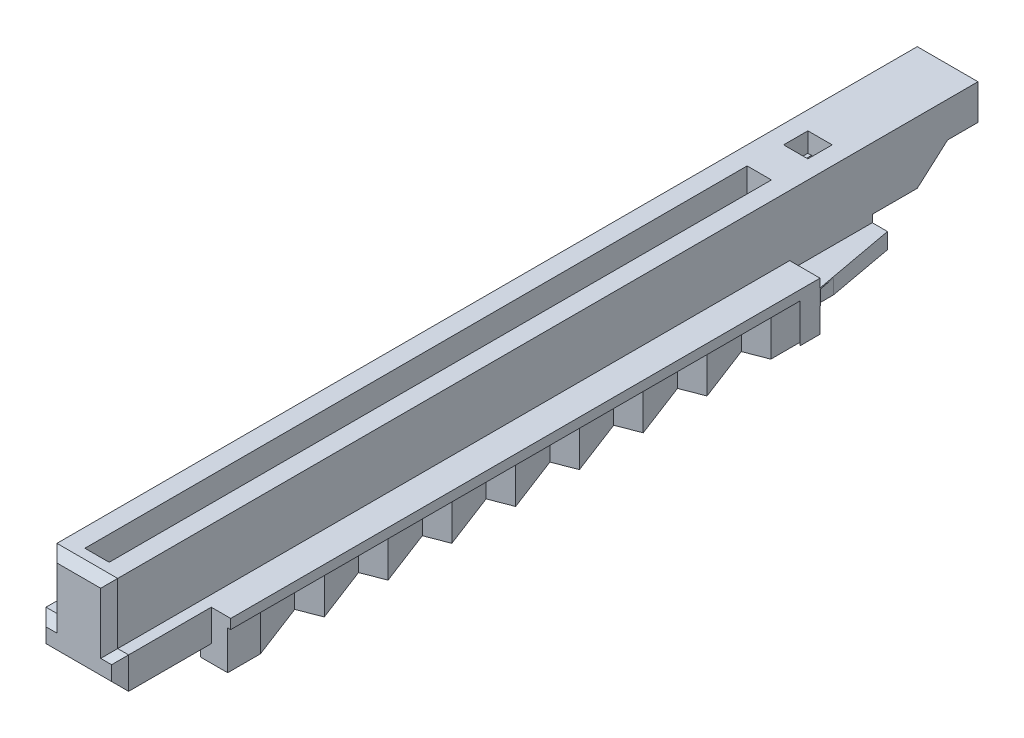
ISO-10303-21;
HEADER;
FILE_DESCRIPTION(('STEP AP214'),'2;1');
FILE_NAME('part.step','',(''),(''),'','','');
FILE_SCHEMA(('AUTOMOTIVE_DESIGN { 1 0 10303 214 1 1 1 1 }'));
ENDSEC;
DATA;
#1=APPLICATION_CONTEXT('core data for automotive mechanical design processes');
#2=APPLICATION_PROTOCOL_DEFINITION('international standard','automotive_design',2000,#1);
#3=PRODUCT_CONTEXT('',#1,'mechanical');
#4=PRODUCT('Part','Part','',(#3));
#5=PRODUCT_RELATED_PRODUCT_CATEGORY('part','',(#4));
#6=PRODUCT_DEFINITION_FORMATION('','',#4);
#7=PRODUCT_DEFINITION_CONTEXT('part definition',#1,'design');
#8=PRODUCT_DEFINITION('design','',#6,#7);
#9=PRODUCT_DEFINITION_SHAPE('','',#8);
#10=(LENGTH_UNIT() NAMED_UNIT(*) SI_UNIT(.MILLI.,.METRE.));
#11=(NAMED_UNIT(*) PLANE_ANGLE_UNIT() SI_UNIT($,.RADIAN.));
#12=(NAMED_UNIT(*) SI_UNIT($,.STERADIAN.) SOLID_ANGLE_UNIT());
#13=UNCERTAINTY_MEASURE_WITH_UNIT(LENGTH_MEASURE(1.E-05),#10,'distance_accuracy_value','');
#14=(GEOMETRIC_REPRESENTATION_CONTEXT(3) GLOBAL_UNCERTAINTY_ASSIGNED_CONTEXT((#13)) GLOBAL_UNIT_ASSIGNED_CONTEXT((#10,
#11,#12)) REPRESENTATION_CONTEXT('',''));
#15=CARTESIAN_POINT('',(0.,0.,0.));
#16=DIRECTION('',(0.,0.,1.));
#17=DIRECTION('',(1.,0.,0.));
#18=AXIS2_PLACEMENT_3D('',#15,#16,#17);
#19=CARTESIAN_POINT('',(4.5,6.,10.45));
#20=DIRECTION('',(0.,1.,0.));
#21=DIRECTION('',(0.,0.,1.));
#22=AXIS2_PLACEMENT_3D('',#19,#20,#21);
#23=PLANE('',#22);
#24=DIRECTION('',(1.,0.,0.));
#25=VECTOR('',#24,1.);
#26=CARTESIAN_POINT('',(3.49999999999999,6.,12.5));
#27=LINE('',#26,#25);
#28=CARTESIAN_POINT('',(1.49999999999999,6.,12.5));
#29=VERTEX_POINT('',#28);
#30=CARTESIAN_POINT('',(3.49999999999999,6.,12.5));
#31=VERTEX_POINT('',#30);
#32=EDGE_CURVE('E794',#29,#31,#27,.T.);
#33=ORIENTED_EDGE('',*,*,#32,.T.);
#34=DIRECTION('',(0.,0.,-1.));
#35=VECTOR('',#34,1.);
#36=CARTESIAN_POINT('',(3.49999999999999,6.,12.5));
#37=LINE('',#36,#35);
#38=CARTESIAN_POINT('',(3.49999999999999,6.,11.85));
#39=VERTEX_POINT('',#38);
#40=EDGE_CURVE('E787',#31,#39,#37,.T.);
#41=ORIENTED_EDGE('',*,*,#40,.T.);
#42=DIRECTION('',(1.,0.,0.));
#43=VECTOR('',#42,1.);
#44=CARTESIAN_POINT('',(4.5,6.,11.85));
#45=LINE('',#44,#43);
#46=CARTESIAN_POINT('',(4.5,6.,11.85));
#47=VERTEX_POINT('',#46);
#48=EDGE_CURVE('E1474',#39,#47,#45,.T.);
#49=ORIENTED_EDGE('',*,*,#48,.T.);
#50=DIRECTION('',(0.,0.,1.));
#51=VECTOR('',#50,1.);
#52=CARTESIAN_POINT('',(4.5,6.,11.85));
#53=LINE('',#52,#51);
#54=CARTESIAN_POINT('',(4.5,6.,13.6));
#55=VERTEX_POINT('',#54);
#56=EDGE_CURVE('E1477',#47,#55,#53,.T.);
#57=ORIENTED_EDGE('',*,*,#56,.T.);
#58=DIRECTION('',(-1.,0.,0.));
#59=VECTOR('',#58,1.);
#60=CARTESIAN_POINT('',(4.5,6.,13.6));
#61=LINE('',#60,#59);
#62=CARTESIAN_POINT('',(0.5,6.,13.6));
#63=VERTEX_POINT('',#62);
#64=EDGE_CURVE('E1480',#55,#63,#61,.T.);
#65=ORIENTED_EDGE('',*,*,#64,.T.);
#66=DIRECTION('',(0.,0.,-1.));
#67=VECTOR('',#66,1.);
#68=CARTESIAN_POINT('',(0.5,6.,11.85));
#69=LINE('',#68,#67);
#70=CARTESIAN_POINT('',(0.5,6.,11.85));
#71=VERTEX_POINT('',#70);
#72=EDGE_CURVE('E1483',#63,#71,#69,.T.);
#73=ORIENTED_EDGE('',*,*,#72,.T.);
#74=DIRECTION('',(1.,0.,0.));
#75=VECTOR('',#74,1.);
#76=CARTESIAN_POINT('',(0.5,6.,11.85));
#77=LINE('',#76,#75);
#78=CARTESIAN_POINT('',(1.49999999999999,6.,11.85));
#79=VERTEX_POINT('',#78);
#80=EDGE_CURVE('E1487',#71,#79,#77,.T.);
#81=ORIENTED_EDGE('',*,*,#80,.T.);
#82=DIRECTION('',(0.,0.,1.));
#83=VECTOR('',#82,1.);
#84=CARTESIAN_POINT('',(1.49999999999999,6.,10.45));
#85=LINE('',#84,#83);
#86=EDGE_CURVE('E11',#79,#29,#85,.T.);
#87=ORIENTED_EDGE('',*,*,#86,.T.);
#88=EDGE_LOOP('',(#33,#41,#49,#57,#65,#73,#81,#87));
#89=FACE_BOUND('',#88,.T.);
#90=ADVANCED_FACE('F29',(#89),#23,.F.);
#91=CARTESIAN_POINT('',(-2.5,-1.4,15.5));
#92=DIRECTION('',(0.,0.,1.));
#93=DIRECTION('',(1.,0.,0.));
#94=AXIS2_PLACEMENT_3D('',#91,#92,#93);
#95=PLANE('',#94);
#96=DIRECTION('',(1.,0.,0.));
#97=VECTOR('',#96,1.);
#98=CARTESIAN_POINT('',(-2.5,-1.4,15.5));
#99=LINE('',#98,#97);
#100=CARTESIAN_POINT('',(7.48991510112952,-1.4,15.5));
#101=VERTEX_POINT('',#100);
#102=CARTESIAN_POINT('',(7.5,-1.4,15.5));
#103=VERTEX_POINT('',#102);
#104=EDGE_CURVE('E1402',#101,#103,#99,.T.);
#105=ORIENTED_EDGE('',*,*,#104,.F.);
#106=DIRECTION('',(0.,1.,0.));
#107=VECTOR('',#106,1.);
#108=CARTESIAN_POINT('',(7.48991510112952,-1.4,15.5));
#109=LINE('',#108,#107);
#110=CARTESIAN_POINT('',(7.48991510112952,0.6,15.5));
#111=VERTEX_POINT('',#110);
#112=EDGE_CURVE('E1133',#101,#111,#109,.T.);
#113=ORIENTED_EDGE('',*,*,#112,.T.);
#114=DIRECTION('',(-1.,0.,0.));
#115=VECTOR('',#114,1.);
#116=CARTESIAN_POINT('',(7.5,0.6,15.5));
#117=LINE('',#116,#115);
#118=CARTESIAN_POINT('',(7.5,0.6,15.5));
#119=VERTEX_POINT('',#118);
#120=EDGE_CURVE('E1164',#119,#111,#117,.T.);
#121=ORIENTED_EDGE('',*,*,#120,.F.);
#122=DIRECTION('',(0.,1.,0.));
#123=VECTOR('',#122,1.);
#124=CARTESIAN_POINT('',(7.5,2.6,15.5));
#125=LINE('',#124,#123);
#126=EDGE_CURVE('E1407',#103,#119,#125,.T.);
#127=ORIENTED_EDGE('',*,*,#126,.F.);
#128=EDGE_LOOP('',(#105,#113,#121,#127));
#129=FACE_BOUND('',#128,.T.);
#130=ADVANCED_FACE('F1774',(#129),#95,.F.);
#131=CARTESIAN_POINT('',(-2.5,-1.4,15.5));
#132=DIRECTION('',(0.,-1.,0.));
#133=DIRECTION('',(1.,0.,0.));
#134=AXIS2_PLACEMENT_3D('',#131,#132,#133);
#135=PLANE('',#134);
#136=DIRECTION('',(0.0061714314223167,0.,0.999980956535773));
#137=VECTOR('',#136,1.);
#138=CARTESIAN_POINT('',(7.5,-1.4,17.1340952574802));
#139=LINE('',#138,#137);
#140=CARTESIAN_POINT('',(7.5,-1.4,17.1340952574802));
#141=VERTEX_POINT('',#140);
#142=EDGE_CURVE('E1014',#101,#141,#139,.T.);
#143=ORIENTED_EDGE('',*,*,#142,.F.);
#144=ORIENTED_EDGE('',*,*,#104,.T.);
#145=DIRECTION('',(0.,0.,1.));
#146=VECTOR('',#145,1.);
#147=CARTESIAN_POINT('',(7.5,-1.4,15.5));
#148=LINE('',#147,#146);
#149=EDGE_CURVE('E1414',#103,#141,#148,.T.);
#150=ORIENTED_EDGE('',*,*,#149,.T.);
#151=EDGE_LOOP('',(#143,#144,#150));
#152=FACE_BOUND('',#151,.T.);
#153=ADVANCED_FACE('F1780',(#152),#135,.T.);
#154=CARTESIAN_POINT('',(7.5,0.6,5.88219943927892));
#155=DIRECTION('',(0.,1.,0.));
#156=DIRECTION('',(0.,0.,1.));
#157=AXIS2_PLACEMENT_3D('',#154,#155,#156);
#158=PLANE('',#157);
#159=ORIENTED_EDGE('',*,*,#120,.T.);
#160=DIRECTION('',(-0.00617143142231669,0.,-0.999980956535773));
#161=VECTOR('',#160,1.);
#162=CARTESIAN_POINT('',(7.43056101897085,0.6,5.88262798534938));
#163=LINE('',#162,#161);
#164=CARTESIAN_POINT('',(7.4895647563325,0.6,15.4432322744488));
#165=VERTEX_POINT('',#164);
#166=EDGE_CURVE('E1130',#111,#165,#163,.T.);
#167=ORIENTED_EDGE('',*,*,#166,.T.);
#168=DIRECTION('',(0.180794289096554,0.,0.983520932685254));
#169=VECTOR('',#168,1.);
#170=CARTESIAN_POINT('',(5.78981110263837,0.6,6.19657239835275));
#171=LINE('',#170,#169);
#172=EDGE_CURVE('E1151',#165,#119,#171,.T.);
#173=ORIENTED_EDGE('',*,*,#172,.T.);
#174=EDGE_LOOP('',(#159,#167,#173));
#175=FACE_BOUND('',#174,.T.);
#176=ADVANCED_FACE('F1854',(#175),#158,.F.);
#177=CARTESIAN_POINT('',(5.,0.,71.5));
#178=DIRECTION('',(-1.,0.,0.));
#179=DIRECTION('',(0.,0.,1.));
#180=AXIS2_PLACEMENT_3D('',#177,#178,#179);
#181=PLANE('',#180);
#182=DIRECTION('',(0.,0.,1.));
#183=VECTOR('',#182,1.);
#184=CARTESIAN_POINT('',(5.,0.6,5.88219943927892));
#185=LINE('',#184,#183);
#186=CARTESIAN_POINT('',(5.,0.6,8.7));
#187=VERTEX_POINT('',#186);
#188=CARTESIAN_POINT('',(5.,0.6,15.5));
#189=VERTEX_POINT('',#188);
#190=EDGE_CURVE('E1167',#187,#189,#185,.T.);
#191=ORIENTED_EDGE('',*,*,#190,.T.);
#192=DIRECTION('',(0.,1.,0.));
#193=VECTOR('',#192,1.);
#194=CARTESIAN_POINT('',(5.,0.,15.5));
#195=LINE('',#194,#193);
#196=CARTESIAN_POINT('',(5.,0.,15.5));
#197=VERTEX_POINT('',#196);
#198=EDGE_CURVE('E1650',#197,#189,#195,.T.);
#199=ORIENTED_EDGE('',*,*,#198,.F.);
#200=DIRECTION('',(0.,0.,-1.));
#201=VECTOR('',#200,1.);
#202=CARTESIAN_POINT('',(5.,0.,71.5));
#203=LINE('',#202,#201);
#204=CARTESIAN_POINT('',(5.,0.,8.7));
#205=VERTEX_POINT('',#204);
#206=EDGE_CURVE('E1637',#197,#205,#203,.T.);
#207=ORIENTED_EDGE('',*,*,#206,.T.);
#208=DIRECTION('',(0.,-1.,0.));
#209=VECTOR('',#208,1.);
#210=CARTESIAN_POINT('',(5.,0.,8.7));
#211=LINE('',#210,#209);
#212=EDGE_CURVE('E1555',#187,#205,#211,.T.);
#213=ORIENTED_EDGE('',*,*,#212,.F.);
#214=EDGE_LOOP('',(#191,#199,#207,#213));
#215=FACE_BOUND('',#214,.T.);
#216=ADVANCED_FACE('F1851',(#215),#181,.F.);
#217=DIRECTION('',(0.,0.,1.));
#218=VECTOR('',#217,1.);
#219=CARTESIAN_POINT('',(5.,1.9,5.88219943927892));
#220=LINE('',#219,#218);
#221=CARTESIAN_POINT('',(5.,1.9,8.7));
#222=VERTEX_POINT('',#221);
#223=CARTESIAN_POINT('',(5.,1.9,15.5));
#224=VERTEX_POINT('',#223);
#225=EDGE_CURVE('E1170',#222,#224,#220,.T.);
#226=ORIENTED_EDGE('',*,*,#225,.F.);
#227=CARTESIAN_POINT('',(5.,2.5,8.7));
#228=VERTEX_POINT('',#227);
#229=EDGE_CURVE('E1556',#228,#222,#211,.T.);
#230=ORIENTED_EDGE('',*,*,#229,.F.);
#231=DIRECTION('',(0.,0.,1.));
#232=VECTOR('',#231,1.);
#233=CARTESIAN_POINT('',(5.,2.5,8.7));
#234=LINE('',#233,#232);
#235=CARTESIAN_POINT('',(5.,2.5,5.));
#236=VERTEX_POINT('',#235);
#237=EDGE_CURVE('E1552',#236,#228,#234,.T.);
#238=ORIENTED_EDGE('',*,*,#237,.F.);
#239=DIRECTION('',(0.,-0.660627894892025,0.750713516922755));
#240=VECTOR('',#239,1.);
#241=CARTESIAN_POINT('',(5.,2.5,5.));
#242=LINE('',#241,#240);
#243=CARTESIAN_POINT('',(5.,4.7,2.5));
#244=VERTEX_POINT('',#243);
#245=EDGE_CURVE('E1549',#244,#236,#242,.T.);
#246=ORIENTED_EDGE('',*,*,#245,.F.);
#247=DIRECTION('',(0.,0.,1.));
#248=VECTOR('',#247,1.);
#249=CARTESIAN_POINT('',(5.,4.7,2.5));
#250=LINE('',#249,#248);
#251=CARTESIAN_POINT('',(5.,4.7,0.));
#252=VERTEX_POINT('',#251);
#253=EDGE_CURVE('E1546',#252,#244,#250,.T.);
#254=ORIENTED_EDGE('',*,*,#253,.F.);
#255=DIRECTION('',(0.,1.,0.));
#256=VECTOR('',#255,1.);
#257=CARTESIAN_POINT('',(5.,0.,0.));
#258=LINE('',#257,#256);
#259=CARTESIAN_POINT('',(5.,7.6,0.));
#260=VERTEX_POINT('',#259);
#261=EDGE_CURVE('E1627',#252,#260,#258,.T.);
#262=ORIENTED_EDGE('',*,*,#261,.T.);
#263=DIRECTION('',(0.,0.,-1.));
#264=VECTOR('',#263,1.);
#265=CARTESIAN_POINT('',(5.,7.6,71.5));
#266=LINE('',#265,#264);
#267=CARTESIAN_POINT('',(5.,7.6,70.8));
#268=VERTEX_POINT('',#267);
#269=EDGE_CURVE('E1635',#268,#260,#266,.T.);
#270=ORIENTED_EDGE('',*,*,#269,.F.);
#271=DIRECTION('',(0.,-1.,0.));
#272=VECTOR('',#271,1.);
#273=CARTESIAN_POINT('',(5.,0.,70.8));
#274=LINE('',#273,#272);
#275=CARTESIAN_POINT('',(5.,2.6,70.8));
#276=VERTEX_POINT('',#275);
#277=EDGE_CURVE('E1678',#268,#276,#274,.T.);
#278=ORIENTED_EDGE('',*,*,#277,.T.);
#279=DIRECTION('',(0.,0.,-1.));
#280=VECTOR('',#279,1.);
#281=CARTESIAN_POINT('',(5.,2.6,71.5));
#282=LINE('',#281,#280);
#283=CARTESIAN_POINT('',(5.,2.6,15.5));
#284=VERTEX_POINT('',#283);
#285=EDGE_CURVE('E1418',#276,#284,#282,.T.);
#286=ORIENTED_EDGE('',*,*,#285,.T.);
#287=EDGE_CURVE('E1649',#224,#284,#195,.T.);
#288=ORIENTED_EDGE('',*,*,#287,.F.);
#289=EDGE_LOOP('',(#226,#230,#238,#246,#254,#262,#270,#278,#286,#288));
#290=FACE_BOUND('',#289,.T.);
#291=ADVANCED_FACE('F1853',(#290),#181,.F.);
#292=CARTESIAN_POINT('',(7.25000000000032,0.6,15.5));
#293=VERTEX_POINT('',#292);
#294=EDGE_CURVE('E1163',#293,#189,#117,.T.);
#295=ORIENTED_EDGE('',*,*,#294,.F.);
#296=DIRECTION('',(0.,-1.,0.));
#297=VECTOR('',#296,1.);
#298=CARTESIAN_POINT('',(7.25000000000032,-1.4,15.5));
#299=LINE('',#298,#297);
#300=CARTESIAN_POINT('',(7.25000000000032,-1.4,15.5));
#301=VERTEX_POINT('',#300);
#302=EDGE_CURVE('E1127',#293,#301,#299,.T.);
#303=ORIENTED_EDGE('',*,*,#302,.T.);
#304=CARTESIAN_POINT('',(5.,-1.4,15.5));
#305=VERTEX_POINT('',#304);
#306=EDGE_CURVE('E1406',#305,#301,#99,.T.);
#307=ORIENTED_EDGE('',*,*,#306,.F.);
#308=DIRECTION('',(0.,-1.,0.));
#309=VECTOR('',#308,1.);
#310=CARTESIAN_POINT('',(5.,0.,15.5));
#311=LINE('',#310,#309);
#312=EDGE_CURVE('E1395',#197,#305,#311,.T.);
#313=ORIENTED_EDGE('',*,*,#312,.F.);
#314=ORIENTED_EDGE('',*,*,#198,.T.);
#315=EDGE_LOOP('',(#295,#303,#307,#313,#314));
#316=FACE_BOUND('',#315,.T.);
#317=ADVANCED_FACE('F1784',(#316),#95,.F.);
#318=DIRECTION('',(1.,0.,0.));
#319=VECTOR('',#318,1.);
#320=CARTESIAN_POINT('',(7.5,1.9,15.5));
#321=LINE('',#320,#319);
#322=CARTESIAN_POINT('',(7.5,1.9,15.5));
#323=VERTEX_POINT('',#322);
#324=EDGE_CURVE('E1156',#224,#323,#321,.T.);
#325=ORIENTED_EDGE('',*,*,#324,.F.);
#326=ORIENTED_EDGE('',*,*,#287,.T.);
#327=DIRECTION('',(-1.,0.,0.));
#328=VECTOR('',#327,1.);
#329=CARTESIAN_POINT('',(-2.5,2.6,15.5));
#330=LINE('',#329,#328);
#331=CARTESIAN_POINT('',(7.5,2.6,15.5));
#332=VERTEX_POINT('',#331);
#333=EDGE_CURVE('E1411',#332,#284,#330,.T.);
#334=ORIENTED_EDGE('',*,*,#333,.F.);
#335=EDGE_CURVE('E1405',#323,#332,#125,.T.);
#336=ORIENTED_EDGE('',*,*,#335,.F.);
#337=EDGE_LOOP('',(#325,#326,#334,#336));
#338=FACE_BOUND('',#337,.T.);
#339=ADVANCED_FACE('F1783',(#338),#95,.F.);
#340=DIRECTION('',(1.,0.,0.));
#341=VECTOR('',#340,1.);
#342=CARTESIAN_POINT('',(0.,1.9,15.5));
#343=LINE('',#342,#341);
#344=CARTESIAN_POINT('',(-2.5,1.9,15.5));
#345=VERTEX_POINT('',#344);
#346=CARTESIAN_POINT('',(0.,1.9,15.5));
#347=VERTEX_POINT('',#346);
#348=EDGE_CURVE('E1180',#345,#347,#343,.T.);
#349=ORIENTED_EDGE('',*,*,#348,.F.);
#350=DIRECTION('',(0.,-1.,0.));
#351=VECTOR('',#350,1.);
#352=CARTESIAN_POINT('',(-2.5,2.6,15.5));
#353=LINE('',#352,#351);
#354=CARTESIAN_POINT('',(-2.5,2.6,15.5));
#355=VERTEX_POINT('',#354);
#356=EDGE_CURVE('E1397',#355,#345,#353,.T.);
#357=ORIENTED_EDGE('',*,*,#356,.F.);
#358=CARTESIAN_POINT('',(0.,2.6,15.5));
#359=VERTEX_POINT('',#358);
#360=EDGE_CURVE('E1410',#359,#355,#330,.T.);
#361=ORIENTED_EDGE('',*,*,#360,.F.);
#362=DIRECTION('',(0.,-1.,0.));
#363=VECTOR('',#362,1.);
#364=CARTESIAN_POINT('',(0.,0.,15.5));
#365=LINE('',#364,#363);
#366=EDGE_CURVE('E1430',#359,#347,#365,.T.);
#367=ORIENTED_EDGE('',*,*,#366,.T.);
#368=EDGE_LOOP('',(#349,#357,#361,#367));
#369=FACE_BOUND('',#368,.T.);
#370=ADVANCED_FACE('F2016',(#369),#95,.F.);
#371=CARTESIAN_POINT('',(-2.24999999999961,-1.4,15.5));
#372=VERTEX_POINT('',#371);
#373=CARTESIAN_POINT('',(0.,-1.4,15.5));
#374=VERTEX_POINT('',#373);
#375=EDGE_CURVE('E1403',#372,#374,#99,.T.);
#376=ORIENTED_EDGE('',*,*,#375,.F.);
#377=DIRECTION('',(0.,1.,0.));
#378=VECTOR('',#377,1.);
#379=CARTESIAN_POINT('',(-2.24999999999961,-1.4,15.5));
#380=LINE('',#379,#378);
#381=CARTESIAN_POINT('',(-2.24999999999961,0.6,15.5));
#382=VERTEX_POINT('',#381);
#383=EDGE_CURVE('E958',#372,#382,#380,.T.);
#384=ORIENTED_EDGE('',*,*,#383,.T.);
#385=DIRECTION('',(-1.,0.,0.));
#386=VECTOR('',#385,1.);
#387=CARTESIAN_POINT('',(0.,0.6,15.5));
#388=LINE('',#387,#386);
#389=CARTESIAN_POINT('',(0.,0.6,15.5));
#390=VERTEX_POINT('',#389);
#391=EDGE_CURVE('E1159',#390,#382,#388,.T.);
#392=ORIENTED_EDGE('',*,*,#391,.F.);
#393=CARTESIAN_POINT('',(0.,0.,15.5));
#394=VERTEX_POINT('',#393);
#395=EDGE_CURVE('E1429',#390,#394,#365,.T.);
#396=ORIENTED_EDGE('',*,*,#395,.T.);
#397=DIRECTION('',(0.,-1.,0.));
#398=VECTOR('',#397,1.);
#399=CARTESIAN_POINT('',(0.,0.,15.5));
#400=LINE('',#399,#398);
#401=EDGE_CURVE('E1394',#394,#374,#400,.T.);
#402=ORIENTED_EDGE('',*,*,#401,.T.);
#403=EDGE_LOOP('',(#376,#384,#392,#396,#402));
#404=FACE_BOUND('',#403,.T.);
#405=ADVANCED_FACE('F1985',(#404),#95,.F.);
#406=CARTESIAN_POINT('',(0.,0.,71.5));
#407=DIRECTION('',(1.,0.,0.));
#408=DIRECTION('',(0.,0.,-1.));
#409=AXIS2_PLACEMENT_3D('',#406,#407,#408);
#410=PLANE('',#409);
#411=DIRECTION('',(0.,0.,1.));
#412=VECTOR('',#411,1.);
#413=CARTESIAN_POINT('',(0.,1.9,5.88219943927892));
#414=LINE('',#413,#412);
#415=CARTESIAN_POINT('',(0.,1.9,8.7));
#416=VERTEX_POINT('',#415);
#417=EDGE_CURVE('E1182',#416,#347,#414,.T.);
#418=ORIENTED_EDGE('',*,*,#417,.T.);
#419=ORIENTED_EDGE('',*,*,#366,.F.);
#420=DIRECTION('',(0.,0.,1.));
#421=VECTOR('',#420,1.);
#422=CARTESIAN_POINT('',(0.,2.6,71.5));
#423=LINE('',#422,#421);
#424=CARTESIAN_POINT('',(0.,2.6,70.8));
#425=VERTEX_POINT('',#424);
#426=EDGE_CURVE('E1426',#359,#425,#423,.T.);
#427=ORIENTED_EDGE('',*,*,#426,.T.);
#428=DIRECTION('',(0.,1.,0.));
#429=VECTOR('',#428,1.);
#430=CARTESIAN_POINT('',(0.,0.,70.8));
#431=LINE('',#430,#429);
#432=CARTESIAN_POINT('',(0.,7.6,70.8));
#433=VERTEX_POINT('',#432);
#434=EDGE_CURVE('E1690',#425,#433,#431,.T.);
#435=ORIENTED_EDGE('',*,*,#434,.T.);
#436=DIRECTION('',(0.,0.,-1.));
#437=VECTOR('',#436,1.);
#438=CARTESIAN_POINT('',(0.,7.6,71.5));
#439=LINE('',#438,#437);
#440=CARTESIAN_POINT('',(0.,7.6,0.));
#441=VERTEX_POINT('',#440);
#442=EDGE_CURVE('E1633',#433,#441,#439,.T.);
#443=ORIENTED_EDGE('',*,*,#442,.T.);
#444=DIRECTION('',(0.,-1.,0.));
#445=VECTOR('',#444,1.);
#446=CARTESIAN_POINT('',(0.,0.,0.));
#447=LINE('',#446,#445);
#448=CARTESIAN_POINT('',(0.,4.7,0.));
#449=VERTEX_POINT('',#448);
#450=EDGE_CURVE('E1618',#441,#449,#447,.T.);
#451=ORIENTED_EDGE('',*,*,#450,.T.);
#452=DIRECTION('',(0.,0.,1.));
#453=VECTOR('',#452,1.);
#454=CARTESIAN_POINT('',(0.,4.7,2.5));
#455=LINE('',#454,#453);
#456=CARTESIAN_POINT('',(0.,4.7,2.5));
#457=VERTEX_POINT('',#456);
#458=EDGE_CURVE('E1559',#449,#457,#455,.T.);
#459=ORIENTED_EDGE('',*,*,#458,.T.);
#460=DIRECTION('',(0.,-0.660627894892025,0.750713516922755));
#461=VECTOR('',#460,1.);
#462=CARTESIAN_POINT('',(0.,2.5,5.));
#463=LINE('',#462,#461);
#464=CARTESIAN_POINT('',(0.,2.5,5.));
#465=VERTEX_POINT('',#464);
#466=EDGE_CURVE('E1562',#457,#465,#463,.T.);
#467=ORIENTED_EDGE('',*,*,#466,.T.);
#468=DIRECTION('',(0.,0.,1.));
#469=VECTOR('',#468,1.);
#470=CARTESIAN_POINT('',(0.,2.5,8.7));
#471=LINE('',#470,#469);
#472=CARTESIAN_POINT('',(0.,2.5,8.7));
#473=VERTEX_POINT('',#472);
#474=EDGE_CURVE('E1565',#465,#473,#471,.T.);
#475=ORIENTED_EDGE('',*,*,#474,.T.);
#476=DIRECTION('',(0.,-1.,0.));
#477=VECTOR('',#476,1.);
#478=CARTESIAN_POINT('',(0.,0.,8.7));
#479=LINE('',#478,#477);
#480=EDGE_CURVE('E1569',#473,#416,#479,.T.);
#481=ORIENTED_EDGE('',*,*,#480,.T.);
#482=EDGE_LOOP('',(#418,#419,#427,#435,#443,#451,#459,#467,#475,#481));
#483=FACE_BOUND('',#482,.T.);
#484=ADVANCED_FACE('F31',(#483),#410,.F.);
#485=DIRECTION('',(0.,0.,1.));
#486=VECTOR('',#485,1.);
#487=CARTESIAN_POINT('',(0.,0.6,5.88219943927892));
#488=LINE('',#487,#486);
#489=CARTESIAN_POINT('',(0.,0.6,8.7));
#490=VERTEX_POINT('',#489);
#491=EDGE_CURVE('E1185',#490,#390,#488,.T.);
#492=ORIENTED_EDGE('',*,*,#491,.F.);
#493=CARTESIAN_POINT('',(0.,0.,8.7));
#494=VERTEX_POINT('',#493);
#495=EDGE_CURVE('E1568',#490,#494,#479,.T.);
#496=ORIENTED_EDGE('',*,*,#495,.T.);
#497=DIRECTION('',(0.,0.,-1.));
#498=VECTOR('',#497,1.);
#499=CARTESIAN_POINT('',(0.,0.,71.5));
#500=LINE('',#499,#498);
#501=EDGE_CURVE('E1640',#394,#494,#500,.T.);
#502=ORIENTED_EDGE('',*,*,#501,.F.);
#503=ORIENTED_EDGE('',*,*,#395,.F.);
#504=EDGE_LOOP('',(#492,#496,#502,#503));
#505=FACE_BOUND('',#504,.T.);
#506=ADVANCED_FACE('F1863',(#505),#410,.F.);
#507=DIRECTION('',(0.,0.,1.));
#508=VECTOR('',#507,1.);
#509=CARTESIAN_POINT('',(-2.25,-1.4,63.4));
#510=LINE('',#509,#508);
#511=CARTESIAN_POINT('',(-2.25,-1.4,63.4));
#512=VERTEX_POINT('',#511);
#513=CARTESIAN_POINT('',(-2.24999999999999,-1.4,64.2));
#514=VERTEX_POINT('',#513);
#515=EDGE_CURVE('E851',#512,#514,#510,.T.);
#516=ORIENTED_EDGE('',*,*,#515,.F.);
#517=DIRECTION('',(-0.934172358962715,0.,0.356822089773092));
#518=VECTOR('',#517,1.);
#519=CARTESIAN_POINT('',(-0.5,-1.4,62.7315594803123));
#520=LINE('',#519,#518);
#521=CARTESIAN_POINT('',(-0.5,-1.4,62.7315594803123));
#522=VERTEX_POINT('',#521);
#523=EDGE_CURVE('E848',#522,#512,#520,.T.);
#524=ORIENTED_EDGE('',*,*,#523,.F.);
#525=DIRECTION('',(0.35682208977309,0.,0.934172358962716));
#526=VECTOR('',#525,1.);
#527=CARTESIAN_POINT('',(-0.5,-1.4,62.7315594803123));
#528=LINE('',#527,#526);
#529=CARTESIAN_POINT('',(-2.25,-1.4,58.15));
#530=VERTEX_POINT('',#529);
#531=EDGE_CURVE('E845',#530,#522,#528,.T.);
#532=ORIENTED_EDGE('',*,*,#531,.F.);
#533=DIRECTION('',(-0.934172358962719,0.,0.356822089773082));
#534=VECTOR('',#533,1.);
#535=CARTESIAN_POINT('',(-0.499999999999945,-1.4,57.4815594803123));
#536=LINE('',#535,#534);
#537=CARTESIAN_POINT('',(-0.499999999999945,-1.4,57.4815594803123));
#538=VERTEX_POINT('',#537);
#539=EDGE_CURVE('E842',#538,#530,#536,.T.);
#540=ORIENTED_EDGE('',*,*,#539,.F.);
#541=DIRECTION('',(0.35682208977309,0.,0.934172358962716));
#542=VECTOR('',#541,1.);
#543=CARTESIAN_POINT('',(-0.499999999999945,-1.4,57.4815594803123));
#544=LINE('',#543,#542);
#545=CARTESIAN_POINT('',(-2.24999999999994,-1.4,52.9));
#546=VERTEX_POINT('',#545);
#547=EDGE_CURVE('E839',#546,#538,#544,.T.);
#548=ORIENTED_EDGE('',*,*,#547,.F.);
#549=DIRECTION('',(-0.934172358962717,0.,0.356822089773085));
#550=VECTOR('',#549,1.);
#551=CARTESIAN_POINT('',(-0.49999999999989,-1.4,52.2315594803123));
#552=LINE('',#551,#550);
#553=CARTESIAN_POINT('',(-0.49999999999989,-1.4,52.2315594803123));
#554=VERTEX_POINT('',#553);
#555=EDGE_CURVE('E836',#554,#546,#552,.T.);
#556=ORIENTED_EDGE('',*,*,#555,.F.);
#557=DIRECTION('',(0.35682208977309,0.,0.934172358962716));
#558=VECTOR('',#557,1.);
#559=CARTESIAN_POINT('',(-0.49999999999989,-1.4,52.2315594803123));
#560=LINE('',#559,#558);
#561=CARTESIAN_POINT('',(-2.24999999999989,-1.4,47.65));
#562=VERTEX_POINT('',#561);
#563=EDGE_CURVE('E833',#562,#554,#560,.T.);
#564=ORIENTED_EDGE('',*,*,#563,.F.);
#565=DIRECTION('',(-0.934172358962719,0.,0.356822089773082));
#566=VECTOR('',#565,1.);
#567=CARTESIAN_POINT('',(-0.499999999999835,-1.4,46.9815594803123));
#568=LINE('',#567,#566);
#569=CARTESIAN_POINT('',(-0.499999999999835,-1.4,46.9815594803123));
#570=VERTEX_POINT('',#569);
#571=EDGE_CURVE('E830',#570,#562,#568,.T.);
#572=ORIENTED_EDGE('',*,*,#571,.F.);
#573=DIRECTION('',(0.35682208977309,0.,0.934172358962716));
#574=VECTOR('',#573,1.);
#575=CARTESIAN_POINT('',(-0.499999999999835,-1.4,46.9815594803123));
#576=LINE('',#575,#574);
#577=CARTESIAN_POINT('',(-2.24999999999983,-1.4,42.4));
#578=VERTEX_POINT('',#577);
#579=EDGE_CURVE('E827',#578,#570,#576,.T.);
#580=ORIENTED_EDGE('',*,*,#579,.F.);
#581=DIRECTION('',(-0.934172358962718,0.,0.356822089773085));
#582=VECTOR('',#581,1.);
#583=CARTESIAN_POINT('',(-0.49999999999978,-1.4,41.7315594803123));
#584=LINE('',#583,#582);
#585=CARTESIAN_POINT('',(-0.49999999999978,-1.4,41.7315594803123));
#586=VERTEX_POINT('',#585);
#587=EDGE_CURVE('E824',#586,#578,#584,.T.);
#588=ORIENTED_EDGE('',*,*,#587,.F.);
#589=DIRECTION('',(0.356822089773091,0.,0.934172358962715));
#590=VECTOR('',#589,1.);
#591=CARTESIAN_POINT('',(-0.49999999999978,-1.4,41.7315594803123));
#592=LINE('',#591,#590);
#593=CARTESIAN_POINT('',(-2.24999999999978,-1.4,37.15));
#594=VERTEX_POINT('',#593);
#595=EDGE_CURVE('E821',#594,#586,#592,.T.);
#596=ORIENTED_EDGE('',*,*,#595,.F.);
#597=DIRECTION('',(-0.934172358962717,0.,0.356822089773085));
#598=VECTOR('',#597,1.);
#599=CARTESIAN_POINT('',(-0.499999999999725,-1.4,36.4815594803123));
#600=LINE('',#599,#598);
#601=CARTESIAN_POINT('',(-0.499999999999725,-1.4,36.4815594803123));
#602=VERTEX_POINT('',#601);
#603=EDGE_CURVE('E818',#602,#594,#600,.T.);
#604=ORIENTED_EDGE('',*,*,#603,.F.);
#605=DIRECTION('',(0.35682208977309,0.,0.934172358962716));
#606=VECTOR('',#605,1.);
#607=CARTESIAN_POINT('',(-0.499999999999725,-1.4,36.4815594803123));
#608=LINE('',#607,#606);
#609=CARTESIAN_POINT('',(-2.24999999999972,-1.4,31.9));
#610=VERTEX_POINT('',#609);
#611=EDGE_CURVE('E815',#610,#602,#608,.T.);
#612=ORIENTED_EDGE('',*,*,#611,.F.);
#613=DIRECTION('',(-0.934172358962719,0.,0.356822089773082));
#614=VECTOR('',#613,1.);
#615=CARTESIAN_POINT('',(-0.49999999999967,-1.4,31.2315594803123));
#616=LINE('',#615,#614);
#617=CARTESIAN_POINT('',(-0.49999999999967,-1.4,31.2315594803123));
#618=VERTEX_POINT('',#617);
#619=EDGE_CURVE('E812',#618,#610,#616,.T.);
#620=ORIENTED_EDGE('',*,*,#619,.F.);
#621=DIRECTION('',(0.35682208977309,0.,0.934172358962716));
#622=VECTOR('',#621,1.);
#623=CARTESIAN_POINT('',(-0.49999999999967,-1.4,31.2315594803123));
#624=LINE('',#623,#622);
#625=CARTESIAN_POINT('',(-2.24999999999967,-1.4,26.65));
#626=VERTEX_POINT('',#625);
#627=EDGE_CURVE('E809',#626,#618,#624,.T.);
#628=ORIENTED_EDGE('',*,*,#627,.F.);
#629=DIRECTION('',(-0.934172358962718,0.,0.356822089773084));
#630=VECTOR('',#629,1.);
#631=CARTESIAN_POINT('',(-0.499999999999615,-1.4,25.9815594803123));
#632=LINE('',#631,#630);
#633=CARTESIAN_POINT('',(-0.499999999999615,-1.4,25.9815594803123));
#634=VERTEX_POINT('',#633);
#635=EDGE_CURVE('E806',#634,#626,#632,.T.);
#636=ORIENTED_EDGE('',*,*,#635,.F.);
#637=DIRECTION('',(0.35682208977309,0.,0.934172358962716));
#638=VECTOR('',#637,1.);
#639=CARTESIAN_POINT('',(-0.499999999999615,-1.4,25.9815594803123));
#640=LINE('',#639,#638);
#641=CARTESIAN_POINT('',(-2.24999999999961,-1.4,21.4));
#642=VERTEX_POINT('',#641);
#643=EDGE_CURVE('E803',#642,#634,#640,.T.);
#644=ORIENTED_EDGE('',*,*,#643,.F.);
#645=DIRECTION('',(0.,0.,1.));
#646=VECTOR('',#645,1.);
#647=CARTESIAN_POINT('',(-2.24999999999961,-1.4,21.4));
#648=LINE('',#647,#646);
#649=EDGE_CURVE('E799',#372,#642,#648,.T.);
#650=ORIENTED_EDGE('',*,*,#649,.F.);
#651=ORIENTED_EDGE('',*,*,#375,.T.);
#652=DIRECTION('',(0.,0.,-1.));
#653=VECTOR('',#652,1.);
#654=CARTESIAN_POINT('',(0.,-1.4,71.5));
#655=LINE('',#654,#653);
#656=CARTESIAN_POINT('',(0.,-1.4,66.5));
#657=VERTEX_POINT('',#656);
#658=EDGE_CURVE('E1352',#657,#374,#655,.T.);
#659=ORIENTED_EDGE('',*,*,#658,.F.);
#660=DIRECTION('',(1.,0.,0.));
#661=VECTOR('',#660,1.);
#662=CARTESIAN_POINT('',(-0.899999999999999,-1.4,66.5));
#663=LINE('',#662,#661);
#664=CARTESIAN_POINT('',(-0.899999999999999,-1.4,66.5));
#665=VERTEX_POINT('',#664);
#666=EDGE_CURVE('E1218',#665,#657,#663,.T.);
#667=ORIENTED_EDGE('',*,*,#666,.F.);
#668=DIRECTION('',(0.,0.,1.));
#669=VECTOR('',#668,1.);
#670=CARTESIAN_POINT('',(-0.899999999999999,-1.4,71.5));
#671=LINE('',#670,#669);
#672=CARTESIAN_POINT('',(-0.899999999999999,-1.4,64.2));
#673=VERTEX_POINT('',#672);
#674=EDGE_CURVE('E1232',#673,#665,#671,.T.);
#675=ORIENTED_EDGE('',*,*,#674,.F.);
#676=DIRECTION('',(1.,0.,0.));
#677=VECTOR('',#676,1.);
#678=CARTESIAN_POINT('',(-2.5,-1.4,64.2));
#679=LINE('',#678,#677);
#680=EDGE_CURVE('E1230',#514,#673,#679,.T.);
#681=ORIENTED_EDGE('',*,*,#680,.F.);
#682=EDGE_LOOP('',(#516,#524,#532,#540,#548,#556,#564,#572,#580,#588,#596,#604,#612,#620,#628,
#636,#644,#650,#651,#659,#667,#675,#681));
#683=FACE_BOUND('',#682,.T.);
#684=ADVANCED_FACE('F1857',(#683),#135,.T.);
#685=CARTESIAN_POINT('',(0.,0.,71.5));
#686=DIRECTION('',(0.,1.,0.));
#687=DIRECTION('',(0.,0.,1.));
#688=AXIS2_PLACEMENT_3D('',#685,#686,#687);
#689=PLANE('',#688);
#690=DIRECTION('',(-1.,0.,0.));
#691=VECTOR('',#690,1.);
#692=CARTESIAN_POINT('',(3.5,0.,69.75));
#693=LINE('',#692,#691);
#694=CARTESIAN_POINT('',(3.5,0.,69.75));
#695=VERTEX_POINT('',#694);
#696=CARTESIAN_POINT('',(1.5,0.,69.75));
#697=VERTEX_POINT('',#696);
#698=EDGE_CURVE('E1256',#695,#697,#693,.T.);
#699=ORIENTED_EDGE('',*,*,#698,.F.);
#700=DIRECTION('',(0.,0.,1.));
#701=VECTOR('',#700,1.);
#702=CARTESIAN_POINT('',(3.5,0.,69.75));
#703=LINE('',#702,#701);
#704=CARTESIAN_POINT('',(3.5,0.,66.8680339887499));
#705=VERTEX_POINT('',#704);
#706=EDGE_CURVE('E1254',#705,#695,#703,.T.);
#707=ORIENTED_EDGE('',*,*,#706,.F.);
#708=CARTESIAN_POINT('',(2.5,0.,65.75));
#709=DIRECTION('',(0.,-1.,0.));
#710=DIRECTION('',(0.,0.,-1.));
#711=AXIS2_PLACEMENT_3D('',#708,#709,#710);
#712=CIRCLE('',#711,1.5);
#713=CARTESIAN_POINT('',(3.5,0.,64.6319660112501));
#714=VERTEX_POINT('',#713);
#715=EDGE_CURVE('E1298',#714,#705,#712,.T.);
#716=ORIENTED_EDGE('',*,*,#715,.F.);
#717=DIRECTION('',(0.,0.,1.));
#718=VECTOR('',#717,1.);
#719=CARTESIAN_POINT('',(3.5,0.,64.6319660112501));
#720=LINE('',#719,#718);
#721=CARTESIAN_POINT('',(3.5,0.,43.8680339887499));
#722=VERTEX_POINT('',#721);
#723=EDGE_CURVE('E1295',#722,#714,#720,.T.);
#724=ORIENTED_EDGE('',*,*,#723,.F.);
#725=CARTESIAN_POINT('',(2.5,0.,42.75));
#726=DIRECTION('',(0.,-1.,0.));
#727=DIRECTION('',(0.,0.,-1.));
#728=AXIS2_PLACEMENT_3D('',#725,#726,#727);
#729=CIRCLE('',#728,1.5);
#730=CARTESIAN_POINT('',(3.5,0.,41.6319660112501));
#731=VERTEX_POINT('',#730);
#732=EDGE_CURVE('E1292',#731,#722,#729,.T.);
#733=ORIENTED_EDGE('',*,*,#732,.F.);
#734=DIRECTION('',(0.,0.,1.));
#735=VECTOR('',#734,1.);
#736=CARTESIAN_POINT('',(3.5,0.,41.6319660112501));
#737=LINE('',#736,#735);
#738=CARTESIAN_POINT('',(3.50000000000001,0.,20.8680339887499));
#739=VERTEX_POINT('',#738);
#740=EDGE_CURVE('E1289',#739,#731,#737,.T.);
#741=ORIENTED_EDGE('',*,*,#740,.F.);
#742=CARTESIAN_POINT('',(2.5,0.,19.75));
#743=DIRECTION('',(0.,-1.,0.));
#744=DIRECTION('',(0.,0.,-1.));
#745=AXIS2_PLACEMENT_3D('',#742,#743,#744);
#746=CIRCLE('',#745,1.5);
#747=CARTESIAN_POINT('',(3.50000000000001,0.,18.6319660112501));
#748=VERTEX_POINT('',#747);
#749=EDGE_CURVE('E1286',#748,#739,#746,.T.);
#750=ORIENTED_EDGE('',*,*,#749,.F.);
#751=DIRECTION('',(0.,0.,1.));
#752=VECTOR('',#751,1.);
#753=CARTESIAN_POINT('',(3.50000000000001,0.,18.6319660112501));
#754=LINE('',#753,#752);
#755=CARTESIAN_POINT('',(3.50000000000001,0.,15.75));
#756=VERTEX_POINT('',#755);
#757=EDGE_CURVE('E1283',#756,#748,#754,.T.);
#758=ORIENTED_EDGE('',*,*,#757,.F.);
#759=DIRECTION('',(1.,0.,0.));
#760=VECTOR('',#759,1.);
#761=CARTESIAN_POINT('',(3.50000000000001,0.,15.75));
#762=LINE('',#761,#760);
#763=CARTESIAN_POINT('',(1.50000000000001,0.,15.75));
#764=VERTEX_POINT('',#763);
#765=EDGE_CURVE('E1280',#764,#756,#762,.T.);
#766=ORIENTED_EDGE('',*,*,#765,.F.);
#767=DIRECTION('',(0.,0.,-1.));
#768=VECTOR('',#767,1.);
#769=CARTESIAN_POINT('',(1.50000000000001,0.,18.6319660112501));
#770=LINE('',#769,#768);
#771=CARTESIAN_POINT('',(1.50000000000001,0.,18.6319660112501));
#772=VERTEX_POINT('',#771);
#773=EDGE_CURVE('E1277',#772,#764,#770,.T.);
#774=ORIENTED_EDGE('',*,*,#773,.F.);
#775=CARTESIAN_POINT('',(2.5,0.,19.75));
#776=DIRECTION('',(0.,-1.,0.));
#777=DIRECTION('',(0.,0.,-1.));
#778=AXIS2_PLACEMENT_3D('',#775,#776,#777);
#779=CIRCLE('',#778,1.5);
#780=CARTESIAN_POINT('',(1.50000000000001,0.,20.8680339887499));
#781=VERTEX_POINT('',#780);
#782=EDGE_CURVE('E1274',#781,#772,#779,.T.);
#783=ORIENTED_EDGE('',*,*,#782,.F.);
#784=DIRECTION('',(0.,0.,-1.));
#785=VECTOR('',#784,1.);
#786=CARTESIAN_POINT('',(1.5,0.,41.6319660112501));
#787=LINE('',#786,#785);
#788=CARTESIAN_POINT('',(1.5,0.,41.6319660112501));
#789=VERTEX_POINT('',#788);
#790=EDGE_CURVE('E1271',#789,#781,#787,.T.);
#791=ORIENTED_EDGE('',*,*,#790,.F.);
#792=CARTESIAN_POINT('',(2.5,0.,42.75));
#793=DIRECTION('',(0.,-1.,0.));
#794=DIRECTION('',(0.,0.,-1.));
#795=AXIS2_PLACEMENT_3D('',#792,#793,#794);
#796=CIRCLE('',#795,1.5);
#797=CARTESIAN_POINT('',(1.5,0.,43.8680339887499));
#798=VERTEX_POINT('',#797);
#799=EDGE_CURVE('E1268',#798,#789,#796,.T.);
#800=ORIENTED_EDGE('',*,*,#799,.F.);
#801=DIRECTION('',(0.,0.,-1.));
#802=VECTOR('',#801,1.);
#803=CARTESIAN_POINT('',(1.5,0.,64.6319660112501));
#804=LINE('',#803,#802);
#805=CARTESIAN_POINT('',(1.5,0.,64.6319660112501));
#806=VERTEX_POINT('',#805);
#807=EDGE_CURVE('E1265',#806,#798,#804,.T.);
#808=ORIENTED_EDGE('',*,*,#807,.F.);
#809=CARTESIAN_POINT('',(2.5,0.,65.75));
#810=DIRECTION('',(0.,-1.,0.));
#811=DIRECTION('',(0.,0.,-1.));
#812=AXIS2_PLACEMENT_3D('',#809,#810,#811);
#813=CIRCLE('',#812,1.5);
#814=CARTESIAN_POINT('',(1.5,0.,66.8680339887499));
#815=VERTEX_POINT('',#814);
#816=EDGE_CURVE('E1262',#815,#806,#813,.T.);
#817=ORIENTED_EDGE('',*,*,#816,.F.);
#818=DIRECTION('',(0.,0.,-1.));
#819=VECTOR('',#818,1.);
#820=CARTESIAN_POINT('',(1.5,0.,69.75));
#821=LINE('',#820,#819);
#822=EDGE_CURVE('E1259',#697,#815,#821,.T.);
#823=ORIENTED_EDGE('',*,*,#822,.F.);
#824=EDGE_LOOP('',(#699,#707,#716,#724,#733,#741,#750,#758,#766,#774,#783,#791,#800,#808,#817,#823));
#825=FACE_BOUND('',#824,.T.);
#826=DIRECTION('',(0.,0.,1.));
#827=VECTOR('',#826,1.);
#828=CARTESIAN_POINT('',(5.9,0.,71.5));
#829=LINE('',#828,#827);
#830=CARTESIAN_POINT('',(5.9,0.,64.));
#831=VERTEX_POINT('',#830);
#832=CARTESIAN_POINT('',(5.9,0.,70.8));
#833=VERTEX_POINT('',#832);
#834=EDGE_CURVE('E1212',#831,#833,#829,.T.);
#835=ORIENTED_EDGE('',*,*,#834,.T.);
#836=DIRECTION('',(-1.,0.,0.));
#837=VECTOR('',#836,1.);
#838=CARTESIAN_POINT('',(0.,0.,70.8));
#839=LINE('',#838,#837);
#840=CARTESIAN_POINT('',(-0.899999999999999,0.,70.8));
#841=VERTEX_POINT('',#840);
#842=EDGE_CURVE('E1684',#833,#841,#839,.T.);
#843=ORIENTED_EDGE('',*,*,#842,.T.);
#844=DIRECTION('',(0.,0.,-1.));
#845=VECTOR('',#844,1.);
#846=CARTESIAN_POINT('',(-0.899999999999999,0.,71.5));
#847=LINE('',#846,#845);
#848=CARTESIAN_POINT('',(-0.899999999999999,0.,66.5));
#849=VERTEX_POINT('',#848);
#850=EDGE_CURVE('E1224',#841,#849,#847,.T.);
#851=ORIENTED_EDGE('',*,*,#850,.T.);
#852=DIRECTION('',(1.,0.,0.));
#853=VECTOR('',#852,1.);
#854=CARTESIAN_POINT('',(-0.899999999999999,0.,66.5));
#855=LINE('',#854,#853);
#856=CARTESIAN_POINT('',(0.,0.,66.5));
#857=VERTEX_POINT('',#856);
#858=EDGE_CURVE('E1220',#849,#857,#855,.T.);
#859=ORIENTED_EDGE('',*,*,#858,.T.);
#860=DIRECTION('',(0.,0.,-1.));
#861=VECTOR('',#860,1.);
#862=CARTESIAN_POINT('',(0.,0.,71.5));
#863=LINE('',#862,#861);
#864=EDGE_CURVE('E1388',#857,#394,#863,.T.);
#865=ORIENTED_EDGE('',*,*,#864,.T.);
#866=ORIENTED_EDGE('',*,*,#501,.T.);
#867=DIRECTION('',(1.,0.,0.));
#868=VECTOR('',#867,1.);
#869=CARTESIAN_POINT('',(0.,0.,8.7));
#870=LINE('',#869,#868);
#871=CARTESIAN_POINT('',(0.5,0.,8.7));
#872=VERTEX_POINT('',#871);
#873=EDGE_CURVE('E1573',#494,#872,#870,.T.);
#874=ORIENTED_EDGE('',*,*,#873,.T.);
#875=DIRECTION('',(0.,0.,-1.));
#876=VECTOR('',#875,1.);
#877=CARTESIAN_POINT('',(0.5,0.,0.));
#878=LINE('',#877,#876);
#879=CARTESIAN_POINT('',(0.5,0.,10.45));
#880=VERTEX_POINT('',#879);
#881=EDGE_CURVE('E1462',#880,#872,#878,.T.);
#882=ORIENTED_EDGE('',*,*,#881,.F.);
#883=DIRECTION('',(-1.,0.,0.));
#884=VECTOR('',#883,1.);
#885=CARTESIAN_POINT('',(1.8,0.,10.45));
#886=LINE('',#885,#884);
#887=CARTESIAN_POINT('',(1.8,0.,10.45));
#888=VERTEX_POINT('',#887);
#889=EDGE_CURVE('E1459',#888,#880,#886,.T.);
#890=ORIENTED_EDGE('',*,*,#889,.F.);
#891=DIRECTION('',(0.,0.,-1.));
#892=VECTOR('',#891,1.);
#893=CARTESIAN_POINT('',(1.8,0.,11.85));
#894=LINE('',#893,#892);
#895=CARTESIAN_POINT('',(1.8,0.,11.85));
#896=VERTEX_POINT('',#895);
#897=EDGE_CURVE('E1456',#896,#888,#894,.T.);
#898=ORIENTED_EDGE('',*,*,#897,.F.);
#899=DIRECTION('',(1.,0.,0.));
#900=VECTOR('',#899,1.);
#901=CARTESIAN_POINT('',(0.5,0.,11.85));
#902=LINE('',#901,#900);
#903=CARTESIAN_POINT('',(0.5,0.,11.85));
#904=VERTEX_POINT('',#903);
#905=EDGE_CURVE('E1453',#904,#896,#902,.T.);
#906=ORIENTED_EDGE('',*,*,#905,.F.);
#907=DIRECTION('',(0.,0.,-1.));
#908=VECTOR('',#907,1.);
#909=CARTESIAN_POINT('',(0.5,0.,11.85));
#910=LINE('',#909,#908);
#911=CARTESIAN_POINT('',(0.5,0.,13.6));
#912=VERTEX_POINT('',#911);
#913=EDGE_CURVE('E1450',#912,#904,#910,.T.);
#914=ORIENTED_EDGE('',*,*,#913,.F.);
#915=DIRECTION('',(-1.,0.,0.));
#916=VECTOR('',#915,1.);
#917=CARTESIAN_POINT('',(4.5,0.,13.6));
#918=LINE('',#917,#916);
#919=CARTESIAN_POINT('',(4.5,0.,13.6));
#920=VERTEX_POINT('',#919);
#921=EDGE_CURVE('E1447',#920,#912,#918,.T.);
#922=ORIENTED_EDGE('',*,*,#921,.F.);
#923=DIRECTION('',(0.,0.,1.));
#924=VECTOR('',#923,1.);
#925=CARTESIAN_POINT('',(4.5,0.,11.85));
#926=LINE('',#925,#924);
#927=CARTESIAN_POINT('',(4.5,0.,11.85));
#928=VERTEX_POINT('',#927);
#929=EDGE_CURVE('E1444',#928,#920,#926,.T.);
#930=ORIENTED_EDGE('',*,*,#929,.F.);
#931=DIRECTION('',(1.,0.,0.));
#932=VECTOR('',#931,1.);
#933=CARTESIAN_POINT('',(4.5,0.,11.85));
#934=LINE('',#933,#932);
#935=CARTESIAN_POINT('',(3.2,0.,11.85));
#936=VERTEX_POINT('',#935);
#937=EDGE_CURVE('E1441',#936,#928,#934,.T.);
#938=ORIENTED_EDGE('',*,*,#937,.F.);
#939=DIRECTION('',(0.,0.,1.));
#940=VECTOR('',#939,1.);
#941=CARTESIAN_POINT('',(3.2,0.,11.85));
#942=LINE('',#941,#940);
#943=CARTESIAN_POINT('',(3.2,0.,10.45));
#944=VERTEX_POINT('',#943);
#945=EDGE_CURVE('E1438',#944,#936,#942,.T.);
#946=ORIENTED_EDGE('',*,*,#945,.F.);
#947=DIRECTION('',(-1.,0.,0.));
#948=VECTOR('',#947,1.);
#949=CARTESIAN_POINT('',(3.2,0.,10.45));
#950=LINE('',#949,#948);
#951=CARTESIAN_POINT('',(4.5,0.,10.45));
#952=VERTEX_POINT('',#951);
#953=EDGE_CURVE('E1435',#952,#944,#950,.T.);
#954=ORIENTED_EDGE('',*,*,#953,.F.);
#955=DIRECTION('',(0.,0.,1.));
#956=VECTOR('',#955,1.);
#957=CARTESIAN_POINT('',(4.5,0.,0.));
#958=LINE('',#957,#956);
#959=CARTESIAN_POINT('',(4.5,0.,8.7));
#960=VERTEX_POINT('',#959);
#961=EDGE_CURVE('E1433',#960,#952,#958,.T.);
#962=ORIENTED_EDGE('',*,*,#961,.F.);
#963=EDGE_CURVE('E1577',#960,#205,#870,.T.);
#964=ORIENTED_EDGE('',*,*,#963,.T.);
#965=ORIENTED_EDGE('',*,*,#206,.F.);
#966=DIRECTION('',(0.,0.,1.));
#967=VECTOR('',#966,1.);
#968=CARTESIAN_POINT('',(4.99999999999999,0.,71.5));
#969=LINE('',#968,#967);
#970=CARTESIAN_POINT('',(4.99999999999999,0.,64.));
#971=VERTEX_POINT('',#970);
#972=EDGE_CURVE('E1391',#197,#971,#969,.T.);
#973=ORIENTED_EDGE('',*,*,#972,.T.);
#974=DIRECTION('',(1.,0.,0.));
#975=VECTOR('',#974,1.);
#976=CARTESIAN_POINT('',(4.99999999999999,0.,64.));
#977=LINE('',#976,#975);
#978=EDGE_CURVE('E1210',#971,#831,#977,.T.);
#979=ORIENTED_EDGE('',*,*,#978,.T.);
#980=EDGE_LOOP('',(#835,#843,#851,#859,#865,#866,#874,#882,#890,#898,#906,#914,#922,#930,#938,
#946,#954,#962,#964,#965,#973,#979));
#981=FACE_BOUND('',#980,.T.);
#982=ADVANCED_FACE('F1743',(#825,#981),#689,.F.);
#983=CARTESIAN_POINT('',(0.,0.,8.7));
#984=DIRECTION('',(0.,0.,1.));
#985=DIRECTION('',(1.,0.,0.));
#986=AXIS2_PLACEMENT_3D('',#983,#984,#985);
#987=PLANE('',#986);
#988=DIRECTION('',(-1.,0.,0.));
#989=VECTOR('',#988,1.);
#990=CARTESIAN_POINT('',(7.5,1.9,8.7));
#991=LINE('',#990,#989);
#992=CARTESIAN_POINT('',(6.25,1.9,8.7));
#993=VERTEX_POINT('',#992);
#994=EDGE_CURVE('E1157',#993,#222,#991,.T.);
#995=ORIENTED_EDGE('',*,*,#994,.F.);
#996=DIRECTION('',(0.,1.,0.));
#997=VECTOR('',#996,1.);
#998=CARTESIAN_POINT('',(6.25,-1.4,8.7));
#999=LINE('',#998,#997);
#1000=CARTESIAN_POINT('',(6.25,0.6,8.7));
#1001=VERTEX_POINT('',#1000);
#1002=EDGE_CURVE('E1147',#1001,#993,#999,.T.);
#1003=ORIENTED_EDGE('',*,*,#1002,.F.);
#1004=DIRECTION('',(1.,0.,0.));
#1005=VECTOR('',#1004,1.);
#1006=CARTESIAN_POINT('',(7.5,0.6,8.7));
#1007=LINE('',#1006,#1005);
#1008=EDGE_CURVE('E1160',#187,#1001,#1007,.T.);
#1009=ORIENTED_EDGE('',*,*,#1008,.F.);
#1010=ORIENTED_EDGE('',*,*,#212,.T.);
#1011=ORIENTED_EDGE('',*,*,#963,.F.);
#1012=DIRECTION('',(0.,1.,0.));
#1013=VECTOR('',#1012,1.);
#1014=CARTESIAN_POINT('',(4.5,0.,8.7));
#1015=LINE('',#1014,#1013);
#1016=CARTESIAN_POINT('',(4.5,2.5,8.7));
#1017=VERTEX_POINT('',#1016);
#1018=EDGE_CURVE('E1543',#960,#1017,#1015,.T.);
#1019=ORIENTED_EDGE('',*,*,#1018,.T.);
#1020=DIRECTION('',(1.,0.,0.));
#1021=VECTOR('',#1020,1.);
#1022=CARTESIAN_POINT('',(0.,2.5,8.7));
#1023=LINE('',#1022,#1021);
#1024=EDGE_CURVE('E1581',#1017,#228,#1023,.T.);
#1025=ORIENTED_EDGE('',*,*,#1024,.T.);
#1026=ORIENTED_EDGE('',*,*,#229,.T.);
#1027=EDGE_LOOP('',(#995,#1003,#1009,#1010,#1011,#1019,#1025,#1026));
#1028=FACE_BOUND('',#1027,.T.);
#1029=ADVANCED_FACE('F1737',(#1028),#987,.F.);
#1030=CARTESIAN_POINT('',(0.,2.5,8.7));
#1031=DIRECTION('',(0.,1.,0.));
#1032=DIRECTION('',(0.,0.,1.));
#1033=AXIS2_PLACEMENT_3D('',#1030,#1031,#1032);
#1034=PLANE('',#1033);
#1035=ORIENTED_EDGE('',*,*,#1024,.F.);
#1036=DIRECTION('',(0.,0.,-1.));
#1037=VECTOR('',#1036,1.);
#1038=CARTESIAN_POINT('',(4.5,2.5,8.7));
#1039=LINE('',#1038,#1037);
#1040=CARTESIAN_POINT('',(4.5,2.5,5.));
#1041=VERTEX_POINT('',#1040);
#1042=EDGE_CURVE('E1540',#1017,#1041,#1039,.T.);
#1043=ORIENTED_EDGE('',*,*,#1042,.T.);
#1044=DIRECTION('',(1.,0.,0.));
#1045=VECTOR('',#1044,1.);
#1046=CARTESIAN_POINT('',(0.,2.5,5.));
#1047=LINE('',#1046,#1045);
#1048=EDGE_CURVE('E1585',#1041,#236,#1047,.T.);
#1049=ORIENTED_EDGE('',*,*,#1048,.T.);
#1050=ORIENTED_EDGE('',*,*,#237,.T.);
#1051=EDGE_LOOP('',(#1035,#1043,#1049,#1050));
#1052=FACE_BOUND('',#1051,.T.);
#1053=ADVANCED_FACE('F1733',(#1052),#1034,.F.);
#1054=CARTESIAN_POINT('',(0.,2.5,5.));
#1055=DIRECTION('',(0.,0.750713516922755,0.660627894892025));
#1056=DIRECTION('',(0.,-0.660627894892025,0.750713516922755));
#1057=AXIS2_PLACEMENT_3D('',#1054,#1055,#1056);
#1058=PLANE('',#1057);
#1059=ORIENTED_EDGE('',*,*,#1048,.F.);
#1060=DIRECTION('',(0.,0.660627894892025,-0.750713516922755));
#1061=VECTOR('',#1060,1.);
#1062=CARTESIAN_POINT('',(4.5,2.5,5.));
#1063=LINE('',#1062,#1061);
#1064=CARTESIAN_POINT('',(4.5,4.7,2.5));
#1065=VERTEX_POINT('',#1064);
#1066=EDGE_CURVE('E1537',#1041,#1065,#1063,.T.);
#1067=ORIENTED_EDGE('',*,*,#1066,.T.);
#1068=DIRECTION('',(1.,0.,0.));
#1069=VECTOR('',#1068,1.);
#1070=CARTESIAN_POINT('',(0.,4.7,2.5));
#1071=LINE('',#1070,#1069);
#1072=EDGE_CURVE('E1589',#1065,#244,#1071,.T.);
#1073=ORIENTED_EDGE('',*,*,#1072,.T.);
#1074=ORIENTED_EDGE('',*,*,#245,.T.);
#1075=EDGE_LOOP('',(#1059,#1067,#1073,#1074));
#1076=FACE_BOUND('',#1075,.T.);
#1077=ADVANCED_FACE('F1729',(#1076),#1058,.F.);
#1078=CARTESIAN_POINT('',(0.,4.7,2.5));
#1079=DIRECTION('',(0.,1.,0.));
#1080=DIRECTION('',(0.,0.,1.));
#1081=AXIS2_PLACEMENT_3D('',#1078,#1079,#1080);
#1082=PLANE('',#1081);
#1083=ORIENTED_EDGE('',*,*,#1072,.F.);
#1084=DIRECTION('',(0.,0.,-1.));
#1085=VECTOR('',#1084,1.);
#1086=CARTESIAN_POINT('',(4.5,4.7,2.5));
#1087=LINE('',#1086,#1085);
#1088=CARTESIAN_POINT('',(4.5,4.7,0.));
#1089=VERTEX_POINT('',#1088);
#1090=EDGE_CURVE('E1646',#1065,#1089,#1087,.T.);
#1091=ORIENTED_EDGE('',*,*,#1090,.T.);
#1092=DIRECTION('',(1.,0.,0.));
#1093=VECTOR('',#1092,1.);
#1094=CARTESIAN_POINT('',(0.,4.7,0.));
#1095=LINE('',#1094,#1093);
#1096=EDGE_CURVE('E1572',#1089,#252,#1095,.T.);
#1097=ORIENTED_EDGE('',*,*,#1096,.T.);
#1098=ORIENTED_EDGE('',*,*,#253,.T.);
#1099=EDGE_LOOP('',(#1083,#1091,#1097,#1098));
#1100=FACE_BOUND('',#1099,.T.);
#1101=ADVANCED_FACE('F1724',(#1100),#1082,.F.);
#1102=CARTESIAN_POINT('',(0.,7.6,71.5));
#1103=DIRECTION('',(0.,-1.,0.));
#1104=DIRECTION('',(1.,0.,0.));
#1105=AXIS2_PLACEMENT_3D('',#1102,#1103,#1104);
#1106=PLANE('',#1105);
#1107=DIRECTION('',(-1.,0.,0.));
#1108=VECTOR('',#1107,1.);
#1109=CARTESIAN_POINT('',(3.49999999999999,7.6,10.5));
#1110=LINE('',#1109,#1108);
#1111=CARTESIAN_POINT('',(3.49999999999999,7.6,10.5));
#1112=VERTEX_POINT('',#1111);
#1113=CARTESIAN_POINT('',(1.49999999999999,7.6,10.5));
#1114=VERTEX_POINT('',#1113);
#1115=EDGE_CURVE('E773',#1112,#1114,#1110,.T.);
#1116=ORIENTED_EDGE('',*,*,#1115,.F.);
#1117=DIRECTION('',(0.,0.,-1.));
#1118=VECTOR('',#1117,1.);
#1119=CARTESIAN_POINT('',(3.49999999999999,7.6,12.5));
#1120=LINE('',#1119,#1118);
#1121=CARTESIAN_POINT('',(3.49999999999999,7.6,12.5));
#1122=VERTEX_POINT('',#1121);
#1123=EDGE_CURVE('E44',#1122,#1112,#1120,.T.);
#1124=ORIENTED_EDGE('',*,*,#1123,.F.);
#1125=DIRECTION('',(1.,0.,0.));
#1126=VECTOR('',#1125,1.);
#1127=CARTESIAN_POINT('',(3.49999999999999,7.6,12.5));
#1128=LINE('',#1127,#1126);
#1129=CARTESIAN_POINT('',(1.49999999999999,7.6,12.5));
#1130=VERTEX_POINT('',#1129);
#1131=EDGE_CURVE('E781',#1130,#1122,#1128,.T.);
#1132=ORIENTED_EDGE('',*,*,#1131,.F.);
#1133=DIRECTION('',(0.,0.,1.));
#1134=VECTOR('',#1133,1.);
#1135=CARTESIAN_POINT('',(1.49999999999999,7.6,12.5));
#1136=LINE('',#1135,#1134);
#1137=EDGE_CURVE('E765',#1114,#1130,#1136,.T.);
#1138=ORIENTED_EDGE('',*,*,#1137,.F.);
#1139=EDGE_LOOP('',(#1116,#1124,#1132,#1138));
#1140=FACE_BOUND('',#1139,.T.);
#1141=DIRECTION('',(-1.,0.,0.));
#1142=VECTOR('',#1141,1.);
#1143=CARTESIAN_POINT('',(3.49999999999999,7.6,15.5));
#1144=LINE('',#1143,#1142);
#1145=CARTESIAN_POINT('',(3.5,7.6,15.5));
#1146=VERTEX_POINT('',#1145);
#1147=CARTESIAN_POINT('',(1.49999999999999,7.6,15.5));
#1148=VERTEX_POINT('',#1147);
#1149=EDGE_CURVE('E1594',#1146,#1148,#1144,.T.);
#1150=ORIENTED_EDGE('',*,*,#1149,.F.);
#1151=DIRECTION('',(0.,0.,-1.));
#1152=VECTOR('',#1151,1.);
#1153=CARTESIAN_POINT('',(3.5,7.6,70.));
#1154=LINE('',#1153,#1152);
#1155=CARTESIAN_POINT('',(3.5,7.6,70.));
#1156=VERTEX_POINT('',#1155);
#1157=EDGE_CURVE('E1576',#1156,#1146,#1154,.T.);
#1158=ORIENTED_EDGE('',*,*,#1157,.F.);
#1159=DIRECTION('',(1.,0.,0.));
#1160=VECTOR('',#1159,1.);
#1161=CARTESIAN_POINT('',(3.5,7.6,70.));
#1162=LINE('',#1161,#1160);
#1163=CARTESIAN_POINT('',(1.5,7.6,70.));
#1164=VERTEX_POINT('',#1163);
#1165=EDGE_CURVE('E1600',#1164,#1156,#1162,.T.);
#1166=ORIENTED_EDGE('',*,*,#1165,.F.);
#1167=DIRECTION('',(0.,0.,1.));
#1168=VECTOR('',#1167,1.);
#1169=CARTESIAN_POINT('',(1.5,7.6,70.));
#1170=LINE('',#1169,#1168);
#1171=EDGE_CURVE('E1597',#1148,#1164,#1170,.T.);
#1172=ORIENTED_EDGE('',*,*,#1171,.F.);
#1173=EDGE_LOOP('',(#1150,#1158,#1166,#1172));
#1174=FACE_BOUND('',#1173,.T.);
#1175=ORIENTED_EDGE('',*,*,#442,.F.);
#1176=DIRECTION('',(1.,0.,0.));
#1177=VECTOR('',#1176,1.);
#1178=CARTESIAN_POINT('',(0.,7.6,70.8));
#1179=LINE('',#1178,#1177);
#1180=EDGE_CURVE('E1675',#433,#268,#1179,.T.);
#1181=ORIENTED_EDGE('',*,*,#1180,.T.);
#1182=ORIENTED_EDGE('',*,*,#269,.T.);
#1183=DIRECTION('',(-1.,0.,0.));
#1184=VECTOR('',#1183,1.);
#1185=CARTESIAN_POINT('',(0.,7.6,0.));
#1186=LINE('',#1185,#1184);
#1187=EDGE_CURVE('E1630',#260,#441,#1186,.T.);
#1188=ORIENTED_EDGE('',*,*,#1187,.T.);
#1189=EDGE_LOOP('',(#1175,#1181,#1182,#1188));
#1190=FACE_BOUND('',#1189,.T.);
#1191=ADVANCED_FACE('F778',(#1140,#1174,#1190),#1106,.F.);
#1192=CARTESIAN_POINT('',(0.,0.,71.5));
#1193=DIRECTION('',(0.,0.,-1.));
#1194=DIRECTION('',(-1.,0.,0.));
#1195=AXIS2_PLACEMENT_3D('',#1192,#1193,#1194);
#1196=PLANE('',#1195);
#1197=DIRECTION('',(0.,1.,0.));
#1198=VECTOR('',#1197,1.);
#1199=CARTESIAN_POINT('',(4.29999999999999,0.,71.5));
#1200=LINE('',#1199,#1198);
#1201=CARTESIAN_POINT('',(4.29999999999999,1.89999999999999,71.5));
#1202=VERTEX_POINT('',#1201);
#1203=CARTESIAN_POINT('',(4.29999999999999,6.89999999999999,71.5));
#1204=VERTEX_POINT('',#1203);
#1205=EDGE_CURVE('E1670',#1202,#1204,#1200,.T.);
#1206=ORIENTED_EDGE('',*,*,#1205,.T.);
#1207=DIRECTION('',(-1.,0.,0.));
#1208=VECTOR('',#1207,1.);
#1209=CARTESIAN_POINT('',(0.,6.89999999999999,71.5));
#1210=LINE('',#1209,#1208);
#1211=CARTESIAN_POINT('',(0.700000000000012,6.89999999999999,71.5));
#1212=VERTEX_POINT('',#1211);
#1213=EDGE_CURVE('E1672',#1204,#1212,#1210,.T.);
#1214=ORIENTED_EDGE('',*,*,#1213,.T.);
#1215=DIRECTION('',(0.,-1.,0.));
#1216=VECTOR('',#1215,1.);
#1217=CARTESIAN_POINT('',(0.700000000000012,0.,71.5));
#1218=LINE('',#1217,#1216);
#1219=CARTESIAN_POINT('',(0.700000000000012,1.89999999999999,71.5));
#1220=VERTEX_POINT('',#1219);
#1221=EDGE_CURVE('E1658',#1212,#1220,#1218,.T.);
#1222=ORIENTED_EDGE('',*,*,#1221,.T.);
#1223=DIRECTION('',(-1.,0.,0.));
#1224=VECTOR('',#1223,1.);
#1225=CARTESIAN_POINT('',(-0.9,1.89999999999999,71.5));
#1226=LINE('',#1225,#1224);
#1227=CARTESIAN_POINT('',(-0.199999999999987,1.89999999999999,71.5));
#1228=VERTEX_POINT('',#1227);
#1229=EDGE_CURVE('E1660',#1220,#1228,#1226,.T.);
#1230=ORIENTED_EDGE('',*,*,#1229,.T.);
#1231=DIRECTION('',(0.,-1.,0.));
#1232=VECTOR('',#1231,1.);
#1233=CARTESIAN_POINT('',(-0.199999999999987,0.,71.5));
#1234=LINE('',#1233,#1232);
#1235=CARTESIAN_POINT('',(-0.199999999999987,0.700000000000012,71.5));
#1236=VERTEX_POINT('',#1235);
#1237=EDGE_CURVE('E1662',#1228,#1236,#1234,.T.);
#1238=ORIENTED_EDGE('',*,*,#1237,.T.);
#1239=DIRECTION('',(1.,0.,0.));
#1240=VECTOR('',#1239,1.);
#1241=CARTESIAN_POINT('',(0.,0.700000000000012,71.5));
#1242=LINE('',#1241,#1240);
#1243=CARTESIAN_POINT('',(5.19999999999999,0.700000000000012,71.5));
#1244=VERTEX_POINT('',#1243);
#1245=EDGE_CURVE('E1664',#1236,#1244,#1242,.T.);
#1246=ORIENTED_EDGE('',*,*,#1245,.T.);
#1247=DIRECTION('',(0.,1.,0.));
#1248=VECTOR('',#1247,1.);
#1249=CARTESIAN_POINT('',(5.19999999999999,0.,71.5));
#1250=LINE('',#1249,#1248);
#1251=CARTESIAN_POINT('',(5.19999999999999,1.89999999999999,71.5));
#1252=VERTEX_POINT('',#1251);
#1253=EDGE_CURVE('E1666',#1244,#1252,#1250,.T.);
#1254=ORIENTED_EDGE('',*,*,#1253,.T.);
#1255=DIRECTION('',(-1.,0.,0.));
#1256=VECTOR('',#1255,1.);
#1257=CARTESIAN_POINT('',(5.,1.89999999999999,71.5));
#1258=LINE('',#1257,#1256);
#1259=EDGE_CURVE('E1668',#1252,#1202,#1258,.T.);
#1260=ORIENTED_EDGE('',*,*,#1259,.T.);
#1261=EDGE_LOOP('',(#1206,#1214,#1222,#1230,#1238,#1246,#1254,#1260));
#1262=FACE_BOUND('',#1261,.T.);
#1263=ADVANCED_FACE('F1845',(#1262),#1196,.F.);
#1264=CARTESIAN_POINT('',(0.,0.,0.));
#1265=DIRECTION('',(0.,0.,-1.));
#1266=DIRECTION('',(-1.,0.,0.));
#1267=AXIS2_PLACEMENT_3D('',#1264,#1265,#1266);
#1268=PLANE('',#1267);
#1269=DIRECTION('',(0.,-1.,0.));
#1270=VECTOR('',#1269,1.);
#1271=CARTESIAN_POINT('',(4.5,6.,0.));
#1272=LINE('',#1271,#1270);
#1273=CARTESIAN_POINT('',(4.5,6.,0.));
#1274=VERTEX_POINT('',#1273);
#1275=EDGE_CURVE('E1503',#1274,#1089,#1272,.T.);
#1276=ORIENTED_EDGE('',*,*,#1275,.F.);
#1277=DIRECTION('',(1.,0.,0.));
#1278=VECTOR('',#1277,1.);
#1279=CARTESIAN_POINT('',(4.5,6.,0.));
#1280=LINE('',#1279,#1278);
#1281=CARTESIAN_POINT('',(0.5,6.,0.));
#1282=VERTEX_POINT('',#1281);
#1283=EDGE_CURVE('E1499',#1282,#1274,#1280,.T.);
#1284=ORIENTED_EDGE('',*,*,#1283,.F.);
#1285=DIRECTION('',(0.,-1.,0.));
#1286=VECTOR('',#1285,1.);
#1287=CARTESIAN_POINT('',(0.5,6.,0.));
#1288=LINE('',#1287,#1286);
#1289=CARTESIAN_POINT('',(0.5,4.7,0.));
#1290=VERTEX_POINT('',#1289);
#1291=EDGE_CURVE('E1506',#1282,#1290,#1288,.T.);
#1292=ORIENTED_EDGE('',*,*,#1291,.T.);
#1293=EDGE_CURVE('E1590',#449,#1290,#1095,.T.);
#1294=ORIENTED_EDGE('',*,*,#1293,.F.);
#1295=ORIENTED_EDGE('',*,*,#450,.F.);
#1296=ORIENTED_EDGE('',*,*,#1187,.F.);
#1297=ORIENTED_EDGE('',*,*,#261,.F.);
#1298=ORIENTED_EDGE('',*,*,#1096,.F.);
#1299=EDGE_LOOP('',(#1276,#1284,#1292,#1294,#1295,#1296,#1297,#1298));
#1300=FACE_BOUND('',#1299,.T.);
#1301=ADVANCED_FACE('F1716',(#1300),#1268,.T.);
#1302=CARTESIAN_POINT('',(3.5,3.6,70.));
#1303=DIRECTION('',(1.,0.,0.));
#1304=DIRECTION('',(0.,1.,0.));
#1305=AXIS2_PLACEMENT_3D('',#1302,#1303,#1304);
#1306=PLANE('',#1305);
#1307=ORIENTED_EDGE('',*,*,#1157,.T.);
#1308=DIRECTION('',(0.,1.,0.));
#1309=VECTOR('',#1308,1.);
#1310=CARTESIAN_POINT('',(3.5,3.6,15.5));
#1311=LINE('',#1310,#1309);
#1312=CARTESIAN_POINT('',(3.5,3.6,15.5));
#1313=VERTEX_POINT('',#1312);
#1314=EDGE_CURVE('E1615',#1313,#1146,#1311,.T.);
#1315=ORIENTED_EDGE('',*,*,#1314,.F.);
#1316=DIRECTION('',(0.,0.,-1.));
#1317=VECTOR('',#1316,1.);
#1318=CARTESIAN_POINT('',(3.5,3.6,70.));
#1319=LINE('',#1318,#1317);
#1320=CARTESIAN_POINT('',(3.5,3.6,70.));
#1321=VERTEX_POINT('',#1320);
#1322=EDGE_CURVE('E1603',#1321,#1313,#1319,.T.);
#1323=ORIENTED_EDGE('',*,*,#1322,.F.);
#1324=DIRECTION('',(0.,1.,0.));
#1325=VECTOR('',#1324,1.);
#1326=CARTESIAN_POINT('',(3.5,3.6,70.));
#1327=LINE('',#1326,#1325);
#1328=EDGE_CURVE('E1616',#1321,#1156,#1327,.T.);
#1329=ORIENTED_EDGE('',*,*,#1328,.T.);
#1330=EDGE_LOOP('',(#1307,#1315,#1323,#1329));
#1331=FACE_BOUND('',#1330,.T.);
#1332=ADVANCED_FACE('F1832',(#1331),#1306,.F.);
#1333=CARTESIAN_POINT('',(3.5,3.6,70.));
#1334=DIRECTION('',(0.,0.,1.));
#1335=DIRECTION('',(1.,0.,0.));
#1336=AXIS2_PLACEMENT_3D('',#1333,#1334,#1335);
#1337=PLANE('',#1336);
#1338=ORIENTED_EDGE('',*,*,#1165,.T.);
#1339=ORIENTED_EDGE('',*,*,#1328,.F.);
#1340=DIRECTION('',(1.,0.,0.));
#1341=VECTOR('',#1340,1.);
#1342=CARTESIAN_POINT('',(3.5,3.6,70.));
#1343=LINE('',#1342,#1341);
#1344=CARTESIAN_POINT('',(1.5,3.6,70.));
#1345=VERTEX_POINT('',#1344);
#1346=EDGE_CURVE('E1612',#1345,#1321,#1343,.T.);
#1347=ORIENTED_EDGE('',*,*,#1346,.F.);
#1348=DIRECTION('',(0.,1.,0.));
#1349=VECTOR('',#1348,1.);
#1350=CARTESIAN_POINT('',(1.5,3.6,70.));
#1351=LINE('',#1350,#1349);
#1352=EDGE_CURVE('E1619',#1345,#1164,#1351,.T.);
#1353=ORIENTED_EDGE('',*,*,#1352,.T.);
#1354=EDGE_LOOP('',(#1338,#1339,#1347,#1353));
#1355=FACE_BOUND('',#1354,.T.);
#1356=ADVANCED_FACE('F1828',(#1355),#1337,.F.);
#1357=CARTESIAN_POINT('',(1.5,3.6,70.));
#1358=DIRECTION('',(-1.,0.,0.));
#1359=DIRECTION('',(0.,-1.,0.));
#1360=AXIS2_PLACEMENT_3D('',#1357,#1358,#1359);
#1361=PLANE('',#1360);
#1362=ORIENTED_EDGE('',*,*,#1171,.T.);
#1363=ORIENTED_EDGE('',*,*,#1352,.F.);
#1364=DIRECTION('',(0.,0.,1.));
#1365=VECTOR('',#1364,1.);
#1366=CARTESIAN_POINT('',(1.5,3.6,70.));
#1367=LINE('',#1366,#1365);
#1368=CARTESIAN_POINT('',(1.49999999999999,3.6,15.5));
#1369=VERTEX_POINT('',#1368);
#1370=EDGE_CURVE('E1609',#1369,#1345,#1367,.T.);
#1371=ORIENTED_EDGE('',*,*,#1370,.F.);
#1372=DIRECTION('',(0.,1.,0.));
#1373=VECTOR('',#1372,1.);
#1374=CARTESIAN_POINT('',(1.49999999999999,3.6,15.5));
#1375=LINE('',#1374,#1373);
#1376=EDGE_CURVE('E1621',#1369,#1148,#1375,.T.);
#1377=ORIENTED_EDGE('',*,*,#1376,.T.);
#1378=EDGE_LOOP('',(#1362,#1363,#1371,#1377));
#1379=FACE_BOUND('',#1378,.T.);
#1380=ADVANCED_FACE('F1831',(#1379),#1361,.F.);
#1381=CARTESIAN_POINT('',(3.5,3.6,15.5));
#1382=DIRECTION('',(0.,0.,-1.));
#1383=DIRECTION('',(-1.,0.,0.));
#1384=AXIS2_PLACEMENT_3D('',#1381,#1382,#1383);
#1385=PLANE('',#1384);
#1386=ORIENTED_EDGE('',*,*,#1149,.T.);
#1387=ORIENTED_EDGE('',*,*,#1376,.F.);
#1388=DIRECTION('',(-1.,0.,0.));
#1389=VECTOR('',#1388,1.);
#1390=CARTESIAN_POINT('',(3.5,3.6,15.5));
#1391=LINE('',#1390,#1389);
#1392=EDGE_CURVE('E1606',#1313,#1369,#1391,.T.);
#1393=ORIENTED_EDGE('',*,*,#1392,.F.);
#1394=ORIENTED_EDGE('',*,*,#1314,.T.);
#1395=EDGE_LOOP('',(#1386,#1387,#1393,#1394));
#1396=FACE_BOUND('',#1395,.T.);
#1397=ADVANCED_FACE('F1826',(#1396),#1385,.F.);
#1398=CARTESIAN_POINT('',(3.5,3.6,15.5));
#1399=DIRECTION('',(0.,1.,0.));
#1400=DIRECTION('',(-1.,0.,0.));
#1401=AXIS2_PLACEMENT_3D('',#1398,#1399,#1400);
#1402=PLANE('',#1401);
#1403=ORIENTED_EDGE('',*,*,#1322,.T.);
#1404=ORIENTED_EDGE('',*,*,#1392,.T.);
#1405=ORIENTED_EDGE('',*,*,#1370,.T.);
#1406=ORIENTED_EDGE('',*,*,#1346,.T.);
#1407=EDGE_LOOP('',(#1403,#1404,#1405,#1406));
#1408=FACE_BOUND('',#1407,.T.);
#1409=ADVANCED_FACE('F1812',(#1408),#1402,.T.);
#1410=DIRECTION('',(1.,0.,0.));
#1411=VECTOR('',#1410,1.);
#1412=CARTESIAN_POINT('',(0.,0.6,8.7));
#1413=LINE('',#1412,#1411);
#1414=CARTESIAN_POINT('',(-1.25,0.6,8.7));
#1415=VERTEX_POINT('',#1414);
#1416=EDGE_CURVE('E1174',#1415,#490,#1413,.T.);
#1417=ORIENTED_EDGE('',*,*,#1416,.F.);
#1418=DIRECTION('',(0.,1.,0.));
#1419=VECTOR('',#1418,1.);
#1420=CARTESIAN_POINT('',(-1.25,-1.4,8.7));
#1421=LINE('',#1420,#1419);
#1422=CARTESIAN_POINT('',(-1.25,1.9,8.7));
#1423=VERTEX_POINT('',#1422);
#1424=EDGE_CURVE('E1139',#1415,#1423,#1421,.T.);
#1425=ORIENTED_EDGE('',*,*,#1424,.T.);
#1426=DIRECTION('',(-1.,0.,0.));
#1427=VECTOR('',#1426,1.);
#1428=CARTESIAN_POINT('',(0.,1.9,8.7));
#1429=LINE('',#1428,#1427);
#1430=EDGE_CURVE('E1177',#416,#1423,#1429,.T.);
#1431=ORIENTED_EDGE('',*,*,#1430,.F.);
#1432=ORIENTED_EDGE('',*,*,#480,.F.);
#1433=CARTESIAN_POINT('',(0.5,2.5,8.7));
#1434=VERTEX_POINT('',#1433);
#1435=EDGE_CURVE('E1578',#473,#1434,#1023,.T.);
#1436=ORIENTED_EDGE('',*,*,#1435,.T.);
#1437=DIRECTION('',(0.,-1.,0.));
#1438=VECTOR('',#1437,1.);
#1439=CARTESIAN_POINT('',(0.5,0.,8.7));
#1440=LINE('',#1439,#1438);
#1441=EDGE_CURVE('E1534',#1434,#872,#1440,.T.);
#1442=ORIENTED_EDGE('',*,*,#1441,.T.);
#1443=ORIENTED_EDGE('',*,*,#873,.F.);
#1444=ORIENTED_EDGE('',*,*,#495,.F.);
#1445=EDGE_LOOP('',(#1417,#1425,#1431,#1432,#1436,#1442,#1443,#1444));
#1446=FACE_BOUND('',#1445,.T.);
#1447=ADVANCED_FACE('F1808',(#1446),#987,.F.);
#1448=CARTESIAN_POINT('',(0.5,2.5,5.));
#1449=VERTEX_POINT('',#1448);
#1450=EDGE_CURVE('E1582',#465,#1449,#1047,.T.);
#1451=ORIENTED_EDGE('',*,*,#1450,.T.);
#1452=DIRECTION('',(0.,0.,1.));
#1453=VECTOR('',#1452,1.);
#1454=CARTESIAN_POINT('',(0.5,2.5,8.7));
#1455=LINE('',#1454,#1453);
#1456=EDGE_CURVE('E1531',#1449,#1434,#1455,.T.);
#1457=ORIENTED_EDGE('',*,*,#1456,.T.);
#1458=ORIENTED_EDGE('',*,*,#1435,.F.);
#1459=ORIENTED_EDGE('',*,*,#474,.F.);
#1460=EDGE_LOOP('',(#1451,#1457,#1458,#1459));
#1461=FACE_BOUND('',#1460,.T.);
#1462=ADVANCED_FACE('F1811',(#1461),#1034,.F.);
#1463=CARTESIAN_POINT('',(0.5,4.7,2.5));
#1464=VERTEX_POINT('',#1463);
#1465=EDGE_CURVE('E1586',#457,#1464,#1071,.T.);
#1466=ORIENTED_EDGE('',*,*,#1465,.T.);
#1467=DIRECTION('',(0.,-0.660627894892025,0.750713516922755));
#1468=VECTOR('',#1467,1.);
#1469=CARTESIAN_POINT('',(0.5,2.5,5.));
#1470=LINE('',#1469,#1468);
#1471=EDGE_CURVE('E1505',#1464,#1449,#1470,.T.);
#1472=ORIENTED_EDGE('',*,*,#1471,.T.);
#1473=ORIENTED_EDGE('',*,*,#1450,.F.);
#1474=ORIENTED_EDGE('',*,*,#466,.F.);
#1475=EDGE_LOOP('',(#1466,#1472,#1473,#1474));
#1476=FACE_BOUND('',#1475,.T.);
#1477=ADVANCED_FACE('F1816',(#1476),#1058,.F.);
#1478=ORIENTED_EDGE('',*,*,#1293,.T.);
#1479=DIRECTION('',(0.,0.,1.));
#1480=VECTOR('',#1479,1.);
#1481=CARTESIAN_POINT('',(0.5,4.7,2.5));
#1482=LINE('',#1481,#1480);
#1483=EDGE_CURVE('E1643',#1290,#1464,#1482,.T.);
#1484=ORIENTED_EDGE('',*,*,#1483,.T.);
#1485=ORIENTED_EDGE('',*,*,#1465,.F.);
#1486=ORIENTED_EDGE('',*,*,#458,.F.);
#1487=EDGE_LOOP('',(#1478,#1484,#1485,#1486));
#1488=FACE_BOUND('',#1487,.T.);
#1489=ADVANCED_FACE('F1807',(#1488),#1082,.F.);
#1490=CARTESIAN_POINT('',(4.5,6.,0.));
#1491=DIRECTION('',(1.,0.,0.));
#1492=DIRECTION('',(0.,0.,-1.));
#1493=AXIS2_PLACEMENT_3D('',#1490,#1491,#1492);
#1494=PLANE('',#1493);
#1495=ORIENTED_EDGE('',*,*,#961,.T.);
#1496=DIRECTION('',(0.,-1.,0.));
#1497=VECTOR('',#1496,1.);
#1498=CARTESIAN_POINT('',(4.5,6.,10.45));
#1499=LINE('',#1498,#1497);
#1500=CARTESIAN_POINT('',(4.5,6.,10.45));
#1501=VERTEX_POINT('',#1500);
#1502=EDGE_CURVE('E1502',#1501,#952,#1499,.T.);
#1503=ORIENTED_EDGE('',*,*,#1502,.F.);
#1504=DIRECTION('',(0.,0.,1.));
#1505=VECTOR('',#1504,1.);
#1506=CARTESIAN_POINT('',(4.5,6.,0.));
#1507=LINE('',#1506,#1505);
#1508=EDGE_CURVE('E1464',#1274,#1501,#1507,.T.);
#1509=ORIENTED_EDGE('',*,*,#1508,.F.);
#1510=ORIENTED_EDGE('',*,*,#1275,.T.);
#1511=ORIENTED_EDGE('',*,*,#1090,.F.);
#1512=ORIENTED_EDGE('',*,*,#1066,.F.);
#1513=ORIENTED_EDGE('',*,*,#1042,.F.);
#1514=ORIENTED_EDGE('',*,*,#1018,.F.);
#1515=EDGE_LOOP('',(#1495,#1503,#1509,#1510,#1511,#1512,#1513,#1514));
#1516=FACE_BOUND('',#1515,.T.);
#1517=ADVANCED_FACE('F1721',(#1516),#1494,.F.);
#1518=CARTESIAN_POINT('',(0.5,6.,0.));
#1519=DIRECTION('',(-1.,0.,0.));
#1520=DIRECTION('',(0.,0.,1.));
#1521=AXIS2_PLACEMENT_3D('',#1518,#1519,#1520);
#1522=PLANE('',#1521);
#1523=ORIENTED_EDGE('',*,*,#1456,.F.);
#1524=ORIENTED_EDGE('',*,*,#1471,.F.);
#1525=ORIENTED_EDGE('',*,*,#1483,.F.);
#1526=ORIENTED_EDGE('',*,*,#1291,.F.);
#1527=DIRECTION('',(0.,0.,-1.));
#1528=VECTOR('',#1527,1.);
#1529=CARTESIAN_POINT('',(0.5,6.,0.));
#1530=LINE('',#1529,#1528);
#1531=CARTESIAN_POINT('',(0.5,6.,10.45));
#1532=VERTEX_POINT('',#1531);
#1533=EDGE_CURVE('E1496',#1532,#1282,#1530,.T.);
#1534=ORIENTED_EDGE('',*,*,#1533,.F.);
#1535=DIRECTION('',(0.,-1.,0.));
#1536=VECTOR('',#1535,1.);
#1537=CARTESIAN_POINT('',(0.5,6.,10.45));
#1538=LINE('',#1537,#1536);
#1539=EDGE_CURVE('E1509',#1532,#880,#1538,.T.);
#1540=ORIENTED_EDGE('',*,*,#1539,.T.);
#1541=ORIENTED_EDGE('',*,*,#881,.T.);
#1542=ORIENTED_EDGE('',*,*,#1441,.F.);
#1543=EDGE_LOOP('',(#1523,#1524,#1525,#1526,#1534,#1540,#1541,#1542));
#1544=FACE_BOUND('',#1543,.T.);
#1545=ADVANCED_FACE('F1806',(#1544),#1522,.F.);
#1546=CARTESIAN_POINT('',(1.8,6.,10.45));
#1547=DIRECTION('',(0.,0.,1.));
#1548=DIRECTION('',(1.,0.,0.));
#1549=AXIS2_PLACEMENT_3D('',#1546,#1547,#1548);
#1550=PLANE('',#1549);
#1551=ORIENTED_EDGE('',*,*,#889,.T.);
#1552=ORIENTED_EDGE('',*,*,#1539,.F.);
#1553=DIRECTION('',(-1.,0.,0.));
#1554=VECTOR('',#1553,1.);
#1555=CARTESIAN_POINT('',(1.8,6.,10.45));
#1556=LINE('',#1555,#1554);
#1557=CARTESIAN_POINT('',(1.8,6.,10.45));
#1558=VERTEX_POINT('',#1557);
#1559=EDGE_CURVE('E1493',#1558,#1532,#1556,.T.);
#1560=ORIENTED_EDGE('',*,*,#1559,.F.);
#1561=DIRECTION('',(0.,-1.,0.));
#1562=VECTOR('',#1561,1.);
#1563=CARTESIAN_POINT('',(1.8,6.,10.45));
#1564=LINE('',#1563,#1562);
#1565=EDGE_CURVE('E1511',#1558,#888,#1564,.T.);
#1566=ORIENTED_EDGE('',*,*,#1565,.T.);
#1567=EDGE_LOOP('',(#1551,#1552,#1560,#1566));
#1568=FACE_BOUND('',#1567,.T.);
#1569=ADVANCED_FACE('F1710',(#1568),#1550,.F.);
#1570=CARTESIAN_POINT('',(1.8,6.,11.85));
#1571=DIRECTION('',(-1.,0.,0.));
#1572=DIRECTION('',(0.,0.,1.));
#1573=AXIS2_PLACEMENT_3D('',#1570,#1571,#1572);
#1574=PLANE('',#1573);
#1575=ORIENTED_EDGE('',*,*,#897,.T.);
#1576=ORIENTED_EDGE('',*,*,#1565,.F.);
#1577=DIRECTION('',(0.,0.,-1.));
#1578=VECTOR('',#1577,1.);
#1579=CARTESIAN_POINT('',(1.8,6.,11.85));
#1580=LINE('',#1579,#1578);
#1581=CARTESIAN_POINT('',(1.8,6.,10.5));
#1582=VERTEX_POINT('',#1581);
#1583=EDGE_CURVE('E1490',#1582,#1558,#1580,.T.);
#1584=ORIENTED_EDGE('',*,*,#1583,.F.);
#1585=CARTESIAN_POINT('',(1.8,6.,11.85));
#1586=VERTEX_POINT('',#1585);
#1587=EDGE_CURVE('E1491',#1586,#1582,#1580,.T.);
#1588=ORIENTED_EDGE('',*,*,#1587,.F.);
#1589=DIRECTION('',(0.,-1.,0.));
#1590=VECTOR('',#1589,1.);
#1591=CARTESIAN_POINT('',(1.8,6.,11.85));
#1592=LINE('',#1591,#1590);
#1593=EDGE_CURVE('E1513',#1586,#896,#1592,.T.);
#1594=ORIENTED_EDGE('',*,*,#1593,.T.);
#1595=EDGE_LOOP('',(#1575,#1576,#1584,#1588,#1594));
#1596=FACE_BOUND('',#1595,.T.);
#1597=ADVANCED_FACE('F1705',(#1596),#1574,.F.);
#1598=CARTESIAN_POINT('',(0.5,6.,11.85));
#1599=DIRECTION('',(0.,0.,-1.));
#1600=DIRECTION('',(-1.,0.,0.));
#1601=AXIS2_PLACEMENT_3D('',#1598,#1599,#1600);
#1602=PLANE('',#1601);
#1603=ORIENTED_EDGE('',*,*,#905,.T.);
#1604=ORIENTED_EDGE('',*,*,#1593,.F.);
#1605=EDGE_CURVE('E1486',#79,#1586,#77,.T.);
#1606=ORIENTED_EDGE('',*,*,#1605,.F.);
#1607=ORIENTED_EDGE('',*,*,#80,.F.);
#1608=DIRECTION('',(0.,-1.,0.));
#1609=VECTOR('',#1608,1.);
#1610=CARTESIAN_POINT('',(0.5,6.,11.85));
#1611=LINE('',#1610,#1609);
#1612=EDGE_CURVE('E1515',#71,#904,#1611,.T.);
#1613=ORIENTED_EDGE('',*,*,#1612,.T.);
#1614=EDGE_LOOP('',(#1603,#1604,#1606,#1607,#1613));
#1615=FACE_BOUND('',#1614,.T.);
#1616=ADVANCED_FACE('F2797',(#1615),#1602,.F.);
#1617=CARTESIAN_POINT('',(0.5,6.,11.85));
#1618=DIRECTION('',(-1.,0.,0.));
#1619=DIRECTION('',(0.,0.,1.));
#1620=AXIS2_PLACEMENT_3D('',#1617,#1618,#1619);
#1621=PLANE('',#1620);
#1622=ORIENTED_EDGE('',*,*,#913,.T.);
#1623=ORIENTED_EDGE('',*,*,#1612,.F.);
#1624=ORIENTED_EDGE('',*,*,#72,.F.);
#1625=DIRECTION('',(0.,-1.,0.));
#1626=VECTOR('',#1625,1.);
#1627=CARTESIAN_POINT('',(0.5,6.,13.6));
#1628=LINE('',#1627,#1626);
#1629=EDGE_CURVE('E1517',#63,#912,#1628,.T.);
#1630=ORIENTED_EDGE('',*,*,#1629,.T.);
#1631=EDGE_LOOP('',(#1622,#1623,#1624,#1630));
#1632=FACE_BOUND('',#1631,.T.);
#1633=ADVANCED_FACE('F2802',(#1632),#1621,.F.);
#1634=CARTESIAN_POINT('',(4.5,6.,13.6));
#1635=DIRECTION('',(0.,0.,1.));
#1636=DIRECTION('',(1.,0.,0.));
#1637=AXIS2_PLACEMENT_3D('',#1634,#1635,#1636);
#1638=PLANE('',#1637);
#1639=ORIENTED_EDGE('',*,*,#921,.T.);
#1640=ORIENTED_EDGE('',*,*,#1629,.F.);
#1641=ORIENTED_EDGE('',*,*,#64,.F.);
#1642=DIRECTION('',(0.,-1.,0.));
#1643=VECTOR('',#1642,1.);
#1644=CARTESIAN_POINT('',(4.5,6.,13.6));
#1645=LINE('',#1644,#1643);
#1646=EDGE_CURVE('E1519',#55,#920,#1645,.T.);
#1647=ORIENTED_EDGE('',*,*,#1646,.T.);
#1648=EDGE_LOOP('',(#1639,#1640,#1641,#1647));
#1649=FACE_BOUND('',#1648,.T.);
#1650=ADVANCED_FACE('F2805',(#1649),#1638,.F.);
#1651=CARTESIAN_POINT('',(4.5,6.,11.85));
#1652=DIRECTION('',(1.,0.,0.));
#1653=DIRECTION('',(0.,0.,-1.));
#1654=AXIS2_PLACEMENT_3D('',#1651,#1652,#1653);
#1655=PLANE('',#1654);
#1656=ORIENTED_EDGE('',*,*,#929,.T.);
#1657=ORIENTED_EDGE('',*,*,#1646,.F.);
#1658=ORIENTED_EDGE('',*,*,#56,.F.);
#1659=DIRECTION('',(0.,-1.,0.));
#1660=VECTOR('',#1659,1.);
#1661=CARTESIAN_POINT('',(4.5,6.,11.85));
#1662=LINE('',#1661,#1660);
#1663=EDGE_CURVE('E1521',#47,#928,#1662,.T.);
#1664=ORIENTED_EDGE('',*,*,#1663,.T.);
#1665=EDGE_LOOP('',(#1656,#1657,#1658,#1664));
#1666=FACE_BOUND('',#1665,.T.);
#1667=ADVANCED_FACE('F2808',(#1666),#1655,.F.);
#1668=CARTESIAN_POINT('',(4.5,6.,11.85));
#1669=DIRECTION('',(0.,0.,-1.));
#1670=DIRECTION('',(-1.,0.,0.));
#1671=AXIS2_PLACEMENT_3D('',#1668,#1669,#1670);
#1672=PLANE('',#1671);
#1673=ORIENTED_EDGE('',*,*,#937,.T.);
#1674=ORIENTED_EDGE('',*,*,#1663,.F.);
#1675=ORIENTED_EDGE('',*,*,#48,.F.);
#1676=CARTESIAN_POINT('',(3.2,6.,11.85));
#1677=VERTEX_POINT('',#1676);
#1678=EDGE_CURVE('E1475',#1677,#39,#45,.T.);
#1679=ORIENTED_EDGE('',*,*,#1678,.F.);
#1680=DIRECTION('',(0.,-1.,0.));
#1681=VECTOR('',#1680,1.);
#1682=CARTESIAN_POINT('',(3.2,6.,11.85));
#1683=LINE('',#1682,#1681);
#1684=EDGE_CURVE('E1523',#1677,#936,#1683,.T.);
#1685=ORIENTED_EDGE('',*,*,#1684,.T.);
#1686=EDGE_LOOP('',(#1673,#1674,#1675,#1679,#1685));
#1687=FACE_BOUND('',#1686,.T.);
#1688=ADVANCED_FACE('F1800',(#1687),#1672,.F.);
#1689=CARTESIAN_POINT('',(3.2,6.,11.85));
#1690=DIRECTION('',(1.,0.,0.));
#1691=DIRECTION('',(0.,0.,-1.));
#1692=AXIS2_PLACEMENT_3D('',#1689,#1690,#1691);
#1693=PLANE('',#1692);
#1694=ORIENTED_EDGE('',*,*,#945,.T.);
#1695=ORIENTED_EDGE('',*,*,#1684,.F.);
#1696=DIRECTION('',(0.,0.,1.));
#1697=VECTOR('',#1696,1.);
#1698=CARTESIAN_POINT('',(3.2,6.,11.85));
#1699=LINE('',#1698,#1697);
#1700=CARTESIAN_POINT('',(3.2,6.,10.5));
#1701=VERTEX_POINT('',#1700);
#1702=EDGE_CURVE('E1470',#1701,#1677,#1699,.T.);
#1703=ORIENTED_EDGE('',*,*,#1702,.F.);
#1704=CARTESIAN_POINT('',(3.2,6.,10.45));
#1705=VERTEX_POINT('',#1704);
#1706=EDGE_CURVE('E1471',#1705,#1701,#1699,.T.);
#1707=ORIENTED_EDGE('',*,*,#1706,.F.);
#1708=DIRECTION('',(0.,-1.,0.));
#1709=VECTOR('',#1708,1.);
#1710=CARTESIAN_POINT('',(3.2,6.,10.45));
#1711=LINE('',#1710,#1709);
#1712=EDGE_CURVE('E1525',#1705,#944,#1711,.T.);
#1713=ORIENTED_EDGE('',*,*,#1712,.T.);
#1714=EDGE_LOOP('',(#1694,#1695,#1703,#1707,#1713));
#1715=FACE_BOUND('',#1714,.T.);
#1716=ADVANCED_FACE('F1752',(#1715),#1693,.F.);
#1717=CARTESIAN_POINT('',(3.2,6.,10.45));
#1718=DIRECTION('',(0.,0.,1.));
#1719=DIRECTION('',(1.,0.,0.));
#1720=AXIS2_PLACEMENT_3D('',#1717,#1718,#1719);
#1721=PLANE('',#1720);
#1722=ORIENTED_EDGE('',*,*,#953,.T.);
#1723=ORIENTED_EDGE('',*,*,#1712,.F.);
#1724=DIRECTION('',(-1.,0.,0.));
#1725=VECTOR('',#1724,1.);
#1726=CARTESIAN_POINT('',(3.2,6.,10.45));
#1727=LINE('',#1726,#1725);
#1728=EDGE_CURVE('E1467',#1501,#1705,#1727,.T.);
#1729=ORIENTED_EDGE('',*,*,#1728,.F.);
#1730=ORIENTED_EDGE('',*,*,#1502,.T.);
#1731=EDGE_LOOP('',(#1722,#1723,#1729,#1730));
#1732=FACE_BOUND('',#1731,.T.);
#1733=ADVANCED_FACE('F1748',(#1732),#1721,.F.);
#1734=ORIENTED_EDGE('',*,*,#1706,.T.);
#1735=DIRECTION('',(-1.,0.,0.));
#1736=VECTOR('',#1735,1.);
#1737=CARTESIAN_POINT('',(4.5,6.,10.5));
#1738=LINE('',#1737,#1736);
#1739=EDGE_CURVE('E37',#1701,#1582,#1738,.T.);
#1740=ORIENTED_EDGE('',*,*,#1739,.T.);
#1741=ORIENTED_EDGE('',*,*,#1583,.T.);
#1742=ORIENTED_EDGE('',*,*,#1559,.T.);
#1743=ORIENTED_EDGE('',*,*,#1533,.T.);
#1744=ORIENTED_EDGE('',*,*,#1283,.T.);
#1745=ORIENTED_EDGE('',*,*,#1508,.T.);
#1746=ORIENTED_EDGE('',*,*,#1728,.T.);
#1747=EDGE_LOOP('',(#1734,#1740,#1741,#1742,#1743,#1744,#1745,#1746));
#1748=FACE_BOUND('',#1747,.T.);
#1749=ADVANCED_FACE('F1700',(#1748),#23,.F.);
#1750=CARTESIAN_POINT('',(-2.5,2.6,15.5));
#1751=DIRECTION('',(0.,1.,0.));
#1752=DIRECTION('',(0.,0.,1.));
#1753=AXIS2_PLACEMENT_3D('',#1750,#1751,#1752);
#1754=PLANE('',#1753);
#1755=DIRECTION('',(0.,0.,-1.));
#1756=VECTOR('',#1755,1.);
#1757=CARTESIAN_POINT('',(-0.899999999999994,2.6,15.5));
#1758=LINE('',#1757,#1756);
#1759=CARTESIAN_POINT('',(-0.899999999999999,2.6,70.8));
#1760=VERTEX_POINT('',#1759);
#1761=CARTESIAN_POINT('',(-0.899999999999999,2.6,64.2));
#1762=VERTEX_POINT('',#1761);
#1763=EDGE_CURVE('E1656',#1760,#1762,#1758,.T.);
#1764=ORIENTED_EDGE('',*,*,#1763,.F.);
#1765=DIRECTION('',(1.,0.,0.));
#1766=VECTOR('',#1765,1.);
#1767=CARTESIAN_POINT('',(0.,2.6,70.8));
#1768=LINE('',#1767,#1766);
#1769=EDGE_CURVE('E1688',#1760,#425,#1768,.T.);
#1770=ORIENTED_EDGE('',*,*,#1769,.T.);
#1771=ORIENTED_EDGE('',*,*,#426,.F.);
#1772=ORIENTED_EDGE('',*,*,#360,.T.);
#1773=DIRECTION('',(0.,0.,1.));
#1774=VECTOR('',#1773,1.);
#1775=CARTESIAN_POINT('',(-2.5,2.6,15.5));
#1776=LINE('',#1775,#1774);
#1777=CARTESIAN_POINT('',(-2.5,2.6,64.2));
#1778=VERTEX_POINT('',#1777);
#1779=EDGE_CURVE('E1415',#355,#1778,#1776,.T.);
#1780=ORIENTED_EDGE('',*,*,#1779,.T.);
#1781=DIRECTION('',(-1.,0.,0.));
#1782=VECTOR('',#1781,1.);
#1783=CARTESIAN_POINT('',(-2.5,2.6,64.2));
#1784=LINE('',#1783,#1782);
#1785=EDGE_CURVE('E1238',#1762,#1778,#1784,.T.);
#1786=ORIENTED_EDGE('',*,*,#1785,.F.);
#1787=EDGE_LOOP('',(#1764,#1770,#1771,#1772,#1780,#1786));
#1788=FACE_BOUND('',#1787,.T.);
#1789=ADVANCED_FACE('F1788',(#1788),#1754,.T.);
#1790=ORIENTED_EDGE('',*,*,#285,.F.);
#1791=DIRECTION('',(1.,0.,0.));
#1792=VECTOR('',#1791,1.);
#1793=CARTESIAN_POINT('',(5.9,2.6,70.8));
#1794=LINE('',#1793,#1792);
#1795=CARTESIAN_POINT('',(5.9,2.6,70.8));
#1796=VERTEX_POINT('',#1795);
#1797=EDGE_CURVE('E1680',#276,#1796,#1794,.T.);
#1798=ORIENTED_EDGE('',*,*,#1797,.T.);
#1799=DIRECTION('',(0.,0.,1.));
#1800=VECTOR('',#1799,1.);
#1801=CARTESIAN_POINT('',(5.9,2.6,15.5));
#1802=LINE('',#1801,#1800);
#1803=CARTESIAN_POINT('',(5.9,2.6,64.));
#1804=VERTEX_POINT('',#1803);
#1805=EDGE_CURVE('E1247',#1804,#1796,#1802,.T.);
#1806=ORIENTED_EDGE('',*,*,#1805,.F.);
#1807=DIRECTION('',(-1.,0.,0.));
#1808=VECTOR('',#1807,1.);
#1809=CARTESIAN_POINT('',(-2.5,2.6,64.));
#1810=LINE('',#1809,#1808);
#1811=CARTESIAN_POINT('',(7.5,2.6,64.));
#1812=VERTEX_POINT('',#1811);
#1813=EDGE_CURVE('E1252',#1812,#1804,#1810,.T.);
#1814=ORIENTED_EDGE('',*,*,#1813,.F.);
#1815=DIRECTION('',(0.,0.,1.));
#1816=VECTOR('',#1815,1.);
#1817=CARTESIAN_POINT('',(7.5,2.6,15.5));
#1818=LINE('',#1817,#1816);
#1819=EDGE_CURVE('E1419',#332,#1812,#1818,.T.);
#1820=ORIENTED_EDGE('',*,*,#1819,.F.);
#1821=ORIENTED_EDGE('',*,*,#333,.T.);
#1822=EDGE_LOOP('',(#1790,#1798,#1806,#1814,#1820,#1821));
#1823=FACE_BOUND('',#1822,.T.);
#1824=ADVANCED_FACE('F1793',(#1823),#1754,.T.);
#1825=CARTESIAN_POINT('',(-2.5,2.6,15.5));
#1826=DIRECTION('',(-1.,0.,0.));
#1827=DIRECTION('',(0.,-1.,0.));
#1828=AXIS2_PLACEMENT_3D('',#1825,#1826,#1827);
#1829=PLANE('',#1828);
#1830=DIRECTION('',(0.,0.,-1.));
#1831=VECTOR('',#1830,1.);
#1832=CARTESIAN_POINT('',(-2.5,1.8,45.247174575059));
#1833=LINE('',#1832,#1831);
#1834=CARTESIAN_POINT('',(-2.5,1.8,64.2));
#1835=VERTEX_POINT('',#1834);
#1836=CARTESIAN_POINT('',(-2.5,1.8,15.5));
#1837=VERTEX_POINT('',#1836);
#1838=EDGE_CURVE('E853',#1835,#1837,#1833,.T.);
#1839=ORIENTED_EDGE('',*,*,#1838,.F.);
#1840=DIRECTION('',(0.,-1.,0.));
#1841=VECTOR('',#1840,1.);
#1842=CARTESIAN_POINT('',(-2.5,2.6,64.2));
#1843=LINE('',#1842,#1841);
#1844=EDGE_CURVE('E1653',#1778,#1835,#1843,.T.);
#1845=ORIENTED_EDGE('',*,*,#1844,.F.);
#1846=ORIENTED_EDGE('',*,*,#1779,.F.);
#1847=ORIENTED_EDGE('',*,*,#356,.T.);
#1848=DIRECTION('',(0.,1.,0.));
#1849=VECTOR('',#1848,1.);
#1850=CARTESIAN_POINT('',(-2.5,-1.4,15.5));
#1851=LINE('',#1850,#1849);
#1852=EDGE_CURVE('E1138',#1837,#345,#1851,.T.);
#1853=ORIENTED_EDGE('',*,*,#1852,.F.);
#1854=EDGE_LOOP('',(#1839,#1845,#1846,#1847,#1853));
#1855=FACE_BOUND('',#1854,.T.);
#1856=ADVANCED_FACE('F1989',(#1855),#1829,.T.);
#1857=CARTESIAN_POINT('',(7.5,2.6,15.5));
#1858=DIRECTION('',(1.,0.,0.));
#1859=DIRECTION('',(0.,1.,0.));
#1860=AXIS2_PLACEMENT_3D('',#1857,#1858,#1859);
#1861=PLANE('',#1860);
#1862=DIRECTION('',(0.,-1.,0.));
#1863=VECTOR('',#1862,1.);
#1864=CARTESIAN_POINT('',(7.5,1.8,17.1340952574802));
#1865=LINE('',#1864,#1863);
#1866=CARTESIAN_POINT('',(7.5,1.8,17.1340952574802));
#1867=VERTEX_POINT('',#1866);
#1868=EDGE_CURVE('E1084',#1867,#141,#1865,.T.);
#1869=ORIENTED_EDGE('',*,*,#1868,.T.);
#1870=ORIENTED_EDGE('',*,*,#149,.F.);
#1871=ORIENTED_EDGE('',*,*,#126,.T.);
#1872=DIRECTION('',(0.,1.,0.));
#1873=VECTOR('',#1872,1.);
#1874=CARTESIAN_POINT('',(7.5,-1.4,15.5));
#1875=LINE('',#1874,#1873);
#1876=EDGE_CURVE('E1148',#119,#323,#1875,.T.);
#1877=ORIENTED_EDGE('',*,*,#1876,.T.);
#1878=ORIENTED_EDGE('',*,*,#335,.T.);
#1879=ORIENTED_EDGE('',*,*,#1819,.T.);
#1880=DIRECTION('',(0.,-1.,0.));
#1881=VECTOR('',#1880,1.);
#1882=CARTESIAN_POINT('',(7.5,7.6,64.));
#1883=LINE('',#1882,#1881);
#1884=CARTESIAN_POINT('',(7.5,1.8,64.));
#1885=VERTEX_POINT('',#1884);
#1886=EDGE_CURVE('E1244',#1812,#1885,#1883,.T.);
#1887=ORIENTED_EDGE('',*,*,#1886,.T.);
#1888=DIRECTION('',(0.,0.,1.));
#1889=VECTOR('',#1888,1.);
#1890=CARTESIAN_POINT('',(7.5,1.8,19.3842180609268));
#1891=LINE('',#1890,#1889);
#1892=EDGE_CURVE('E1075',#1867,#1885,#1891,.T.);
#1893=ORIENTED_EDGE('',*,*,#1892,.F.);
#1894=EDGE_LOOP('',(#1869,#1870,#1871,#1877,#1878,#1879,#1887,#1893));
#1895=FACE_BOUND('',#1894,.T.);
#1896=ADVANCED_FACE('F1987',(#1895),#1861,.T.);
#1897=DIRECTION('',(0.,0.,-1.));
#1898=VECTOR('',#1897,1.);
#1899=CARTESIAN_POINT('',(7.25,-1.4,61.3));
#1900=LINE('',#1899,#1898);
#1901=CARTESIAN_POINT('',(7.24999999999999,-1.4,64.));
#1902=VERTEX_POINT('',#1901);
#1903=CARTESIAN_POINT('',(7.25,-1.4,61.3));
#1904=VERTEX_POINT('',#1903);
#1905=EDGE_CURVE('E961',#1902,#1904,#1900,.T.);
#1906=ORIENTED_EDGE('',*,*,#1905,.F.);
#1907=DIRECTION('',(1.,0.,0.));
#1908=VECTOR('',#1907,1.);
#1909=CARTESIAN_POINT('',(7.5,-1.4,64.));
#1910=LINE('',#1909,#1908);
#1911=CARTESIAN_POINT('',(4.99999999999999,-1.4,64.));
#1912=VERTEX_POINT('',#1911);
#1913=EDGE_CURVE('E1240',#1912,#1902,#1910,.T.);
#1914=ORIENTED_EDGE('',*,*,#1913,.F.);
#1915=DIRECTION('',(0.,0.,1.));
#1916=VECTOR('',#1915,1.);
#1917=CARTESIAN_POINT('',(4.99999999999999,-1.4,71.5));
#1918=LINE('',#1917,#1916);
#1919=EDGE_CURVE('E1385',#305,#1912,#1918,.T.);
#1920=ORIENTED_EDGE('',*,*,#1919,.F.);
#1921=ORIENTED_EDGE('',*,*,#306,.T.);
#1922=DIRECTION('',(0.,0.,-1.));
#1923=VECTOR('',#1922,1.);
#1924=CARTESIAN_POINT('',(7.25000000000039,-1.4,19.3));
#1925=LINE('',#1924,#1923);
#1926=CARTESIAN_POINT('',(7.25000000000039,-1.4,19.3));
#1927=VERTEX_POINT('',#1926);
#1928=EDGE_CURVE('E1012',#1927,#301,#1925,.T.);
#1929=ORIENTED_EDGE('',*,*,#1928,.F.);
#1930=DIRECTION('',(0.933580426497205,0.,-0.358367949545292));
#1931=VECTOR('',#1930,1.);
#1932=CARTESIAN_POINT('',(5.49353215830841,-1.4,19.9742448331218));
#1933=LINE('',#1932,#1931);
#1934=CARTESIAN_POINT('',(5.49353215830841,-1.4,19.9742448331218));
#1935=VERTEX_POINT('',#1934);
#1936=EDGE_CURVE('E1009',#1935,#1927,#1933,.T.);
#1937=ORIENTED_EDGE('',*,*,#1936,.F.);
#1938=DIRECTION('',(-0.358367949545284,0.,-0.933580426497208));
#1939=VECTOR('',#1938,1.);
#1940=CARTESIAN_POINT('',(7.25000000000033,-1.4,24.55));
#1941=LINE('',#1940,#1939);
#1942=CARTESIAN_POINT('',(7.25000000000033,-1.4,24.55));
#1943=VERTEX_POINT('',#1942);
#1944=EDGE_CURVE('E1006',#1943,#1935,#1941,.T.);
#1945=ORIENTED_EDGE('',*,*,#1944,.F.);
#1946=DIRECTION('',(0.933580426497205,0.,-0.358367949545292));
#1947=VECTOR('',#1946,1.);
#1948=CARTESIAN_POINT('',(5.49353215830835,-1.4,25.2242448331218));
#1949=LINE('',#1948,#1947);
#1950=CARTESIAN_POINT('',(5.49353215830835,-1.4,25.2242448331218));
#1951=VERTEX_POINT('',#1950);
#1952=EDGE_CURVE('E1003',#1951,#1943,#1949,.T.);
#1953=ORIENTED_EDGE('',*,*,#1952,.F.);
#1954=DIRECTION('',(-0.358367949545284,0.,-0.933580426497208));
#1955=VECTOR('',#1954,1.);
#1956=CARTESIAN_POINT('',(7.25000000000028,-1.4,29.8));
#1957=LINE('',#1956,#1955);
#1958=CARTESIAN_POINT('',(7.25000000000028,-1.4,29.8));
#1959=VERTEX_POINT('',#1958);
#1960=EDGE_CURVE('E1000',#1959,#1951,#1957,.T.);
#1961=ORIENTED_EDGE('',*,*,#1960,.F.);
#1962=DIRECTION('',(0.933580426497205,0.,-0.358367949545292));
#1963=VECTOR('',#1962,1.);
#1964=CARTESIAN_POINT('',(5.4935321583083,-1.4,30.4742448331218));
#1965=LINE('',#1964,#1963);
#1966=CARTESIAN_POINT('',(5.4935321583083,-1.4,30.4742448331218));
#1967=VERTEX_POINT('',#1966);
#1968=EDGE_CURVE('E997',#1967,#1959,#1965,.T.);
#1969=ORIENTED_EDGE('',*,*,#1968,.F.);
#1970=DIRECTION('',(-0.358367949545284,0.,-0.933580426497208));
#1971=VECTOR('',#1970,1.);
#1972=CARTESIAN_POINT('',(7.25000000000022,-1.4,35.05));
#1973=LINE('',#1972,#1971);
#1974=CARTESIAN_POINT('',(7.25000000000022,-1.4,35.05));
#1975=VERTEX_POINT('',#1974);
#1976=EDGE_CURVE('E994',#1975,#1967,#1973,.T.);
#1977=ORIENTED_EDGE('',*,*,#1976,.F.);
#1978=DIRECTION('',(0.933580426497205,0.,-0.358367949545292));
#1979=VECTOR('',#1978,1.);
#1980=CARTESIAN_POINT('',(5.49353215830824,-1.4,35.7242448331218));
#1981=LINE('',#1980,#1979);
#1982=CARTESIAN_POINT('',(5.49353215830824,-1.4,35.7242448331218));
#1983=VERTEX_POINT('',#1982);
#1984=EDGE_CURVE('E991',#1983,#1975,#1981,.T.);
#1985=ORIENTED_EDGE('',*,*,#1984,.F.);
#1986=DIRECTION('',(-0.358367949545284,0.,-0.933580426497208));
#1987=VECTOR('',#1986,1.);
#1988=CARTESIAN_POINT('',(7.25000000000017,-1.4,40.3));
#1989=LINE('',#1988,#1987);
#1990=CARTESIAN_POINT('',(7.25000000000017,-1.4,40.3));
#1991=VERTEX_POINT('',#1990);
#1992=EDGE_CURVE('E988',#1991,#1983,#1989,.T.);
#1993=ORIENTED_EDGE('',*,*,#1992,.F.);
#1994=DIRECTION('',(0.933580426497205,0.,-0.358367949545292));
#1995=VECTOR('',#1994,1.);
#1996=CARTESIAN_POINT('',(5.49353215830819,-1.4,40.9742448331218));
#1997=LINE('',#1996,#1995);
#1998=CARTESIAN_POINT('',(5.49353215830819,-1.4,40.9742448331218));
#1999=VERTEX_POINT('',#1998);
#2000=EDGE_CURVE('E985',#1999,#1991,#1997,.T.);
#2001=ORIENTED_EDGE('',*,*,#2000,.F.);
#2002=DIRECTION('',(-0.358367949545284,0.,-0.933580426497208));
#2003=VECTOR('',#2002,1.);
#2004=CARTESIAN_POINT('',(7.25000000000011,-1.4,45.55));
#2005=LINE('',#2004,#2003);
#2006=CARTESIAN_POINT('',(7.25000000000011,-1.4,45.55));
#2007=VERTEX_POINT('',#2006);
#2008=EDGE_CURVE('E982',#2007,#1999,#2005,.T.);
#2009=ORIENTED_EDGE('',*,*,#2008,.F.);
#2010=DIRECTION('',(0.933580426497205,0.,-0.358367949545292));
#2011=VECTOR('',#2010,1.);
#2012=CARTESIAN_POINT('',(5.49353215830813,-1.4,46.2242448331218));
#2013=LINE('',#2012,#2011);
#2014=CARTESIAN_POINT('',(5.49353215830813,-1.4,46.2242448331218));
#2015=VERTEX_POINT('',#2014);
#2016=EDGE_CURVE('E979',#2015,#2007,#2013,.T.);
#2017=ORIENTED_EDGE('',*,*,#2016,.F.);
#2018=DIRECTION('',(-0.358367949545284,0.,-0.933580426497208));
#2019=VECTOR('',#2018,1.);
#2020=CARTESIAN_POINT('',(7.25000000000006,-1.4,50.8));
#2021=LINE('',#2020,#2019);
#2022=CARTESIAN_POINT('',(7.25000000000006,-1.4,50.8));
#2023=VERTEX_POINT('',#2022);
#2024=EDGE_CURVE('E976',#2023,#2015,#2021,.T.);
#2025=ORIENTED_EDGE('',*,*,#2024,.F.);
#2026=DIRECTION('',(0.933580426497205,0.,-0.358367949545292));
#2027=VECTOR('',#2026,1.);
#2028=CARTESIAN_POINT('',(5.49353215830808,-1.4,51.4742448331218));
#2029=LINE('',#2028,#2027);
#2030=CARTESIAN_POINT('',(5.49353215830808,-1.4,51.4742448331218));
#2031=VERTEX_POINT('',#2030);
#2032=EDGE_CURVE('E973',#2031,#2023,#2029,.T.);
#2033=ORIENTED_EDGE('',*,*,#2032,.F.);
#2034=DIRECTION('',(-0.358367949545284,0.,-0.933580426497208));
#2035=VECTOR('',#2034,1.);
#2036=CARTESIAN_POINT('',(7.25,-1.4,56.05));
#2037=LINE('',#2036,#2035);
#2038=CARTESIAN_POINT('',(7.25,-1.4,56.05));
#2039=VERTEX_POINT('',#2038);
#2040=EDGE_CURVE('E970',#2039,#2031,#2037,.T.);
#2041=ORIENTED_EDGE('',*,*,#2040,.F.);
#2042=DIRECTION('',(0.933580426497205,0.,-0.358367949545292));
#2043=VECTOR('',#2042,1.);
#2044=CARTESIAN_POINT('',(5.49353215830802,-1.4,56.7242448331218));
#2045=LINE('',#2044,#2043);
#2046=CARTESIAN_POINT('',(5.49353215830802,-1.4,56.7242448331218));
#2047=VERTEX_POINT('',#2046);
#2048=EDGE_CURVE('E967',#2047,#2039,#2045,.T.);
#2049=ORIENTED_EDGE('',*,*,#2048,.F.);
#2050=DIRECTION('',(-0.358367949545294,0.,-0.933580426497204));
#2051=VECTOR('',#2050,1.);
#2052=CARTESIAN_POINT('',(7.25,-1.4,61.3));
#2053=LINE('',#2052,#2051);
#2054=EDGE_CURVE('E964',#1904,#2047,#2053,.T.);
#2055=ORIENTED_EDGE('',*,*,#2054,.F.);
#2056=EDGE_LOOP('',(#1906,#1914,#1920,#1921,#1929,#1937,#1945,#1953,#1961,#1969,#1977,#1985,
#1993,#2001,#2009,#2017,#2025,#2033,#2041,#2049,#2055));
#2057=FACE_BOUND('',#2056,.T.);
#2058=ADVANCED_FACE('F1866',(#2057),#135,.T.);
#2059=CARTESIAN_POINT('',(0.,0.,71.5));
#2060=DIRECTION('',(-1.,0.,0.));
#2061=DIRECTION('',(0.,-1.,0.));
#2062=AXIS2_PLACEMENT_3D('',#2059,#2060,#2061);
#2063=PLANE('',#2062);
#2064=ORIENTED_EDGE('',*,*,#864,.F.);
#2065=DIRECTION('',(0.,-1.,0.));
#2066=VECTOR('',#2065,1.);
#2067=CARTESIAN_POINT('',(0.,5.08035431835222,66.5));
#2068=LINE('',#2067,#2066);
#2069=EDGE_CURVE('E1223',#857,#657,#2068,.T.);
#2070=ORIENTED_EDGE('',*,*,#2069,.T.);
#2071=ORIENTED_EDGE('',*,*,#658,.T.);
#2072=ORIENTED_EDGE('',*,*,#401,.F.);
#2073=EDGE_LOOP('',(#2064,#2070,#2071,#2072));
#2074=FACE_BOUND('',#2073,.T.);
#2075=ADVANCED_FACE('F1979',(#2074),#2063,.F.);
#2076=CARTESIAN_POINT('',(4.99999999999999,0.,71.5));
#2077=DIRECTION('',(1.,0.,0.));
#2078=DIRECTION('',(0.,0.,-1.));
#2079=AXIS2_PLACEMENT_3D('',#2076,#2077,#2078);
#2080=PLANE('',#2079);
#2081=ORIENTED_EDGE('',*,*,#1919,.T.);
#2082=DIRECTION('',(0.,-1.,0.));
#2083=VECTOR('',#2082,1.);
#2084=CARTESIAN_POINT('',(4.99999999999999,7.5538069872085,64.));
#2085=LINE('',#2084,#2083);
#2086=EDGE_CURVE('E1215',#971,#1912,#2085,.T.);
#2087=ORIENTED_EDGE('',*,*,#2086,.F.);
#2088=ORIENTED_EDGE('',*,*,#972,.F.);
#2089=ORIENTED_EDGE('',*,*,#312,.T.);
#2090=EDGE_LOOP('',(#2081,#2087,#2088,#2089));
#2091=FACE_BOUND('',#2090,.T.);
#2092=ADVANCED_FACE('F1976',(#2091),#2080,.F.);
#2093=CARTESIAN_POINT('',(3.5,2.,69.75));
#2094=DIRECTION('',(1.,0.,0.));
#2095=DIRECTION('',(0.,0.,-1.));
#2096=AXIS2_PLACEMENT_3D('',#2093,#2094,#2095);
#2097=PLANE('',#2096);
#2098=ORIENTED_EDGE('',*,*,#706,.T.);
#2099=DIRECTION('',(0.,-1.,0.));
#2100=VECTOR('',#2099,1.);
#2101=CARTESIAN_POINT('',(3.5,2.,69.75));
#2102=LINE('',#2101,#2100);
#2103=CARTESIAN_POINT('',(3.5,2.,69.75));
#2104=VERTEX_POINT('',#2103);
#2105=EDGE_CURVE('E1349',#2104,#695,#2102,.T.);
#2106=ORIENTED_EDGE('',*,*,#2105,.F.);
#2107=DIRECTION('',(0.,0.,1.));
#2108=VECTOR('',#2107,1.);
#2109=CARTESIAN_POINT('',(3.5,2.,69.75));
#2110=LINE('',#2109,#2108);
#2111=CARTESIAN_POINT('',(3.5,2.,66.8680339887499));
#2112=VERTEX_POINT('',#2111);
#2113=EDGE_CURVE('E1301',#2112,#2104,#2110,.T.);
#2114=ORIENTED_EDGE('',*,*,#2113,.F.);
#2115=DIRECTION('',(0.,-1.,0.));
#2116=VECTOR('',#2115,1.);
#2117=CARTESIAN_POINT('',(3.5,2.,66.8680339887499));
#2118=LINE('',#2117,#2116);
#2119=EDGE_CURVE('E1350',#2112,#705,#2118,.T.);
#2120=ORIENTED_EDGE('',*,*,#2119,.T.);
#2121=EDGE_LOOP('',(#2098,#2106,#2114,#2120));
#2122=FACE_BOUND('',#2121,.T.);
#2123=ADVANCED_FACE('F1878',(#2122),#2097,.F.);
#2124=CARTESIAN_POINT('',(2.5,2.,65.75));
#2125=DIRECTION('',(0.,-1.,0.));
#2126=DIRECTION('',(0.,0.,-1.));
#2127=AXIS2_PLACEMENT_3D('',#2124,#2125,#2126);
#2128=CYLINDRICAL_SURFACE('',#2127,1.5);
#2129=ORIENTED_EDGE('',*,*,#715,.T.);
#2130=ORIENTED_EDGE('',*,*,#2119,.F.);
#2131=CARTESIAN_POINT('',(2.5,2.,65.75));
#2132=DIRECTION('',(0.,-1.,0.));
#2133=DIRECTION('',(0.,0.,-1.));
#2134=AXIS2_PLACEMENT_3D('',#2131,#2132,#2133);
#2135=CIRCLE('',#2134,1.5);
#2136=CARTESIAN_POINT('',(3.5,2.,64.6319660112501));
#2137=VERTEX_POINT('',#2136);
#2138=EDGE_CURVE('E1346',#2137,#2112,#2135,.T.);
#2139=ORIENTED_EDGE('',*,*,#2138,.F.);
#2140=DIRECTION('',(0.,-1.,0.));
#2141=VECTOR('',#2140,1.);
#2142=CARTESIAN_POINT('',(3.5,2.,64.6319660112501));
#2143=LINE('',#2142,#2141);
#2144=EDGE_CURVE('E1353',#2137,#714,#2143,.T.);
#2145=ORIENTED_EDGE('',*,*,#2144,.T.);
#2146=EDGE_LOOP('',(#2129,#2130,#2139,#2145));
#2147=FACE_BOUND('',#2146,.T.);
#2148=ADVANCED_FACE('F1881',(#2147),#2128,.F.);
#2149=CARTESIAN_POINT('',(3.5,2.,64.6319660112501));
#2150=DIRECTION('',(1.,0.,0.));
#2151=DIRECTION('',(0.,0.,-1.));
#2152=AXIS2_PLACEMENT_3D('',#2149,#2150,#2151);
#2153=PLANE('',#2152);
#2154=ORIENTED_EDGE('',*,*,#723,.T.);
#2155=ORIENTED_EDGE('',*,*,#2144,.F.);
#2156=DIRECTION('',(0.,0.,1.));
#2157=VECTOR('',#2156,1.);
#2158=CARTESIAN_POINT('',(3.5,2.,64.6319660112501));
#2159=LINE('',#2158,#2157);
#2160=CARTESIAN_POINT('',(3.5,2.,43.8680339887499));
#2161=VERTEX_POINT('',#2160);
#2162=EDGE_CURVE('E1343',#2161,#2137,#2159,.T.);
#2163=ORIENTED_EDGE('',*,*,#2162,.F.);
#2164=DIRECTION('',(0.,-1.,0.));
#2165=VECTOR('',#2164,1.);
#2166=CARTESIAN_POINT('',(3.5,2.,43.8680339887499));
#2167=LINE('',#2166,#2165);
#2168=EDGE_CURVE('E1355',#2161,#722,#2167,.T.);
#2169=ORIENTED_EDGE('',*,*,#2168,.T.);
#2170=EDGE_LOOP('',(#2154,#2155,#2163,#2169));
#2171=FACE_BOUND('',#2170,.T.);
#2172=ADVANCED_FACE('F1886',(#2171),#2153,.F.);
#2173=CARTESIAN_POINT('',(2.5,2.,42.75));
#2174=DIRECTION('',(0.,-1.,0.));
#2175=DIRECTION('',(0.,0.,-1.));
#2176=AXIS2_PLACEMENT_3D('',#2173,#2174,#2175);
#2177=CYLINDRICAL_SURFACE('',#2176,1.5);
#2178=ORIENTED_EDGE('',*,*,#732,.T.);
#2179=ORIENTED_EDGE('',*,*,#2168,.F.);
#2180=CARTESIAN_POINT('',(2.5,2.,42.75));
#2181=DIRECTION('',(0.,-1.,0.));
#2182=DIRECTION('',(0.,0.,-1.));
#2183=AXIS2_PLACEMENT_3D('',#2180,#2181,#2182);
#2184=CIRCLE('',#2183,1.5);
#2185=CARTESIAN_POINT('',(3.5,2.,41.6319660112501));
#2186=VERTEX_POINT('',#2185);
#2187=EDGE_CURVE('E1340',#2186,#2161,#2184,.T.);
#2188=ORIENTED_EDGE('',*,*,#2187,.F.);
#2189=DIRECTION('',(0.,-1.,0.));
#2190=VECTOR('',#2189,1.);
#2191=CARTESIAN_POINT('',(3.5,2.,41.6319660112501));
#2192=LINE('',#2191,#2190);
#2193=EDGE_CURVE('E1357',#2186,#731,#2192,.T.);
#2194=ORIENTED_EDGE('',*,*,#2193,.T.);
#2195=EDGE_LOOP('',(#2178,#2179,#2188,#2194));
#2196=FACE_BOUND('',#2195,.T.);
#2197=ADVANCED_FACE('F1890',(#2196),#2177,.F.);
#2198=CARTESIAN_POINT('',(3.5,2.,41.6319660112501));
#2199=DIRECTION('',(1.,0.,0.));
#2200=DIRECTION('',(0.,0.,-1.));
#2201=AXIS2_PLACEMENT_3D('',#2198,#2199,#2200);
#2202=PLANE('',#2201);
#2203=ORIENTED_EDGE('',*,*,#740,.T.);
#2204=ORIENTED_EDGE('',*,*,#2193,.F.);
#2205=DIRECTION('',(0.,0.,1.));
#2206=VECTOR('',#2205,1.);
#2207=CARTESIAN_POINT('',(3.5,2.,41.6319660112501));
#2208=LINE('',#2207,#2206);
#2209=CARTESIAN_POINT('',(3.50000000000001,2.,20.8680339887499));
#2210=VERTEX_POINT('',#2209);
#2211=EDGE_CURVE('E1337',#2210,#2186,#2208,.T.);
#2212=ORIENTED_EDGE('',*,*,#2211,.F.);
#2213=DIRECTION('',(0.,-1.,0.));
#2214=VECTOR('',#2213,1.);
#2215=CARTESIAN_POINT('',(3.50000000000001,2.,20.8680339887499));
#2216=LINE('',#2215,#2214);
#2217=EDGE_CURVE('E1359',#2210,#739,#2216,.T.);
#2218=ORIENTED_EDGE('',*,*,#2217,.T.);
#2219=EDGE_LOOP('',(#2203,#2204,#2212,#2218));
#2220=FACE_BOUND('',#2219,.T.);
#2221=ADVANCED_FACE('F1893',(#2220),#2202,.F.);
#2222=CARTESIAN_POINT('',(2.5,2.,19.75));
#2223=DIRECTION('',(0.,-1.,0.));
#2224=DIRECTION('',(0.,0.,-1.));
#2225=AXIS2_PLACEMENT_3D('',#2222,#2223,#2224);
#2226=CYLINDRICAL_SURFACE('',#2225,1.5);
#2227=ORIENTED_EDGE('',*,*,#749,.T.);
#2228=ORIENTED_EDGE('',*,*,#2217,.F.);
#2229=CARTESIAN_POINT('',(2.5,2.,19.75));
#2230=DIRECTION('',(0.,-1.,0.));
#2231=DIRECTION('',(0.,0.,-1.));
#2232=AXIS2_PLACEMENT_3D('',#2229,#2230,#2231);
#2233=CIRCLE('',#2232,1.5);
#2234=CARTESIAN_POINT('',(3.50000000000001,2.,18.6319660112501));
#2235=VERTEX_POINT('',#2234);
#2236=EDGE_CURVE('E1334',#2235,#2210,#2233,.T.);
#2237=ORIENTED_EDGE('',*,*,#2236,.F.);
#2238=DIRECTION('',(0.,-1.,0.));
#2239=VECTOR('',#2238,1.);
#2240=CARTESIAN_POINT('',(3.50000000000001,2.,18.6319660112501));
#2241=LINE('',#2240,#2239);
#2242=EDGE_CURVE('E1361',#2235,#748,#2241,.T.);
#2243=ORIENTED_EDGE('',*,*,#2242,.T.);
#2244=EDGE_LOOP('',(#2227,#2228,#2237,#2243));
#2245=FACE_BOUND('',#2244,.T.);
#2246=ADVANCED_FACE('F1898',(#2245),#2226,.F.);
#2247=CARTESIAN_POINT('',(3.50000000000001,2.,18.6319660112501));
#2248=DIRECTION('',(1.,0.,0.));
#2249=DIRECTION('',(0.,0.,-1.));
#2250=AXIS2_PLACEMENT_3D('',#2247,#2248,#2249);
#2251=PLANE('',#2250);
#2252=ORIENTED_EDGE('',*,*,#757,.T.);
#2253=ORIENTED_EDGE('',*,*,#2242,.F.);
#2254=DIRECTION('',(0.,0.,1.));
#2255=VECTOR('',#2254,1.);
#2256=CARTESIAN_POINT('',(3.50000000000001,2.,18.6319660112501));
#2257=LINE('',#2256,#2255);
#2258=CARTESIAN_POINT('',(3.50000000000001,2.,15.75));
#2259=VERTEX_POINT('',#2258);
#2260=EDGE_CURVE('E1331',#2259,#2235,#2257,.T.);
#2261=ORIENTED_EDGE('',*,*,#2260,.F.);
#2262=DIRECTION('',(0.,-1.,0.));
#2263=VECTOR('',#2262,1.);
#2264=CARTESIAN_POINT('',(3.50000000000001,2.,15.75));
#2265=LINE('',#2264,#2263);
#2266=EDGE_CURVE('E1363',#2259,#756,#2265,.T.);
#2267=ORIENTED_EDGE('',*,*,#2266,.T.);
#2268=EDGE_LOOP('',(#2252,#2253,#2261,#2267));
#2269=FACE_BOUND('',#2268,.T.);
#2270=ADVANCED_FACE('F1902',(#2269),#2251,.F.);
#2271=CARTESIAN_POINT('',(3.50000000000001,2.,15.75));
#2272=DIRECTION('',(0.,0.,-1.));
#2273=DIRECTION('',(-1.,0.,0.));
#2274=AXIS2_PLACEMENT_3D('',#2271,#2272,#2273);
#2275=PLANE('',#2274);
#2276=ORIENTED_EDGE('',*,*,#765,.T.);
#2277=ORIENTED_EDGE('',*,*,#2266,.F.);
#2278=DIRECTION('',(1.,0.,0.));
#2279=VECTOR('',#2278,1.);
#2280=CARTESIAN_POINT('',(3.50000000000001,2.,15.75));
#2281=LINE('',#2280,#2279);
#2282=CARTESIAN_POINT('',(1.50000000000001,2.,15.75));
#2283=VERTEX_POINT('',#2282);
#2284=EDGE_CURVE('E1328',#2283,#2259,#2281,.T.);
#2285=ORIENTED_EDGE('',*,*,#2284,.F.);
#2286=DIRECTION('',(0.,-1.,0.));
#2287=VECTOR('',#2286,1.);
#2288=CARTESIAN_POINT('',(1.50000000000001,2.,15.75));
#2289=LINE('',#2288,#2287);
#2290=EDGE_CURVE('E1365',#2283,#764,#2289,.T.);
#2291=ORIENTED_EDGE('',*,*,#2290,.T.);
#2292=EDGE_LOOP('',(#2276,#2277,#2285,#2291));
#2293=FACE_BOUND('',#2292,.T.);
#2294=ADVANCED_FACE('F1905',(#2293),#2275,.F.);
#2295=CARTESIAN_POINT('',(1.50000000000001,2.,18.6319660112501));
#2296=DIRECTION('',(-1.,0.,0.));
#2297=DIRECTION('',(0.,0.,1.));
#2298=AXIS2_PLACEMENT_3D('',#2295,#2296,#2297);
#2299=PLANE('',#2298);
#2300=ORIENTED_EDGE('',*,*,#773,.T.);
#2301=ORIENTED_EDGE('',*,*,#2290,.F.);
#2302=DIRECTION('',(0.,0.,-1.));
#2303=VECTOR('',#2302,1.);
#2304=CARTESIAN_POINT('',(1.50000000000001,2.,18.6319660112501));
#2305=LINE('',#2304,#2303);
#2306=CARTESIAN_POINT('',(1.50000000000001,2.,18.6319660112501));
#2307=VERTEX_POINT('',#2306);
#2308=EDGE_CURVE('E1325',#2307,#2283,#2305,.T.);
#2309=ORIENTED_EDGE('',*,*,#2308,.F.);
#2310=DIRECTION('',(0.,-1.,0.));
#2311=VECTOR('',#2310,1.);
#2312=CARTESIAN_POINT('',(1.50000000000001,2.,18.6319660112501));
#2313=LINE('',#2312,#2311);
#2314=EDGE_CURVE('E1367',#2307,#772,#2313,.T.);
#2315=ORIENTED_EDGE('',*,*,#2314,.T.);
#2316=EDGE_LOOP('',(#2300,#2301,#2309,#2315));
#2317=FACE_BOUND('',#2316,.T.);
#2318=ADVANCED_FACE('F1910',(#2317),#2299,.F.);
#2319=CARTESIAN_POINT('',(2.5,2.,19.75));
#2320=DIRECTION('',(0.,-1.,0.));
#2321=DIRECTION('',(0.,0.,-1.));
#2322=AXIS2_PLACEMENT_3D('',#2319,#2320,#2321);
#2323=CYLINDRICAL_SURFACE('',#2322,1.5);
#2324=ORIENTED_EDGE('',*,*,#782,.T.);
#2325=ORIENTED_EDGE('',*,*,#2314,.F.);
#2326=CARTESIAN_POINT('',(2.5,2.,19.75));
#2327=DIRECTION('',(0.,-1.,0.));
#2328=DIRECTION('',(0.,0.,-1.));
#2329=AXIS2_PLACEMENT_3D('',#2326,#2327,#2328);
#2330=CIRCLE('',#2329,1.5);
#2331=CARTESIAN_POINT('',(1.50000000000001,2.,20.8680339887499));
#2332=VERTEX_POINT('',#2331);
#2333=EDGE_CURVE('E1322',#2332,#2307,#2330,.T.);
#2334=ORIENTED_EDGE('',*,*,#2333,.F.);
#2335=DIRECTION('',(0.,-1.,0.));
#2336=VECTOR('',#2335,1.);
#2337=CARTESIAN_POINT('',(1.50000000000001,2.,20.8680339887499));
#2338=LINE('',#2337,#2336);
#2339=EDGE_CURVE('E1369',#2332,#781,#2338,.T.);
#2340=ORIENTED_EDGE('',*,*,#2339,.T.);
#2341=EDGE_LOOP('',(#2324,#2325,#2334,#2340));
#2342=FACE_BOUND('',#2341,.T.);
#2343=ADVANCED_FACE('F1914',(#2342),#2323,.F.);
#2344=CARTESIAN_POINT('',(1.5,2.,41.6319660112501));
#2345=DIRECTION('',(-1.,0.,0.));
#2346=DIRECTION('',(0.,0.,1.));
#2347=AXIS2_PLACEMENT_3D('',#2344,#2345,#2346);
#2348=PLANE('',#2347);
#2349=ORIENTED_EDGE('',*,*,#790,.T.);
#2350=ORIENTED_EDGE('',*,*,#2339,.F.);
#2351=DIRECTION('',(0.,0.,-1.));
#2352=VECTOR('',#2351,1.);
#2353=CARTESIAN_POINT('',(1.5,2.,41.6319660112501));
#2354=LINE('',#2353,#2352);
#2355=CARTESIAN_POINT('',(1.5,2.,41.6319660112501));
#2356=VERTEX_POINT('',#2355);
#2357=EDGE_CURVE('E1319',#2356,#2332,#2354,.T.);
#2358=ORIENTED_EDGE('',*,*,#2357,.F.);
#2359=DIRECTION('',(0.,-1.,0.));
#2360=VECTOR('',#2359,1.);
#2361=CARTESIAN_POINT('',(1.5,2.,41.6319660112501));
#2362=LINE('',#2361,#2360);
#2363=EDGE_CURVE('E1371',#2356,#789,#2362,.T.);
#2364=ORIENTED_EDGE('',*,*,#2363,.T.);
#2365=EDGE_LOOP('',(#2349,#2350,#2358,#2364));
#2366=FACE_BOUND('',#2365,.T.);
#2367=ADVANCED_FACE('F1917',(#2366),#2348,.F.);
#2368=CARTESIAN_POINT('',(2.5,2.,42.75));
#2369=DIRECTION('',(0.,-1.,0.));
#2370=DIRECTION('',(0.,0.,-1.));
#2371=AXIS2_PLACEMENT_3D('',#2368,#2369,#2370);
#2372=CYLINDRICAL_SURFACE('',#2371,1.5);
#2373=ORIENTED_EDGE('',*,*,#799,.T.);
#2374=ORIENTED_EDGE('',*,*,#2363,.F.);
#2375=CARTESIAN_POINT('',(2.5,2.,42.75));
#2376=DIRECTION('',(0.,-1.,0.));
#2377=DIRECTION('',(0.,0.,-1.));
#2378=AXIS2_PLACEMENT_3D('',#2375,#2376,#2377);
#2379=CIRCLE('',#2378,1.5);
#2380=CARTESIAN_POINT('',(1.5,2.,43.8680339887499));
#2381=VERTEX_POINT('',#2380);
#2382=EDGE_CURVE('E1316',#2381,#2356,#2379,.T.);
#2383=ORIENTED_EDGE('',*,*,#2382,.F.);
#2384=DIRECTION('',(0.,-1.,0.));
#2385=VECTOR('',#2384,1.);
#2386=CARTESIAN_POINT('',(1.5,2.,43.8680339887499));
#2387=LINE('',#2386,#2385);
#2388=EDGE_CURVE('E1373',#2381,#798,#2387,.T.);
#2389=ORIENTED_EDGE('',*,*,#2388,.T.);
#2390=EDGE_LOOP('',(#2373,#2374,#2383,#2389));
#2391=FACE_BOUND('',#2390,.T.);
#2392=ADVANCED_FACE('F1921',(#2391),#2372,.F.);
#2393=CARTESIAN_POINT('',(1.5,2.,64.6319660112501));
#2394=DIRECTION('',(-1.,0.,0.));
#2395=DIRECTION('',(0.,0.,1.));
#2396=AXIS2_PLACEMENT_3D('',#2393,#2394,#2395);
#2397=PLANE('',#2396);
#2398=ORIENTED_EDGE('',*,*,#807,.T.);
#2399=ORIENTED_EDGE('',*,*,#2388,.F.);
#2400=DIRECTION('',(0.,0.,-1.));
#2401=VECTOR('',#2400,1.);
#2402=CARTESIAN_POINT('',(1.5,2.,64.6319660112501));
#2403=LINE('',#2402,#2401);
#2404=CARTESIAN_POINT('',(1.5,2.,64.6319660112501));
#2405=VERTEX_POINT('',#2404);
#2406=EDGE_CURVE('E1313',#2405,#2381,#2403,.T.);
#2407=ORIENTED_EDGE('',*,*,#2406,.F.);
#2408=DIRECTION('',(0.,-1.,0.));
#2409=VECTOR('',#2408,1.);
#2410=CARTESIAN_POINT('',(1.5,2.,64.6319660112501));
#2411=LINE('',#2410,#2409);
#2412=EDGE_CURVE('E1375',#2405,#806,#2411,.T.);
#2413=ORIENTED_EDGE('',*,*,#2412,.T.);
#2414=EDGE_LOOP('',(#2398,#2399,#2407,#2413));
#2415=FACE_BOUND('',#2414,.T.);
#2416=ADVANCED_FACE('F1925',(#2415),#2397,.F.);
#2417=CARTESIAN_POINT('',(2.5,2.,65.75));
#2418=DIRECTION('',(0.,-1.,0.));
#2419=DIRECTION('',(0.,0.,-1.));
#2420=AXIS2_PLACEMENT_3D('',#2417,#2418,#2419);
#2421=CYLINDRICAL_SURFACE('',#2420,1.5);
#2422=ORIENTED_EDGE('',*,*,#816,.T.);
#2423=ORIENTED_EDGE('',*,*,#2412,.F.);
#2424=CARTESIAN_POINT('',(2.5,2.,65.75));
#2425=DIRECTION('',(0.,-1.,0.));
#2426=DIRECTION('',(0.,0.,-1.));
#2427=AXIS2_PLACEMENT_3D('',#2424,#2425,#2426);
#2428=CIRCLE('',#2427,1.5);
#2429=CARTESIAN_POINT('',(1.5,2.,66.8680339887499));
#2430=VERTEX_POINT('',#2429);
#2431=EDGE_CURVE('E1310',#2430,#2405,#2428,.T.);
#2432=ORIENTED_EDGE('',*,*,#2431,.F.);
#2433=DIRECTION('',(0.,-1.,0.));
#2434=VECTOR('',#2433,1.);
#2435=CARTESIAN_POINT('',(1.5,2.,66.8680339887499));
#2436=LINE('',#2435,#2434);
#2437=EDGE_CURVE('E1377',#2430,#815,#2436,.T.);
#2438=ORIENTED_EDGE('',*,*,#2437,.T.);
#2439=EDGE_LOOP('',(#2422,#2423,#2432,#2438));
#2440=FACE_BOUND('',#2439,.T.);
#2441=ADVANCED_FACE('F1928',(#2440),#2421,.F.);
#2442=CARTESIAN_POINT('',(1.5,2.,69.75));
#2443=DIRECTION('',(-1.,0.,0.));
#2444=DIRECTION('',(0.,0.,1.));
#2445=AXIS2_PLACEMENT_3D('',#2442,#2443,#2444);
#2446=PLANE('',#2445);
#2447=ORIENTED_EDGE('',*,*,#822,.T.);
#2448=ORIENTED_EDGE('',*,*,#2437,.F.);
#2449=DIRECTION('',(0.,0.,-1.));
#2450=VECTOR('',#2449,1.);
#2451=CARTESIAN_POINT('',(1.5,2.,69.75));
#2452=LINE('',#2451,#2450);
#2453=CARTESIAN_POINT('',(1.5,2.,69.75));
#2454=VERTEX_POINT('',#2453);
#2455=EDGE_CURVE('E1307',#2454,#2430,#2452,.T.);
#2456=ORIENTED_EDGE('',*,*,#2455,.F.);
#2457=DIRECTION('',(0.,-1.,0.));
#2458=VECTOR('',#2457,1.);
#2459=CARTESIAN_POINT('',(1.5,2.,69.75));
#2460=LINE('',#2459,#2458);
#2461=EDGE_CURVE('E1379',#2454,#697,#2460,.T.);
#2462=ORIENTED_EDGE('',*,*,#2461,.T.);
#2463=EDGE_LOOP('',(#2447,#2448,#2456,#2462));
#2464=FACE_BOUND('',#2463,.T.);
#2465=ADVANCED_FACE('F1930',(#2464),#2446,.F.);
#2466=CARTESIAN_POINT('',(3.5,2.,69.75));
#2467=DIRECTION('',(0.,0.,1.));
#2468=DIRECTION('',(1.,0.,0.));
#2469=AXIS2_PLACEMENT_3D('',#2466,#2467,#2468);
#2470=PLANE('',#2469);
#2471=ORIENTED_EDGE('',*,*,#698,.T.);
#2472=ORIENTED_EDGE('',*,*,#2461,.F.);
#2473=DIRECTION('',(-1.,0.,0.));
#2474=VECTOR('',#2473,1.);
#2475=CARTESIAN_POINT('',(3.5,2.,69.75));
#2476=LINE('',#2475,#2474);
#2477=EDGE_CURVE('E1304',#2104,#2454,#2476,.T.);
#2478=ORIENTED_EDGE('',*,*,#2477,.F.);
#2479=ORIENTED_EDGE('',*,*,#2105,.T.);
#2480=EDGE_LOOP('',(#2471,#2472,#2478,#2479));
#2481=FACE_BOUND('',#2480,.T.);
#2482=ADVANCED_FACE('F1873',(#2481),#2470,.F.);
#2483=CARTESIAN_POINT('',(2.5,2.,65.75));
#2484=DIRECTION('',(0.,-1.,0.));
#2485=DIRECTION('',(0.,0.,-1.));
#2486=AXIS2_PLACEMENT_3D('',#2483,#2484,#2485);
#2487=PLANE('',#2486);
#2488=ORIENTED_EDGE('',*,*,#2113,.T.);
#2489=ORIENTED_EDGE('',*,*,#2477,.T.);
#2490=ORIENTED_EDGE('',*,*,#2455,.T.);
#2491=ORIENTED_EDGE('',*,*,#2431,.T.);
#2492=ORIENTED_EDGE('',*,*,#2406,.T.);
#2493=ORIENTED_EDGE('',*,*,#2382,.T.);
#2494=ORIENTED_EDGE('',*,*,#2357,.T.);
#2495=ORIENTED_EDGE('',*,*,#2333,.T.);
#2496=ORIENTED_EDGE('',*,*,#2308,.T.);
#2497=ORIENTED_EDGE('',*,*,#2284,.T.);
#2498=ORIENTED_EDGE('',*,*,#2260,.T.);
#2499=ORIENTED_EDGE('',*,*,#2236,.T.);
#2500=ORIENTED_EDGE('',*,*,#2211,.T.);
#2501=ORIENTED_EDGE('',*,*,#2187,.T.);
#2502=ORIENTED_EDGE('',*,*,#2162,.T.);
#2503=ORIENTED_EDGE('',*,*,#2138,.T.);
#2504=EDGE_LOOP('',(#2488,#2489,#2490,#2491,#2492,#2493,#2494,#2495,#2496,#2497,#2498,#2499,
#2500,#2501,#2502,#2503));
#2505=FACE_BOUND('',#2504,.T.);
#2506=ADVANCED_FACE('F1932',(#2505),#2487,.T.);
#2507=CARTESIAN_POINT('',(7.5,7.6,64.));
#2508=DIRECTION('',(0.,0.,-1.));
#2509=DIRECTION('',(-1.,0.,0.));
#2510=AXIS2_PLACEMENT_3D('',#2507,#2508,#2509);
#2511=PLANE('',#2510);
#2512=ORIENTED_EDGE('',*,*,#1913,.T.);
#2513=DIRECTION('',(0.,-1.,0.));
#2514=VECTOR('',#2513,1.);
#2515=CARTESIAN_POINT('',(7.24999999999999,1.8,64.));
#2516=LINE('',#2515,#2514);
#2517=CARTESIAN_POINT('',(7.24999999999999,1.8,64.));
#2518=VERTEX_POINT('',#2517);
#2519=EDGE_CURVE('E1081',#2518,#1902,#2516,.T.);
#2520=ORIENTED_EDGE('',*,*,#2519,.F.);
#2521=DIRECTION('',(-1.,0.,1.11022302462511E-13));
#2522=VECTOR('',#2521,1.);
#2523=CARTESIAN_POINT('',(7.24999999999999,1.8,64.));
#2524=LINE('',#2523,#2522);
#2525=EDGE_CURVE('E1077',#1885,#2518,#2524,.T.);
#2526=ORIENTED_EDGE('',*,*,#2525,.F.);
#2527=ORIENTED_EDGE('',*,*,#1886,.F.);
#2528=ORIENTED_EDGE('',*,*,#1813,.T.);
#2529=DIRECTION('',(0.,-1.,0.));
#2530=VECTOR('',#2529,1.);
#2531=CARTESIAN_POINT('',(5.9,7.6,64.));
#2532=LINE('',#2531,#2530);
#2533=EDGE_CURVE('E1243',#1804,#831,#2532,.T.);
#2534=ORIENTED_EDGE('',*,*,#2533,.T.);
#2535=ORIENTED_EDGE('',*,*,#978,.F.);
#2536=ORIENTED_EDGE('',*,*,#2086,.T.);
#2537=EDGE_LOOP('',(#2512,#2520,#2526,#2527,#2528,#2534,#2535,#2536));
#2538=FACE_BOUND('',#2537,.T.);
#2539=ADVANCED_FACE('F1934',(#2538),#2511,.F.);
#2540=CARTESIAN_POINT('',(5.9,7.6,71.5));
#2541=DIRECTION('',(-1.,0.,0.));
#2542=DIRECTION('',(0.,-1.,0.));
#2543=AXIS2_PLACEMENT_3D('',#2540,#2541,#2542);
#2544=PLANE('',#2543);
#2545=ORIENTED_EDGE('',*,*,#1805,.T.);
#2546=DIRECTION('',(0.,-1.,0.));
#2547=VECTOR('',#2546,1.);
#2548=CARTESIAN_POINT('',(5.9,7.6,70.8));
#2549=LINE('',#2548,#2547);
#2550=EDGE_CURVE('E1682',#1796,#833,#2549,.T.);
#2551=ORIENTED_EDGE('',*,*,#2550,.T.);
#2552=ORIENTED_EDGE('',*,*,#834,.F.);
#2553=ORIENTED_EDGE('',*,*,#2533,.F.);
#2554=EDGE_LOOP('',(#2545,#2551,#2552,#2553));
#2555=FACE_BOUND('',#2554,.T.);
#2556=ADVANCED_FACE('F1940',(#2555),#2544,.F.);
#2557=CARTESIAN_POINT('',(-0.9,7.6,71.5));
#2558=DIRECTION('',(1.,0.,0.));
#2559=DIRECTION('',(0.,0.,-1.));
#2560=AXIS2_PLACEMENT_3D('',#2557,#2558,#2559);
#2561=PLANE('',#2560);
#2562=ORIENTED_EDGE('',*,*,#850,.F.);
#2563=DIRECTION('',(0.,1.,0.));
#2564=VECTOR('',#2563,1.);
#2565=CARTESIAN_POINT('',(-0.9,7.6,70.8));
#2566=LINE('',#2565,#2564);
#2567=EDGE_CURVE('E1686',#841,#1760,#2566,.T.);
#2568=ORIENTED_EDGE('',*,*,#2567,.T.);
#2569=ORIENTED_EDGE('',*,*,#1763,.T.);
#2570=DIRECTION('',(0.,-1.,0.));
#2571=VECTOR('',#2570,1.);
#2572=CARTESIAN_POINT('',(-0.899999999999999,7.6,64.2));
#2573=LINE('',#2572,#2571);
#2574=EDGE_CURVE('E1235',#1762,#673,#2573,.T.);
#2575=ORIENTED_EDGE('',*,*,#2574,.T.);
#2576=ORIENTED_EDGE('',*,*,#674,.T.);
#2577=DIRECTION('',(0.,-1.,0.));
#2578=VECTOR('',#2577,1.);
#2579=CARTESIAN_POINT('',(-0.899999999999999,5.08035431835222,66.5));
#2580=LINE('',#2579,#2578);
#2581=EDGE_CURVE('E1226',#849,#665,#2580,.T.);
#2582=ORIENTED_EDGE('',*,*,#2581,.F.);
#2583=EDGE_LOOP('',(#2562,#2568,#2569,#2575,#2576,#2582));
#2584=FACE_BOUND('',#2583,.T.);
#2585=ADVANCED_FACE('F2252',(#2584),#2561,.F.);
#2586=CARTESIAN_POINT('',(-2.5,7.6,64.2));
#2587=DIRECTION('',(0.,0.,-1.));
#2588=DIRECTION('',(-1.,0.,0.));
#2589=AXIS2_PLACEMENT_3D('',#2586,#2587,#2588);
#2590=PLANE('',#2589);
#2591=DIRECTION('',(-1.,0.,0.));
#2592=VECTOR('',#2591,1.);
#2593=CARTESIAN_POINT('',(-2.24999999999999,1.8,64.2));
#2594=LINE('',#2593,#2592);
#2595=CARTESIAN_POINT('',(-2.24999999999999,1.8,64.2));
#2596=VERTEX_POINT('',#2595);
#2597=EDGE_CURVE('E912',#2596,#1835,#2594,.T.);
#2598=ORIENTED_EDGE('',*,*,#2597,.F.);
#2599=DIRECTION('',(0.,-1.,0.));
#2600=VECTOR('',#2599,1.);
#2601=CARTESIAN_POINT('',(-2.24999999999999,1.8,64.2));
#2602=LINE('',#2601,#2600);
#2603=EDGE_CURVE('E915',#2596,#514,#2602,.T.);
#2604=ORIENTED_EDGE('',*,*,#2603,.T.);
#2605=ORIENTED_EDGE('',*,*,#680,.T.);
#2606=ORIENTED_EDGE('',*,*,#2574,.F.);
#2607=ORIENTED_EDGE('',*,*,#1785,.T.);
#2608=ORIENTED_EDGE('',*,*,#1844,.T.);
#2609=EDGE_LOOP('',(#2598,#2604,#2605,#2606,#2607,#2608));
#2610=FACE_BOUND('',#2609,.T.);
#2611=ADVANCED_FACE('F2007',(#2610),#2590,.F.);
#2612=CARTESIAN_POINT('',(-0.899999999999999,5.08035431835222,66.5));
#2613=DIRECTION('',(0.,0.,-1.));
#2614=DIRECTION('',(-1.,0.,0.));
#2615=AXIS2_PLACEMENT_3D('',#2612,#2613,#2614);
#2616=PLANE('',#2615);
#2617=ORIENTED_EDGE('',*,*,#2581,.T.);
#2618=ORIENTED_EDGE('',*,*,#666,.T.);
#2619=ORIENTED_EDGE('',*,*,#2069,.F.);
#2620=ORIENTED_EDGE('',*,*,#858,.F.);
#2621=EDGE_LOOP('',(#2617,#2618,#2619,#2620));
#2622=FACE_BOUND('',#2621,.T.);
#2623=ADVANCED_FACE('F2247',(#2622),#2616,.F.);
#2624=CARTESIAN_POINT('',(0.,0.,70.8));
#2625=DIRECTION('',(0.,0.707106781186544,-0.707106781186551));
#2626=DIRECTION('',(0.,0.707106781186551,0.707106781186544));
#2627=AXIS2_PLACEMENT_3D('',#2624,#2625,#2626);
#2628=PLANE('',#2627);
#2629=DIRECTION('',(0.577350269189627,0.577350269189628,0.577350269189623));
#2630=VECTOR('',#2629,1.);
#2631=CARTESIAN_POINT('',(-0.433333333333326,0.466666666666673,71.2666666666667));
#2632=LINE('',#2631,#2630);
#2633=EDGE_CURVE('E1204',#841,#1236,#2632,.T.);
#2634=ORIENTED_EDGE('',*,*,#2633,.F.);
#2635=ORIENTED_EDGE('',*,*,#842,.F.);
#2636=DIRECTION('',(-0.577350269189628,0.577350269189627,0.577350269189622));
#2637=VECTOR('',#2636,1.);
#2638=CARTESIAN_POINT('',(3.93333333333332,1.96666666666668,72.7666666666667));
#2639=LINE('',#2638,#2637);
#2640=EDGE_CURVE('E1207',#1244,#833,#2639,.F.);
#2641=ORIENTED_EDGE('',*,*,#2640,.F.);
#2642=ORIENTED_EDGE('',*,*,#1245,.F.);
#2643=EDGE_LOOP('',(#2634,#2635,#2641,#2642));
#2644=FACE_BOUND('',#2643,.T.);
#2645=ADVANCED_FACE('F2243',(#2644),#2628,.F.);
#2646=CARTESIAN_POINT('',(5.9,7.6,70.8));
#2647=DIRECTION('',(-0.707106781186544,0.,-0.707106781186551));
#2648=DIRECTION('',(-0.707106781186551,0.,0.707106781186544));
#2649=AXIS2_PLACEMENT_3D('',#2646,#2647,#2648);
#2650=PLANE('',#2649);
#2651=ORIENTED_EDGE('',*,*,#2640,.T.);
#2652=ORIENTED_EDGE('',*,*,#2550,.F.);
#2653=DIRECTION('',(0.577350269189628,0.577350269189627,-0.577350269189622));
#2654=VECTOR('',#2653,1.);
#2655=CARTESIAN_POINT('',(7.56666666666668,4.26666666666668,69.1333333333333));
#2656=LINE('',#2655,#2654);
#2657=EDGE_CURVE('E1201',#1252,#1796,#2656,.T.);
#2658=ORIENTED_EDGE('',*,*,#2657,.F.);
#2659=ORIENTED_EDGE('',*,*,#1253,.F.);
#2660=EDGE_LOOP('',(#2651,#2652,#2658,#2659));
#2661=FACE_BOUND('',#2660,.T.);
#2662=ADVANCED_FACE('F2239',(#2661),#2650,.F.);
#2663=CARTESIAN_POINT('',(-0.199999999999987,0.,71.5));
#2664=DIRECTION('',(0.707106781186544,0.,-0.70710678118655));
#2665=DIRECTION('',(-0.707106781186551,0.,-0.707106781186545));
#2666=AXIS2_PLACEMENT_3D('',#2663,#2664,#2665);
#2667=PLANE('',#2666);
#2668=ORIENTED_EDGE('',*,*,#2633,.T.);
#2669=ORIENTED_EDGE('',*,*,#1237,.F.);
#2670=DIRECTION('',(-0.577350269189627,0.577350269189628,-0.577350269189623));
#2671=VECTOR('',#2670,1.);
#2672=CARTESIAN_POINT('',(-0.133333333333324,1.83333333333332,71.5666666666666));
#2673=LINE('',#2672,#2671);
#2674=EDGE_CURVE('E1198',#1760,#1228,#2673,.F.);
#2675=ORIENTED_EDGE('',*,*,#2674,.F.);
#2676=ORIENTED_EDGE('',*,*,#2567,.F.);
#2677=EDGE_LOOP('',(#2668,#2669,#2675,#2676));
#2678=FACE_BOUND('',#2677,.T.);
#2679=ADVANCED_FACE('F2235',(#2678),#2667,.F.);
#2680=CARTESIAN_POINT('',(0.,1.89999999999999,71.5));
#2681=DIRECTION('',(0.,0.707106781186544,0.707106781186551));
#2682=DIRECTION('',(0.,-0.707106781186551,0.707106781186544));
#2683=AXIS2_PLACEMENT_3D('',#2680,#2681,#2682);
#2684=PLANE('',#2683);
#2685=ORIENTED_EDGE('',*,*,#2657,.T.);
#2686=ORIENTED_EDGE('',*,*,#1797,.F.);
#2687=DIRECTION('',(0.577350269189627,0.577350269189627,-0.577350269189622));
#2688=VECTOR('',#2687,1.);
#2689=CARTESIAN_POINT('',(3.66666666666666,1.26666666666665,72.1333333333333));
#2690=LINE('',#2689,#2688);
#2691=EDGE_CURVE('E1195',#1202,#276,#2690,.T.);
#2692=ORIENTED_EDGE('',*,*,#2691,.F.);
#2693=ORIENTED_EDGE('',*,*,#1259,.F.);
#2694=EDGE_LOOP('',(#2685,#2686,#2692,#2693));
#2695=FACE_BOUND('',#2694,.T.);
#2696=ADVANCED_FACE('F2231',(#2695),#2684,.T.);
#2697=CARTESIAN_POINT('',(0.,1.89999999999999,71.5));
#2698=DIRECTION('',(0.,0.707106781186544,0.707106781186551));
#2699=DIRECTION('',(0.,-0.707106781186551,0.707106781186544));
#2700=AXIS2_PLACEMENT_3D('',#2697,#2698,#2699);
#2701=PLANE('',#2700);
#2702=ORIENTED_EDGE('',*,*,#2674,.T.);
#2703=ORIENTED_EDGE('',*,*,#1229,.F.);
#2704=DIRECTION('',(-0.577350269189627,0.577350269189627,-0.577350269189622));
#2705=VECTOR('',#2704,1.);
#2706=CARTESIAN_POINT('',(0.466666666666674,2.13333333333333,71.2666666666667));
#2707=LINE('',#2706,#2705);
#2708=EDGE_CURVE('E1192',#425,#1220,#2707,.F.);
#2709=ORIENTED_EDGE('',*,*,#2708,.F.);
#2710=ORIENTED_EDGE('',*,*,#1769,.F.);
#2711=EDGE_LOOP('',(#2702,#2703,#2709,#2710));
#2712=FACE_BOUND('',#2711,.T.);
#2713=ADVANCED_FACE('F2227',(#2712),#2701,.T.);
#2714=CARTESIAN_POINT('',(4.29999999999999,0.,71.5));
#2715=DIRECTION('',(-0.707106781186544,0.,-0.707106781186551));
#2716=DIRECTION('',(-0.707106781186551,0.,0.707106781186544));
#2717=AXIS2_PLACEMENT_3D('',#2714,#2715,#2716);
#2718=PLANE('',#2717);
#2719=ORIENTED_EDGE('',*,*,#2691,.T.);
#2720=ORIENTED_EDGE('',*,*,#277,.F.);
#2721=DIRECTION('',(-0.577350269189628,-0.577350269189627,0.577350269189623));
#2722=VECTOR('',#2721,1.);
#2723=CARTESIAN_POINT('',(1.99999999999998,4.59999999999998,73.8));
#2724=LINE('',#2723,#2722);
#2725=EDGE_CURVE('E1190',#1204,#268,#2724,.F.);
#2726=ORIENTED_EDGE('',*,*,#2725,.F.);
#2727=ORIENTED_EDGE('',*,*,#1205,.F.);
#2728=EDGE_LOOP('',(#2719,#2720,#2726,#2727));
#2729=FACE_BOUND('',#2728,.T.);
#2730=ADVANCED_FACE('F2223',(#2729),#2718,.F.);
#2731=CARTESIAN_POINT('',(0.700000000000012,0.,71.5));
#2732=DIRECTION('',(0.707106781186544,0.,-0.707106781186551));
#2733=DIRECTION('',(-0.707106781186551,0.,-0.707106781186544));
#2734=AXIS2_PLACEMENT_3D('',#2731,#2732,#2733);
#2735=PLANE('',#2734);
#2736=ORIENTED_EDGE('',*,*,#2708,.T.);
#2737=ORIENTED_EDGE('',*,*,#1221,.F.);
#2738=DIRECTION('',(-0.577350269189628,0.577350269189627,-0.577350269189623));
#2739=VECTOR('',#2738,1.);
#2740=CARTESIAN_POINT('',(3.00000000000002,4.59999999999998,73.8));
#2741=LINE('',#2740,#2739);
#2742=EDGE_CURVE('E1176',#433,#1212,#2741,.F.);
#2743=ORIENTED_EDGE('',*,*,#2742,.F.);
#2744=ORIENTED_EDGE('',*,*,#434,.F.);
#2745=EDGE_LOOP('',(#2736,#2737,#2743,#2744));
#2746=FACE_BOUND('',#2745,.T.);
#2747=ADVANCED_FACE('F2219',(#2746),#2735,.F.);
#2748=CARTESIAN_POINT('',(0.,6.89999999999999,71.5));
#2749=DIRECTION('',(0.,-0.707106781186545,-0.70710678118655));
#2750=DIRECTION('',(0.,0.70710678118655,-0.707106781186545));
#2751=AXIS2_PLACEMENT_3D('',#2748,#2749,#2750);
#2752=PLANE('',#2751);
#2753=ORIENTED_EDGE('',*,*,#2725,.T.);
#2754=ORIENTED_EDGE('',*,*,#1180,.F.);
#2755=ORIENTED_EDGE('',*,*,#2742,.T.);
#2756=ORIENTED_EDGE('',*,*,#1213,.F.);
#2757=EDGE_LOOP('',(#2753,#2754,#2755,#2756));
#2758=FACE_BOUND('',#2757,.T.);
#2759=ADVANCED_FACE('F2214',(#2758),#2752,.F.);
#2760=CARTESIAN_POINT('',(0.,1.9,5.88219943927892));
#2761=DIRECTION('',(0.,-1.,0.));
#2762=DIRECTION('',(0.,0.,-1.));
#2763=AXIS2_PLACEMENT_3D('',#2760,#2761,#2762);
#2764=PLANE('',#2763);
#2765=ORIENTED_EDGE('',*,*,#1430,.T.);
#2766=DIRECTION('',(0.180794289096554,0.,-0.983520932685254));
#2767=VECTOR('',#2766,1.);
#2768=CARTESIAN_POINT('',(-2.5,1.9,15.5));
#2769=LINE('',#2768,#2767);
#2770=EDGE_CURVE('E1136',#345,#1423,#2769,.T.);
#2771=ORIENTED_EDGE('',*,*,#2770,.F.);
#2772=ORIENTED_EDGE('',*,*,#348,.T.);
#2773=ORIENTED_EDGE('',*,*,#417,.F.);
#2774=EDGE_LOOP('',(#2765,#2771,#2772,#2773));
#2775=FACE_BOUND('',#2774,.T.);
#2776=ADVANCED_FACE('F2021',(#2775),#2764,.F.);
#2777=CARTESIAN_POINT('',(0.,0.6,5.88219943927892));
#2778=DIRECTION('',(0.,1.,0.));
#2779=DIRECTION('',(0.,0.,1.));
#2780=AXIS2_PLACEMENT_3D('',#2777,#2778,#2779);
#2781=PLANE('',#2780);
#2782=ORIENTED_EDGE('',*,*,#391,.T.);
#2783=DIRECTION('',(0.,0.,-1.));
#2784=VECTOR('',#2783,1.);
#2785=CARTESIAN_POINT('',(-2.24999999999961,0.6,5.88219943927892));
#2786=LINE('',#2785,#2784);
#2787=CARTESIAN_POINT('',(-2.24999999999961,0.6,14.2823397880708));
#2788=VERTEX_POINT('',#2787);
#2789=EDGE_CURVE('E1695',#382,#2788,#2786,.T.);
#2790=ORIENTED_EDGE('',*,*,#2789,.T.);
#2791=DIRECTION('',(-0.20111671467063,0.,0.97956728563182));
#2792=VECTOR('',#2791,1.);
#2793=CARTESIAN_POINT('',(-0.504102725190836,0.6,5.77870120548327));
#2794=LINE('',#2793,#2792);
#2795=CARTESIAN_POINT('',(-2.5,0.6,15.5));
#2796=VERTEX_POINT('',#2795);
#2797=EDGE_CURVE('E918',#2788,#2796,#2794,.T.);
#2798=ORIENTED_EDGE('',*,*,#2797,.T.);
#2799=DIRECTION('',(0.180794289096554,0.,-0.983520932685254));
#2800=VECTOR('',#2799,1.);
#2801=CARTESIAN_POINT('',(-0.708094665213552,0.6,5.75203497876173));
#2802=LINE('',#2801,#2800);
#2803=EDGE_CURVE('E1692',#2796,#1415,#2802,.T.);
#2804=ORIENTED_EDGE('',*,*,#2803,.T.);
#2805=ORIENTED_EDGE('',*,*,#1416,.T.);
#2806=ORIENTED_EDGE('',*,*,#491,.T.);
#2807=EDGE_LOOP('',(#2782,#2790,#2798,#2804,#2805,#2806));
#2808=FACE_BOUND('',#2807,.T.);
#2809=ADVANCED_FACE('F2031',(#2808),#2781,.F.);
#2810=CARTESIAN_POINT('',(7.2500000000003,0.6,14.1400000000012));
#2811=VERTEX_POINT('',#2810);
#2812=EDGE_CURVE('E1153',#1001,#2811,#171,.T.);
#2813=ORIENTED_EDGE('',*,*,#2812,.T.);
#2814=DIRECTION('',(0.,0.,1.));
#2815=VECTOR('',#2814,1.);
#2816=CARTESIAN_POINT('',(7.25000000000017,0.6,5.88219943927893));
#2817=LINE('',#2816,#2815);
#2818=EDGE_CURVE('E1083',#2811,#293,#2817,.T.);
#2819=ORIENTED_EDGE('',*,*,#2818,.T.);
#2820=ORIENTED_EDGE('',*,*,#294,.T.);
#2821=ORIENTED_EDGE('',*,*,#190,.F.);
#2822=ORIENTED_EDGE('',*,*,#1008,.T.);
#2823=EDGE_LOOP('',(#2813,#2819,#2820,#2821,#2822));
#2824=FACE_BOUND('',#2823,.T.);
#2825=ADVANCED_FACE('F2205',(#2824),#158,.F.);
#2826=CARTESIAN_POINT('',(7.5,1.9,5.88219943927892));
#2827=DIRECTION('',(0.,-1.,0.));
#2828=DIRECTION('',(0.,0.,-1.));
#2829=AXIS2_PLACEMENT_3D('',#2826,#2827,#2828);
#2830=PLANE('',#2829);
#2831=ORIENTED_EDGE('',*,*,#324,.T.);
#2832=DIRECTION('',(0.180794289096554,0.,0.983520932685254));
#2833=VECTOR('',#2832,1.);
#2834=CARTESIAN_POINT('',(7.5,1.9,15.5));
#2835=LINE('',#2834,#2833);
#2836=EDGE_CURVE('E1142',#993,#323,#2835,.T.);
#2837=ORIENTED_EDGE('',*,*,#2836,.F.);
#2838=ORIENTED_EDGE('',*,*,#994,.T.);
#2839=ORIENTED_EDGE('',*,*,#225,.T.);
#2840=EDGE_LOOP('',(#2831,#2837,#2838,#2839));
#2841=FACE_BOUND('',#2840,.T.);
#2842=ADVANCED_FACE('F2203',(#2841),#2830,.F.);
#2843=CARTESIAN_POINT('',(7.5,-1.4,15.5));
#2844=DIRECTION('',(-0.983520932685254,0.,0.180794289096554));
#2845=DIRECTION('',(0.180794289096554,0.,0.983520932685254));
#2846=AXIS2_PLACEMENT_3D('',#2843,#2844,#2845);
#2847=PLANE('',#2846);
#2848=ORIENTED_EDGE('',*,*,#172,.F.);
#2849=DIRECTION('',(0.,-1.,0.));
#2850=VECTOR('',#2849,1.);
#2851=CARTESIAN_POINT('',(7.4895647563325,1.8,15.4432322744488));
#2852=LINE('',#2851,#2850);
#2853=CARTESIAN_POINT('',(7.4895647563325,1.8,15.4432322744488));
#2854=VERTEX_POINT('',#2853);
#2855=EDGE_CURVE('E1087',#2854,#165,#2852,.T.);
#2856=ORIENTED_EDGE('',*,*,#2855,.F.);
#2857=DIRECTION('',(0.180794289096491,0.,0.983520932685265));
#2858=VECTOR('',#2857,1.);
#2859=CARTESIAN_POINT('',(7.2500000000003,1.8,14.1400000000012));
#2860=LINE('',#2859,#2858);
#2861=CARTESIAN_POINT('',(7.25000000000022,1.8,14.1400000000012));
#2862=VERTEX_POINT('',#2861);
#2863=EDGE_CURVE('E1069',#2862,#2854,#2860,.T.);
#2864=ORIENTED_EDGE('',*,*,#2863,.F.);
#2865=DIRECTION('',(0.,-1.,0.));
#2866=VECTOR('',#2865,1.);
#2867=CARTESIAN_POINT('',(7.2500000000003,1.8,14.1400000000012));
#2868=LINE('',#2867,#2866);
#2869=EDGE_CURVE('E1089',#2862,#2811,#2868,.T.);
#2870=ORIENTED_EDGE('',*,*,#2869,.T.);
#2871=ORIENTED_EDGE('',*,*,#2812,.F.);
#2872=ORIENTED_EDGE('',*,*,#1002,.T.);
#2873=ORIENTED_EDGE('',*,*,#2836,.T.);
#2874=ORIENTED_EDGE('',*,*,#1876,.F.);
#2875=EDGE_LOOP('',(#2848,#2856,#2864,#2870,#2871,#2872,#2873,#2874));
#2876=FACE_BOUND('',#2875,.T.);
#2877=ADVANCED_FACE('F2200',(#2876),#2847,.F.);
#2878=CARTESIAN_POINT('',(-2.5,-1.4,15.5));
#2879=DIRECTION('',(0.983520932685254,0.,0.180794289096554));
#2880=DIRECTION('',(0.180794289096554,0.,-0.983520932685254));
#2881=AXIS2_PLACEMENT_3D('',#2878,#2879,#2880);
#2882=PLANE('',#2881);
#2883=EDGE_CURVE('E1143',#2796,#1837,#1851,.T.);
#2884=ORIENTED_EDGE('',*,*,#2883,.T.);
#2885=ORIENTED_EDGE('',*,*,#1852,.T.);
#2886=ORIENTED_EDGE('',*,*,#2770,.T.);
#2887=ORIENTED_EDGE('',*,*,#1424,.F.);
#2888=ORIENTED_EDGE('',*,*,#2803,.F.);
#2889=EDGE_LOOP('',(#2884,#2885,#2886,#2887,#2888));
#2890=FACE_BOUND('',#2889,.T.);
#2891=ADVANCED_FACE('F2029',(#2890),#2882,.F.);
#2892=CARTESIAN_POINT('',(7.5,1.8,17.1340952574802));
#2893=DIRECTION('',(0.999980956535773,0.,-0.00617143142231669));
#2894=DIRECTION('',(-0.00617143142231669,0.,-0.999980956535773));
#2895=AXIS2_PLACEMENT_3D('',#2892,#2893,#2894);
#2896=PLANE('',#2895);
#2897=ORIENTED_EDGE('',*,*,#142,.T.);
#2898=ORIENTED_EDGE('',*,*,#1868,.F.);
#2899=DIRECTION('',(0.0061714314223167,0.,0.999980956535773));
#2900=VECTOR('',#2899,1.);
#2901=CARTESIAN_POINT('',(7.5,1.8,17.1340952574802));
#2902=LINE('',#2901,#2900);
#2903=EDGE_CURVE('E1072',#2854,#1867,#2902,.T.);
#2904=ORIENTED_EDGE('',*,*,#2903,.F.);
#2905=ORIENTED_EDGE('',*,*,#2855,.T.);
#2906=ORIENTED_EDGE('',*,*,#166,.F.);
#2907=ORIENTED_EDGE('',*,*,#112,.F.);
#2908=EDGE_LOOP('',(#2897,#2898,#2904,#2905,#2906,#2907));
#2909=FACE_BOUND('',#2908,.T.);
#2910=ADVANCED_FACE('F2123',(#2909),#2896,.F.);
#2911=CARTESIAN_POINT('',(7.25000000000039,1.8,19.3));
#2912=DIRECTION('',(-1.,0.,0.));
#2913=DIRECTION('',(0.,0.,1.));
#2914=AXIS2_PLACEMENT_3D('',#2911,#2912,#2913);
#2915=PLANE('',#2914);
#2916=ORIENTED_EDGE('',*,*,#2818,.F.);
#2917=ORIENTED_EDGE('',*,*,#2869,.F.);
#2918=DIRECTION('',(0.,0.,-1.));
#2919=VECTOR('',#2918,1.);
#2920=CARTESIAN_POINT('',(7.25000000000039,1.8,19.3));
#2921=LINE('',#2920,#2919);
#2922=CARTESIAN_POINT('',(7.25000000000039,1.8,19.3));
#2923=VERTEX_POINT('',#2922);
#2924=EDGE_CURVE('E1067',#2923,#2862,#2921,.T.);
#2925=ORIENTED_EDGE('',*,*,#2924,.F.);
#2926=DIRECTION('',(0.,-1.,0.));
#2927=VECTOR('',#2926,1.);
#2928=CARTESIAN_POINT('',(7.25000000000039,1.8,19.3));
#2929=LINE('',#2928,#2927);
#2930=EDGE_CURVE('E1092',#2923,#1927,#2929,.T.);
#2931=ORIENTED_EDGE('',*,*,#2930,.T.);
#2932=ORIENTED_EDGE('',*,*,#1928,.T.);
#2933=ORIENTED_EDGE('',*,*,#302,.F.);
#2934=EDGE_LOOP('',(#2916,#2917,#2925,#2931,#2932,#2933));
#2935=FACE_BOUND('',#2934,.T.);
#2936=ADVANCED_FACE('F2126',(#2935),#2915,.F.);
#2937=CARTESIAN_POINT('',(7.25,1.8,61.3));
#2938=DIRECTION('',(-1.,0.,0.));
#2939=DIRECTION('',(0.,0.,1.));
#2940=AXIS2_PLACEMENT_3D('',#2937,#2938,#2939);
#2941=PLANE('',#2940);
#2942=ORIENTED_EDGE('',*,*,#1905,.T.);
#2943=DIRECTION('',(0.,-1.,0.));
#2944=VECTOR('',#2943,1.);
#2945=CARTESIAN_POINT('',(7.25,1.8,61.3));
#2946=LINE('',#2945,#2944);
#2947=CARTESIAN_POINT('',(7.25,1.8,61.3));
#2948=VERTEX_POINT('',#2947);
#2949=EDGE_CURVE('E1080',#2948,#1904,#2946,.T.);
#2950=ORIENTED_EDGE('',*,*,#2949,.F.);
#2951=DIRECTION('',(0.,0.,-1.));
#2952=VECTOR('',#2951,1.);
#2953=CARTESIAN_POINT('',(7.25,1.8,61.3));
#2954=LINE('',#2953,#2952);
#2955=EDGE_CURVE('E1016',#2518,#2948,#2954,.T.);
#2956=ORIENTED_EDGE('',*,*,#2955,.F.);
#2957=ORIENTED_EDGE('',*,*,#2519,.T.);
#2958=EDGE_LOOP('',(#2942,#2950,#2956,#2957));
#2959=FACE_BOUND('',#2958,.T.);
#2960=ADVANCED_FACE('F2130',(#2959),#2941,.F.);
#2961=CARTESIAN_POINT('',(5.49353215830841,1.8,19.9742448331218));
#2962=DIRECTION('',(-0.358367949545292,0.,-0.933580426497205));
#2963=DIRECTION('',(-0.933580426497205,0.,0.358367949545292));
#2964=AXIS2_PLACEMENT_3D('',#2961,#2962,#2963);
#2965=PLANE('',#2964);
#2966=ORIENTED_EDGE('',*,*,#1936,.T.);
#2967=ORIENTED_EDGE('',*,*,#2930,.F.);
#2968=DIRECTION('',(0.933580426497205,0.,-0.358367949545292));
#2969=VECTOR('',#2968,1.);
#2970=CARTESIAN_POINT('',(5.49353215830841,1.8,19.9742448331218));
#2971=LINE('',#2970,#2969);
#2972=CARTESIAN_POINT('',(5.49353215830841,1.8,19.9742448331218));
#2973=VERTEX_POINT('',#2972);
#2974=EDGE_CURVE('E1064',#2973,#2923,#2971,.T.);
#2975=ORIENTED_EDGE('',*,*,#2974,.F.);
#2976=DIRECTION('',(0.,-1.,0.));
#2977=VECTOR('',#2976,1.);
#2978=CARTESIAN_POINT('',(5.49353215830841,1.8,19.9742448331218));
#2979=LINE('',#2978,#2977);
#2980=EDGE_CURVE('E1094',#2973,#1935,#2979,.T.);
#2981=ORIENTED_EDGE('',*,*,#2980,.T.);
#2982=EDGE_LOOP('',(#2966,#2967,#2975,#2981));
#2983=FACE_BOUND('',#2982,.T.);
#2984=ADVANCED_FACE('F2132',(#2983),#2965,.F.);
#2985=CARTESIAN_POINT('',(7.25000000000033,1.8,24.55));
#2986=DIRECTION('',(-0.933580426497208,0.,0.358367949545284));
#2987=DIRECTION('',(0.358367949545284,0.,0.933580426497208));
#2988=AXIS2_PLACEMENT_3D('',#2985,#2986,#2987);
#2989=PLANE('',#2988);
#2990=ORIENTED_EDGE('',*,*,#1944,.T.);
#2991=ORIENTED_EDGE('',*,*,#2980,.F.);
#2992=DIRECTION('',(-0.358367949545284,0.,-0.933580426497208));
#2993=VECTOR('',#2992,1.);
#2994=CARTESIAN_POINT('',(7.25000000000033,1.8,24.55));
#2995=LINE('',#2994,#2993);
#2996=CARTESIAN_POINT('',(7.25000000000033,1.8,24.55));
#2997=VERTEX_POINT('',#2996);
#2998=EDGE_CURVE('E1061',#2997,#2973,#2995,.T.);
#2999=ORIENTED_EDGE('',*,*,#2998,.F.);
#3000=DIRECTION('',(0.,-1.,0.));
#3001=VECTOR('',#3000,1.);
#3002=CARTESIAN_POINT('',(7.25000000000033,1.8,24.55));
#3003=LINE('',#3002,#3001);
#3004=EDGE_CURVE('E1096',#2997,#1943,#3003,.T.);
#3005=ORIENTED_EDGE('',*,*,#3004,.T.);
#3006=EDGE_LOOP('',(#2990,#2991,#2999,#3005));
#3007=FACE_BOUND('',#3006,.T.);
#3008=ADVANCED_FACE('F2135',(#3007),#2989,.F.);
#3009=CARTESIAN_POINT('',(5.49353215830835,1.8,25.2242448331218));
#3010=DIRECTION('',(-0.358367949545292,0.,-0.933580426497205));
#3011=DIRECTION('',(-0.933580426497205,0.,0.358367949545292));
#3012=AXIS2_PLACEMENT_3D('',#3009,#3010,#3011);
#3013=PLANE('',#3012);
#3014=ORIENTED_EDGE('',*,*,#1952,.T.);
#3015=ORIENTED_EDGE('',*,*,#3004,.F.);
#3016=DIRECTION('',(0.933580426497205,0.,-0.358367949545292));
#3017=VECTOR('',#3016,1.);
#3018=CARTESIAN_POINT('',(5.49353215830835,1.8,25.2242448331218));
#3019=LINE('',#3018,#3017);
#3020=CARTESIAN_POINT('',(5.49353215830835,1.8,25.2242448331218));
#3021=VERTEX_POINT('',#3020);
#3022=EDGE_CURVE('E1058',#3021,#2997,#3019,.T.);
#3023=ORIENTED_EDGE('',*,*,#3022,.F.);
#3024=DIRECTION('',(0.,-1.,0.));
#3025=VECTOR('',#3024,1.);
#3026=CARTESIAN_POINT('',(5.49353215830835,1.8,25.2242448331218));
#3027=LINE('',#3026,#3025);
#3028=EDGE_CURVE('E1098',#3021,#1951,#3027,.T.);
#3029=ORIENTED_EDGE('',*,*,#3028,.T.);
#3030=EDGE_LOOP('',(#3014,#3015,#3023,#3029));
#3031=FACE_BOUND('',#3030,.T.);
#3032=ADVANCED_FACE('F2139',(#3031),#3013,.F.);
#3033=CARTESIAN_POINT('',(7.25000000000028,1.8,29.8));
#3034=DIRECTION('',(-0.933580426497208,0.,0.358367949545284));
#3035=DIRECTION('',(0.358367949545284,0.,0.933580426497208));
#3036=AXIS2_PLACEMENT_3D('',#3033,#3034,#3035);
#3037=PLANE('',#3036);
#3038=ORIENTED_EDGE('',*,*,#1960,.T.);
#3039=ORIENTED_EDGE('',*,*,#3028,.F.);
#3040=DIRECTION('',(-0.358367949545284,0.,-0.933580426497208));
#3041=VECTOR('',#3040,1.);
#3042=CARTESIAN_POINT('',(7.25000000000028,1.8,29.8));
#3043=LINE('',#3042,#3041);
#3044=CARTESIAN_POINT('',(7.25000000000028,1.8,29.8));
#3045=VERTEX_POINT('',#3044);
#3046=EDGE_CURVE('E1055',#3045,#3021,#3043,.T.);
#3047=ORIENTED_EDGE('',*,*,#3046,.F.);
#3048=DIRECTION('',(0.,-1.,0.));
#3049=VECTOR('',#3048,1.);
#3050=CARTESIAN_POINT('',(7.25000000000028,1.8,29.8));
#3051=LINE('',#3050,#3049);
#3052=EDGE_CURVE('E1100',#3045,#1959,#3051,.T.);
#3053=ORIENTED_EDGE('',*,*,#3052,.T.);
#3054=EDGE_LOOP('',(#3038,#3039,#3047,#3053));
#3055=FACE_BOUND('',#3054,.T.);
#3056=ADVANCED_FACE('F2143',(#3055),#3037,.F.);
#3057=CARTESIAN_POINT('',(5.4935321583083,1.8,30.4742448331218));
#3058=DIRECTION('',(-0.358367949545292,0.,-0.933580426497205));
#3059=DIRECTION('',(-0.933580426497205,0.,0.358367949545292));
#3060=AXIS2_PLACEMENT_3D('',#3057,#3058,#3059);
#3061=PLANE('',#3060);
#3062=ORIENTED_EDGE('',*,*,#1968,.T.);
#3063=ORIENTED_EDGE('',*,*,#3052,.F.);
#3064=DIRECTION('',(0.933580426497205,0.,-0.358367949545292));
#3065=VECTOR('',#3064,1.);
#3066=CARTESIAN_POINT('',(5.4935321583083,1.8,30.4742448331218));
#3067=LINE('',#3066,#3065);
#3068=CARTESIAN_POINT('',(5.4935321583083,1.8,30.4742448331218));
#3069=VERTEX_POINT('',#3068);
#3070=EDGE_CURVE('E1052',#3069,#3045,#3067,.T.);
#3071=ORIENTED_EDGE('',*,*,#3070,.F.);
#3072=DIRECTION('',(0.,-1.,0.));
#3073=VECTOR('',#3072,1.);
#3074=CARTESIAN_POINT('',(5.4935321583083,1.8,30.4742448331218));
#3075=LINE('',#3074,#3073);
#3076=EDGE_CURVE('E1102',#3069,#1967,#3075,.T.);
#3077=ORIENTED_EDGE('',*,*,#3076,.T.);
#3078=EDGE_LOOP('',(#3062,#3063,#3071,#3077));
#3079=FACE_BOUND('',#3078,.T.);
#3080=ADVANCED_FACE('F2147',(#3079),#3061,.F.);
#3081=CARTESIAN_POINT('',(7.25000000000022,1.8,35.05));
#3082=DIRECTION('',(-0.933580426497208,0.,0.358367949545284));
#3083=DIRECTION('',(0.358367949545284,0.,0.933580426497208));
#3084=AXIS2_PLACEMENT_3D('',#3081,#3082,#3083);
#3085=PLANE('',#3084);
#3086=ORIENTED_EDGE('',*,*,#1976,.T.);
#3087=ORIENTED_EDGE('',*,*,#3076,.F.);
#3088=DIRECTION('',(-0.358367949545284,0.,-0.933580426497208));
#3089=VECTOR('',#3088,1.);
#3090=CARTESIAN_POINT('',(7.25000000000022,1.8,35.05));
#3091=LINE('',#3090,#3089);
#3092=CARTESIAN_POINT('',(7.25000000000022,1.8,35.05));
#3093=VERTEX_POINT('',#3092);
#3094=EDGE_CURVE('E1049',#3093,#3069,#3091,.T.);
#3095=ORIENTED_EDGE('',*,*,#3094,.F.);
#3096=DIRECTION('',(0.,-1.,0.));
#3097=VECTOR('',#3096,1.);
#3098=CARTESIAN_POINT('',(7.25000000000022,1.8,35.05));
#3099=LINE('',#3098,#3097);
#3100=EDGE_CURVE('E1104',#3093,#1975,#3099,.T.);
#3101=ORIENTED_EDGE('',*,*,#3100,.T.);
#3102=EDGE_LOOP('',(#3086,#3087,#3095,#3101));
#3103=FACE_BOUND('',#3102,.T.);
#3104=ADVANCED_FACE('F2151',(#3103),#3085,.F.);
#3105=CARTESIAN_POINT('',(5.49353215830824,1.8,35.7242448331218));
#3106=DIRECTION('',(-0.358367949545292,0.,-0.933580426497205));
#3107=DIRECTION('',(-0.933580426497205,0.,0.358367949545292));
#3108=AXIS2_PLACEMENT_3D('',#3105,#3106,#3107);
#3109=PLANE('',#3108);
#3110=ORIENTED_EDGE('',*,*,#1984,.T.);
#3111=ORIENTED_EDGE('',*,*,#3100,.F.);
#3112=DIRECTION('',(0.933580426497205,0.,-0.358367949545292));
#3113=VECTOR('',#3112,1.);
#3114=CARTESIAN_POINT('',(5.49353215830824,1.8,35.7242448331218));
#3115=LINE('',#3114,#3113);
#3116=CARTESIAN_POINT('',(5.49353215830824,1.8,35.7242448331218));
#3117=VERTEX_POINT('',#3116);
#3118=EDGE_CURVE('E1046',#3117,#3093,#3115,.T.);
#3119=ORIENTED_EDGE('',*,*,#3118,.F.);
#3120=DIRECTION('',(0.,-1.,0.));
#3121=VECTOR('',#3120,1.);
#3122=CARTESIAN_POINT('',(5.49353215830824,1.8,35.7242448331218));
#3123=LINE('',#3122,#3121);
#3124=EDGE_CURVE('E1106',#3117,#1983,#3123,.T.);
#3125=ORIENTED_EDGE('',*,*,#3124,.T.);
#3126=EDGE_LOOP('',(#3110,#3111,#3119,#3125));
#3127=FACE_BOUND('',#3126,.T.);
#3128=ADVANCED_FACE('F2155',(#3127),#3109,.F.);
#3129=CARTESIAN_POINT('',(7.25000000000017,1.8,40.3));
#3130=DIRECTION('',(-0.933580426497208,0.,0.358367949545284));
#3131=DIRECTION('',(0.358367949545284,0.,0.933580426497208));
#3132=AXIS2_PLACEMENT_3D('',#3129,#3130,#3131);
#3133=PLANE('',#3132);
#3134=ORIENTED_EDGE('',*,*,#1992,.T.);
#3135=ORIENTED_EDGE('',*,*,#3124,.F.);
#3136=DIRECTION('',(-0.358367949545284,0.,-0.933580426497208));
#3137=VECTOR('',#3136,1.);
#3138=CARTESIAN_POINT('',(7.25000000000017,1.8,40.3));
#3139=LINE('',#3138,#3137);
#3140=CARTESIAN_POINT('',(7.25000000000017,1.8,40.3));
#3141=VERTEX_POINT('',#3140);
#3142=EDGE_CURVE('E1043',#3141,#3117,#3139,.T.);
#3143=ORIENTED_EDGE('',*,*,#3142,.F.);
#3144=DIRECTION('',(0.,-1.,0.));
#3145=VECTOR('',#3144,1.);
#3146=CARTESIAN_POINT('',(7.25000000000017,1.8,40.3));
#3147=LINE('',#3146,#3145);
#3148=EDGE_CURVE('E1108',#3141,#1991,#3147,.T.);
#3149=ORIENTED_EDGE('',*,*,#3148,.T.);
#3150=EDGE_LOOP('',(#3134,#3135,#3143,#3149));
#3151=FACE_BOUND('',#3150,.T.);
#3152=ADVANCED_FACE('F2159',(#3151),#3133,.F.);
#3153=CARTESIAN_POINT('',(5.49353215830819,1.8,40.9742448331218));
#3154=DIRECTION('',(-0.358367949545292,0.,-0.933580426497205));
#3155=DIRECTION('',(-0.933580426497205,0.,0.358367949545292));
#3156=AXIS2_PLACEMENT_3D('',#3153,#3154,#3155);
#3157=PLANE('',#3156);
#3158=ORIENTED_EDGE('',*,*,#2000,.T.);
#3159=ORIENTED_EDGE('',*,*,#3148,.F.);
#3160=DIRECTION('',(0.933580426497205,0.,-0.358367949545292));
#3161=VECTOR('',#3160,1.);
#3162=CARTESIAN_POINT('',(5.49353215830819,1.8,40.9742448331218));
#3163=LINE('',#3162,#3161);
#3164=CARTESIAN_POINT('',(5.49353215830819,1.8,40.9742448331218));
#3165=VERTEX_POINT('',#3164);
#3166=EDGE_CURVE('E1040',#3165,#3141,#3163,.T.);
#3167=ORIENTED_EDGE('',*,*,#3166,.F.);
#3168=DIRECTION('',(0.,-1.,0.));
#3169=VECTOR('',#3168,1.);
#3170=CARTESIAN_POINT('',(5.49353215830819,1.8,40.9742448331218));
#3171=LINE('',#3170,#3169);
#3172=EDGE_CURVE('E1110',#3165,#1999,#3171,.T.);
#3173=ORIENTED_EDGE('',*,*,#3172,.T.);
#3174=EDGE_LOOP('',(#3158,#3159,#3167,#3173));
#3175=FACE_BOUND('',#3174,.T.);
#3176=ADVANCED_FACE('F2163',(#3175),#3157,.F.);
#3177=CARTESIAN_POINT('',(7.25000000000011,1.8,45.55));
#3178=DIRECTION('',(-0.933580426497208,0.,0.358367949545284));
#3179=DIRECTION('',(0.358367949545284,0.,0.933580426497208));
#3180=AXIS2_PLACEMENT_3D('',#3177,#3178,#3179);
#3181=PLANE('',#3180);
#3182=ORIENTED_EDGE('',*,*,#2008,.T.);
#3183=ORIENTED_EDGE('',*,*,#3172,.F.);
#3184=DIRECTION('',(-0.358367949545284,0.,-0.933580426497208));
#3185=VECTOR('',#3184,1.);
#3186=CARTESIAN_POINT('',(7.25000000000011,1.8,45.55));
#3187=LINE('',#3186,#3185);
#3188=CARTESIAN_POINT('',(7.25000000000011,1.8,45.55));
#3189=VERTEX_POINT('',#3188);
#3190=EDGE_CURVE('E1037',#3189,#3165,#3187,.T.);
#3191=ORIENTED_EDGE('',*,*,#3190,.F.);
#3192=DIRECTION('',(0.,-1.,0.));
#3193=VECTOR('',#3192,1.);
#3194=CARTESIAN_POINT('',(7.25000000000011,1.8,45.55));
#3195=LINE('',#3194,#3193);
#3196=EDGE_CURVE('E1112',#3189,#2007,#3195,.T.);
#3197=ORIENTED_EDGE('',*,*,#3196,.T.);
#3198=EDGE_LOOP('',(#3182,#3183,#3191,#3197));
#3199=FACE_BOUND('',#3198,.T.);
#3200=ADVANCED_FACE('F2167',(#3199),#3181,.F.);
#3201=CARTESIAN_POINT('',(5.49353215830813,1.8,46.2242448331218));
#3202=DIRECTION('',(-0.358367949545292,0.,-0.933580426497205));
#3203=DIRECTION('',(-0.933580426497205,0.,0.358367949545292));
#3204=AXIS2_PLACEMENT_3D('',#3201,#3202,#3203);
#3205=PLANE('',#3204);
#3206=ORIENTED_EDGE('',*,*,#2016,.T.);
#3207=ORIENTED_EDGE('',*,*,#3196,.F.);
#3208=DIRECTION('',(0.933580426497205,0.,-0.358367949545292));
#3209=VECTOR('',#3208,1.);
#3210=CARTESIAN_POINT('',(5.49353215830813,1.8,46.2242448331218));
#3211=LINE('',#3210,#3209);
#3212=CARTESIAN_POINT('',(5.49353215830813,1.8,46.2242448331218));
#3213=VERTEX_POINT('',#3212);
#3214=EDGE_CURVE('E1034',#3213,#3189,#3211,.T.);
#3215=ORIENTED_EDGE('',*,*,#3214,.F.);
#3216=DIRECTION('',(0.,-1.,0.));
#3217=VECTOR('',#3216,1.);
#3218=CARTESIAN_POINT('',(5.49353215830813,1.8,46.2242448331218));
#3219=LINE('',#3218,#3217);
#3220=EDGE_CURVE('E1114',#3213,#2015,#3219,.T.);
#3221=ORIENTED_EDGE('',*,*,#3220,.T.);
#3222=EDGE_LOOP('',(#3206,#3207,#3215,#3221));
#3223=FACE_BOUND('',#3222,.T.);
#3224=ADVANCED_FACE('F2171',(#3223),#3205,.F.);
#3225=CARTESIAN_POINT('',(7.25000000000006,1.8,50.8));
#3226=DIRECTION('',(-0.933580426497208,0.,0.358367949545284));
#3227=DIRECTION('',(0.358367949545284,0.,0.933580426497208));
#3228=AXIS2_PLACEMENT_3D('',#3225,#3226,#3227);
#3229=PLANE('',#3228);
#3230=ORIENTED_EDGE('',*,*,#2024,.T.);
#3231=ORIENTED_EDGE('',*,*,#3220,.F.);
#3232=DIRECTION('',(-0.358367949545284,0.,-0.933580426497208));
#3233=VECTOR('',#3232,1.);
#3234=CARTESIAN_POINT('',(7.25000000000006,1.8,50.8));
#3235=LINE('',#3234,#3233);
#3236=CARTESIAN_POINT('',(7.25000000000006,1.8,50.8));
#3237=VERTEX_POINT('',#3236);
#3238=EDGE_CURVE('E1031',#3237,#3213,#3235,.T.);
#3239=ORIENTED_EDGE('',*,*,#3238,.F.);
#3240=DIRECTION('',(0.,-1.,0.));
#3241=VECTOR('',#3240,1.);
#3242=CARTESIAN_POINT('',(7.25000000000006,1.8,50.8));
#3243=LINE('',#3242,#3241);
#3244=EDGE_CURVE('E1116',#3237,#2023,#3243,.T.);
#3245=ORIENTED_EDGE('',*,*,#3244,.T.);
#3246=EDGE_LOOP('',(#3230,#3231,#3239,#3245));
#3247=FACE_BOUND('',#3246,.T.);
#3248=ADVANCED_FACE('F2175',(#3247),#3229,.F.);
#3249=CARTESIAN_POINT('',(5.49353215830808,1.8,51.4742448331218));
#3250=DIRECTION('',(-0.358367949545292,0.,-0.933580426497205));
#3251=DIRECTION('',(-0.933580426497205,0.,0.358367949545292));
#3252=AXIS2_PLACEMENT_3D('',#3249,#3250,#3251);
#3253=PLANE('',#3252);
#3254=ORIENTED_EDGE('',*,*,#2032,.T.);
#3255=ORIENTED_EDGE('',*,*,#3244,.F.);
#3256=DIRECTION('',(0.933580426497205,0.,-0.358367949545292));
#3257=VECTOR('',#3256,1.);
#3258=CARTESIAN_POINT('',(5.49353215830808,1.8,51.4742448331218));
#3259=LINE('',#3258,#3257);
#3260=CARTESIAN_POINT('',(5.49353215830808,1.8,51.4742448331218));
#3261=VERTEX_POINT('',#3260);
#3262=EDGE_CURVE('E1028',#3261,#3237,#3259,.T.);
#3263=ORIENTED_EDGE('',*,*,#3262,.F.);
#3264=DIRECTION('',(0.,-1.,0.));
#3265=VECTOR('',#3264,1.);
#3266=CARTESIAN_POINT('',(5.49353215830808,1.8,51.4742448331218));
#3267=LINE('',#3266,#3265);
#3268=EDGE_CURVE('E1118',#3261,#2031,#3267,.T.);
#3269=ORIENTED_EDGE('',*,*,#3268,.T.);
#3270=EDGE_LOOP('',(#3254,#3255,#3263,#3269));
#3271=FACE_BOUND('',#3270,.T.);
#3272=ADVANCED_FACE('F2179',(#3271),#3253,.F.);
#3273=CARTESIAN_POINT('',(7.25,1.8,56.05));
#3274=DIRECTION('',(-0.933580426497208,0.,0.358367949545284));
#3275=DIRECTION('',(0.358367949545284,0.,0.933580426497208));
#3276=AXIS2_PLACEMENT_3D('',#3273,#3274,#3275);
#3277=PLANE('',#3276);
#3278=ORIENTED_EDGE('',*,*,#2040,.T.);
#3279=ORIENTED_EDGE('',*,*,#3268,.F.);
#3280=DIRECTION('',(-0.358367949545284,0.,-0.933580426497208));
#3281=VECTOR('',#3280,1.);
#3282=CARTESIAN_POINT('',(7.25,1.8,56.05));
#3283=LINE('',#3282,#3281);
#3284=CARTESIAN_POINT('',(7.25,1.8,56.05));
#3285=VERTEX_POINT('',#3284);
#3286=EDGE_CURVE('E1025',#3285,#3261,#3283,.T.);
#3287=ORIENTED_EDGE('',*,*,#3286,.F.);
#3288=DIRECTION('',(0.,-1.,0.));
#3289=VECTOR('',#3288,1.);
#3290=CARTESIAN_POINT('',(7.25,1.8,56.05));
#3291=LINE('',#3290,#3289);
#3292=EDGE_CURVE('E1120',#3285,#2039,#3291,.T.);
#3293=ORIENTED_EDGE('',*,*,#3292,.T.);
#3294=EDGE_LOOP('',(#3278,#3279,#3287,#3293));
#3295=FACE_BOUND('',#3294,.T.);
#3296=ADVANCED_FACE('F2183',(#3295),#3277,.F.);
#3297=CARTESIAN_POINT('',(5.49353215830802,1.8,56.7242448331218));
#3298=DIRECTION('',(-0.358367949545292,0.,-0.933580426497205));
#3299=DIRECTION('',(-0.933580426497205,0.,0.358367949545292));
#3300=AXIS2_PLACEMENT_3D('',#3297,#3298,#3299);
#3301=PLANE('',#3300);
#3302=ORIENTED_EDGE('',*,*,#2048,.T.);
#3303=ORIENTED_EDGE('',*,*,#3292,.F.);
#3304=DIRECTION('',(0.933580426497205,0.,-0.358367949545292));
#3305=VECTOR('',#3304,1.);
#3306=CARTESIAN_POINT('',(5.49353215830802,1.8,56.7242448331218));
#3307=LINE('',#3306,#3305);
#3308=CARTESIAN_POINT('',(5.49353215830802,1.8,56.7242448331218));
#3309=VERTEX_POINT('',#3308);
#3310=EDGE_CURVE('E1022',#3309,#3285,#3307,.T.);
#3311=ORIENTED_EDGE('',*,*,#3310,.F.);
#3312=DIRECTION('',(0.,-1.,0.));
#3313=VECTOR('',#3312,1.);
#3314=CARTESIAN_POINT('',(5.49353215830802,1.8,56.7242448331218));
#3315=LINE('',#3314,#3313);
#3316=EDGE_CURVE('E1122',#3309,#2047,#3315,.T.);
#3317=ORIENTED_EDGE('',*,*,#3316,.T.);
#3318=EDGE_LOOP('',(#3302,#3303,#3311,#3317));
#3319=FACE_BOUND('',#3318,.T.);
#3320=ADVANCED_FACE('F2187',(#3319),#3301,.F.);
#3321=CARTESIAN_POINT('',(7.25,1.8,61.3));
#3322=DIRECTION('',(-0.933580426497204,0.,0.358367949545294));
#3323=DIRECTION('',(0.358367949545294,0.,0.933580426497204));
#3324=AXIS2_PLACEMENT_3D('',#3321,#3322,#3323);
#3325=PLANE('',#3324);
#3326=ORIENTED_EDGE('',*,*,#2054,.T.);
#3327=ORIENTED_EDGE('',*,*,#3316,.F.);
#3328=DIRECTION('',(-0.358367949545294,0.,-0.933580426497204));
#3329=VECTOR('',#3328,1.);
#3330=CARTESIAN_POINT('',(7.25,1.8,61.3));
#3331=LINE('',#3330,#3329);
#3332=EDGE_CURVE('E1019',#2948,#3309,#3331,.T.);
#3333=ORIENTED_EDGE('',*,*,#3332,.F.);
#3334=ORIENTED_EDGE('',*,*,#2949,.T.);
#3335=EDGE_LOOP('',(#3326,#3327,#3333,#3334));
#3336=FACE_BOUND('',#3335,.T.);
#3337=ADVANCED_FACE('F2121',(#3336),#3325,.F.);
#3338=CARTESIAN_POINT('',(7.24999999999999,1.8,64.));
#3339=DIRECTION('',(0.,1.,0.));
#3340=DIRECTION('',(-1.,0.,0.));
#3341=AXIS2_PLACEMENT_3D('',#3338,#3339,#3340);
#3342=PLANE('',#3341);
#3343=ORIENTED_EDGE('',*,*,#2955,.T.);
#3344=ORIENTED_EDGE('',*,*,#3332,.T.);
#3345=ORIENTED_EDGE('',*,*,#3310,.T.);
#3346=ORIENTED_EDGE('',*,*,#3286,.T.);
#3347=ORIENTED_EDGE('',*,*,#3262,.T.);
#3348=ORIENTED_EDGE('',*,*,#3238,.T.);
#3349=ORIENTED_EDGE('',*,*,#3214,.T.);
#3350=ORIENTED_EDGE('',*,*,#3190,.T.);
#3351=ORIENTED_EDGE('',*,*,#3166,.T.);
#3352=ORIENTED_EDGE('',*,*,#3142,.T.);
#3353=ORIENTED_EDGE('',*,*,#3118,.T.);
#3354=ORIENTED_EDGE('',*,*,#3094,.T.);
#3355=ORIENTED_EDGE('',*,*,#3070,.T.);
#3356=ORIENTED_EDGE('',*,*,#3046,.T.);
#3357=ORIENTED_EDGE('',*,*,#3022,.T.);
#3358=ORIENTED_EDGE('',*,*,#2998,.T.);
#3359=ORIENTED_EDGE('',*,*,#2974,.T.);
#3360=ORIENTED_EDGE('',*,*,#2924,.T.);
#3361=ORIENTED_EDGE('',*,*,#2863,.T.);
#3362=ORIENTED_EDGE('',*,*,#2903,.T.);
#3363=ORIENTED_EDGE('',*,*,#1892,.T.);
#3364=ORIENTED_EDGE('',*,*,#2525,.T.);
#3365=EDGE_LOOP('',(#3343,#3344,#3345,#3346,#3347,#3348,#3349,#3350,#3351,#3352,#3353,#3354,
#3355,#3356,#3357,#3358,#3359,#3360,#3361,#3362,#3363,#3364));
#3366=FACE_BOUND('',#3365,.T.);
#3367=ADVANCED_FACE('F2116',(#3366),#3342,.F.);
#3368=CARTESIAN_POINT('',(-2.24999999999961,1.8,21.4));
#3369=DIRECTION('',(1.,0.,0.));
#3370=DIRECTION('',(0.,1.,0.));
#3371=AXIS2_PLACEMENT_3D('',#3368,#3369,#3370);
#3372=PLANE('',#3371);
#3373=ORIENTED_EDGE('',*,*,#649,.T.);
#3374=DIRECTION('',(0.,-1.,0.));
#3375=VECTOR('',#3374,1.);
#3376=CARTESIAN_POINT('',(-2.24999999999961,1.8,21.4));
#3377=LINE('',#3376,#3375);
#3378=CARTESIAN_POINT('',(-2.24999999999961,1.8,21.4));
#3379=VERTEX_POINT('',#3378);
#3380=EDGE_CURVE('E951',#3379,#642,#3377,.T.);
#3381=ORIENTED_EDGE('',*,*,#3380,.F.);
#3382=DIRECTION('',(0.,0.,1.));
#3383=VECTOR('',#3382,1.);
#3384=CARTESIAN_POINT('',(-2.24999999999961,1.8,21.4));
#3385=LINE('',#3384,#3383);
#3386=CARTESIAN_POINT('',(-2.24999999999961,1.8,14.2823397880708));
#3387=VERTEX_POINT('',#3386);
#3388=EDGE_CURVE('E858',#3387,#3379,#3385,.T.);
#3389=ORIENTED_EDGE('',*,*,#3388,.F.);
#3390=DIRECTION('',(0.,-1.,0.));
#3391=VECTOR('',#3390,1.);
#3392=CARTESIAN_POINT('',(-2.24999999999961,1.8,14.2823397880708));
#3393=LINE('',#3392,#3391);
#3394=EDGE_CURVE('E914',#3387,#2788,#3393,.T.);
#3395=ORIENTED_EDGE('',*,*,#3394,.T.);
#3396=ORIENTED_EDGE('',*,*,#2789,.F.);
#3397=ORIENTED_EDGE('',*,*,#383,.F.);
#3398=EDGE_LOOP('',(#3373,#3381,#3389,#3395,#3396,#3397));
#3399=FACE_BOUND('',#3398,.T.);
#3400=ADVANCED_FACE('F2037',(#3399),#3372,.F.);
#3401=CARTESIAN_POINT('',(-2.24999999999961,1.8,14.2823397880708));
#3402=DIRECTION('',(-0.97956728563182,0.,-0.20111671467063));
#3403=DIRECTION('',(-0.20111671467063,0.,0.97956728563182));
#3404=AXIS2_PLACEMENT_3D('',#3401,#3402,#3403);
#3405=PLANE('',#3404);
#3406=ORIENTED_EDGE('',*,*,#3394,.F.);
#3407=DIRECTION('',(0.20111671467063,0.,-0.97956728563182));
#3408=VECTOR('',#3407,1.);
#3409=CARTESIAN_POINT('',(-2.24999999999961,1.8,14.2823397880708));
#3410=LINE('',#3409,#3408);
#3411=EDGE_CURVE('E855',#1837,#3387,#3410,.T.);
#3412=ORIENTED_EDGE('',*,*,#3411,.F.);
#3413=ORIENTED_EDGE('',*,*,#2883,.F.);
#3414=ORIENTED_EDGE('',*,*,#2797,.F.);
#3415=EDGE_LOOP('',(#3406,#3412,#3413,#3414));
#3416=FACE_BOUND('',#3415,.T.);
#3417=ADVANCED_FACE('F2034',(#3416),#3405,.F.);
#3418=CARTESIAN_POINT('',(-2.25,1.8,63.4));
#3419=DIRECTION('',(1.,0.,0.));
#3420=DIRECTION('',(0.,0.,-1.));
#3421=AXIS2_PLACEMENT_3D('',#3418,#3419,#3420);
#3422=PLANE('',#3421);
#3423=ORIENTED_EDGE('',*,*,#515,.T.);
#3424=ORIENTED_EDGE('',*,*,#2603,.F.);
#3425=DIRECTION('',(0.,0.,1.));
#3426=VECTOR('',#3425,1.);
#3427=CARTESIAN_POINT('',(-2.25,1.8,63.4));
#3428=LINE('',#3427,#3426);
#3429=CARTESIAN_POINT('',(-2.25,1.8,63.4));
#3430=VERTEX_POINT('',#3429);
#3431=EDGE_CURVE('E909',#3430,#2596,#3428,.T.);
#3432=ORIENTED_EDGE('',*,*,#3431,.F.);
#3433=DIRECTION('',(0.,-1.,0.));
#3434=VECTOR('',#3433,1.);
#3435=CARTESIAN_POINT('',(-2.25,1.8,63.4));
#3436=LINE('',#3435,#3434);
#3437=EDGE_CURVE('E919',#3430,#512,#3436,.T.);
#3438=ORIENTED_EDGE('',*,*,#3437,.T.);
#3439=EDGE_LOOP('',(#3423,#3424,#3432,#3438));
#3440=FACE_BOUND('',#3439,.T.);
#3441=ADVANCED_FACE('F2051',(#3440),#3422,.F.);
#3442=CARTESIAN_POINT('',(-0.5,1.8,62.7315594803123));
#3443=DIRECTION('',(0.356822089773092,0.,0.934172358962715));
#3444=DIRECTION('',(0.934172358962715,0.,-0.356822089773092));
#3445=AXIS2_PLACEMENT_3D('',#3442,#3443,#3444);
#3446=PLANE('',#3445);
#3447=ORIENTED_EDGE('',*,*,#523,.T.);
#3448=ORIENTED_EDGE('',*,*,#3437,.F.);
#3449=DIRECTION('',(-0.934172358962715,0.,0.356822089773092));
#3450=VECTOR('',#3449,1.);
#3451=CARTESIAN_POINT('',(-0.5,1.8,62.7315594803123));
#3452=LINE('',#3451,#3450);
#3453=CARTESIAN_POINT('',(-0.5,1.8,62.7315594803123));
#3454=VERTEX_POINT('',#3453);
#3455=EDGE_CURVE('E906',#3454,#3430,#3452,.T.);
#3456=ORIENTED_EDGE('',*,*,#3455,.F.);
#3457=DIRECTION('',(0.,-1.,0.));
#3458=VECTOR('',#3457,1.);
#3459=CARTESIAN_POINT('',(-0.5,1.8,62.7315594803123));
#3460=LINE('',#3459,#3458);
#3461=EDGE_CURVE('E921',#3454,#522,#3460,.T.);
#3462=ORIENTED_EDGE('',*,*,#3461,.T.);
#3463=EDGE_LOOP('',(#3447,#3448,#3456,#3462));
#3464=FACE_BOUND('',#3463,.T.);
#3465=ADVANCED_FACE('F2054',(#3464),#3446,.F.);
#3466=CARTESIAN_POINT('',(-0.5,1.8,62.7315594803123));
#3467=DIRECTION('',(0.934172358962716,0.,-0.35682208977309));
#3468=DIRECTION('',(-0.35682208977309,0.,-0.934172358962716));
#3469=AXIS2_PLACEMENT_3D('',#3466,#3467,#3468);
#3470=PLANE('',#3469);
#3471=ORIENTED_EDGE('',*,*,#531,.T.);
#3472=ORIENTED_EDGE('',*,*,#3461,.F.);
#3473=DIRECTION('',(0.35682208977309,0.,0.934172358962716));
#3474=VECTOR('',#3473,1.);
#3475=CARTESIAN_POINT('',(-0.5,1.8,62.7315594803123));
#3476=LINE('',#3475,#3474);
#3477=CARTESIAN_POINT('',(-2.25,1.8,58.15));
#3478=VERTEX_POINT('',#3477);
#3479=EDGE_CURVE('E903',#3478,#3454,#3476,.T.);
#3480=ORIENTED_EDGE('',*,*,#3479,.F.);
#3481=DIRECTION('',(0.,-1.,0.));
#3482=VECTOR('',#3481,1.);
#3483=CARTESIAN_POINT('',(-2.25,1.8,58.15));
#3484=LINE('',#3483,#3482);
#3485=EDGE_CURVE('E923',#3478,#530,#3484,.T.);
#3486=ORIENTED_EDGE('',*,*,#3485,.T.);
#3487=EDGE_LOOP('',(#3471,#3472,#3480,#3486));
#3488=FACE_BOUND('',#3487,.T.);
#3489=ADVANCED_FACE('F2058',(#3488),#3470,.F.);
#3490=CARTESIAN_POINT('',(-0.499999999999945,1.8,57.4815594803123));
#3491=DIRECTION('',(0.356822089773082,0.,0.934172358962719));
#3492=DIRECTION('',(0.934172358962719,0.,-0.356822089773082));
#3493=AXIS2_PLACEMENT_3D('',#3490,#3491,#3492);
#3494=PLANE('',#3493);
#3495=ORIENTED_EDGE('',*,*,#539,.T.);
#3496=ORIENTED_EDGE('',*,*,#3485,.F.);
#3497=DIRECTION('',(-0.934172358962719,0.,0.356822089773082));
#3498=VECTOR('',#3497,1.);
#3499=CARTESIAN_POINT('',(-0.499999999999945,1.8,57.4815594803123));
#3500=LINE('',#3499,#3498);
#3501=CARTESIAN_POINT('',(-0.499999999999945,1.8,57.4815594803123));
#3502=VERTEX_POINT('',#3501);
#3503=EDGE_CURVE('E900',#3502,#3478,#3500,.T.);
#3504=ORIENTED_EDGE('',*,*,#3503,.F.);
#3505=DIRECTION('',(0.,-1.,0.));
#3506=VECTOR('',#3505,1.);
#3507=CARTESIAN_POINT('',(-0.499999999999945,1.8,57.4815594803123));
#3508=LINE('',#3507,#3506);
#3509=EDGE_CURVE('E925',#3502,#538,#3508,.T.);
#3510=ORIENTED_EDGE('',*,*,#3509,.T.);
#3511=EDGE_LOOP('',(#3495,#3496,#3504,#3510));
#3512=FACE_BOUND('',#3511,.T.);
#3513=ADVANCED_FACE('F2062',(#3512),#3494,.F.);
#3514=CARTESIAN_POINT('',(-0.499999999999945,1.8,57.4815594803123));
#3515=DIRECTION('',(0.934172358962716,0.,-0.35682208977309));
#3516=DIRECTION('',(-0.35682208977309,0.,-0.934172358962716));
#3517=AXIS2_PLACEMENT_3D('',#3514,#3515,#3516);
#3518=PLANE('',#3517);
#3519=ORIENTED_EDGE('',*,*,#547,.T.);
#3520=ORIENTED_EDGE('',*,*,#3509,.F.);
#3521=DIRECTION('',(0.35682208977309,0.,0.934172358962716));
#3522=VECTOR('',#3521,1.);
#3523=CARTESIAN_POINT('',(-0.499999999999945,1.8,57.4815594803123));
#3524=LINE('',#3523,#3522);
#3525=CARTESIAN_POINT('',(-2.24999999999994,1.8,52.9));
#3526=VERTEX_POINT('',#3525);
#3527=EDGE_CURVE('E897',#3526,#3502,#3524,.T.);
#3528=ORIENTED_EDGE('',*,*,#3527,.F.);
#3529=DIRECTION('',(0.,-1.,0.));
#3530=VECTOR('',#3529,1.);
#3531=CARTESIAN_POINT('',(-2.24999999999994,1.8,52.9));
#3532=LINE('',#3531,#3530);
#3533=EDGE_CURVE('E927',#3526,#546,#3532,.T.);
#3534=ORIENTED_EDGE('',*,*,#3533,.T.);
#3535=EDGE_LOOP('',(#3519,#3520,#3528,#3534));
#3536=FACE_BOUND('',#3535,.T.);
#3537=ADVANCED_FACE('F2066',(#3536),#3518,.F.);
#3538=CARTESIAN_POINT('',(-0.49999999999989,1.8,52.2315594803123));
#3539=DIRECTION('',(0.356822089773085,0.,0.934172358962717));
#3540=DIRECTION('',(0.934172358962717,0.,-0.356822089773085));
#3541=AXIS2_PLACEMENT_3D('',#3538,#3539,#3540);
#3542=PLANE('',#3541);
#3543=ORIENTED_EDGE('',*,*,#555,.T.);
#3544=ORIENTED_EDGE('',*,*,#3533,.F.);
#3545=DIRECTION('',(-0.934172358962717,0.,0.356822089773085));
#3546=VECTOR('',#3545,1.);
#3547=CARTESIAN_POINT('',(-0.49999999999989,1.8,52.2315594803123));
#3548=LINE('',#3547,#3546);
#3549=CARTESIAN_POINT('',(-0.49999999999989,1.8,52.2315594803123));
#3550=VERTEX_POINT('',#3549);
#3551=EDGE_CURVE('E894',#3550,#3526,#3548,.T.);
#3552=ORIENTED_EDGE('',*,*,#3551,.F.);
#3553=DIRECTION('',(0.,-1.,0.));
#3554=VECTOR('',#3553,1.);
#3555=CARTESIAN_POINT('',(-0.49999999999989,1.8,52.2315594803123));
#3556=LINE('',#3555,#3554);
#3557=EDGE_CURVE('E929',#3550,#554,#3556,.T.);
#3558=ORIENTED_EDGE('',*,*,#3557,.T.);
#3559=EDGE_LOOP('',(#3543,#3544,#3552,#3558));
#3560=FACE_BOUND('',#3559,.T.);
#3561=ADVANCED_FACE('F2070',(#3560),#3542,.F.);
#3562=CARTESIAN_POINT('',(-0.49999999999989,1.8,52.2315594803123));
#3563=DIRECTION('',(0.934172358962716,0.,-0.35682208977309));
#3564=DIRECTION('',(-0.35682208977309,0.,-0.934172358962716));
#3565=AXIS2_PLACEMENT_3D('',#3562,#3563,#3564);
#3566=PLANE('',#3565);
#3567=ORIENTED_EDGE('',*,*,#563,.T.);
#3568=ORIENTED_EDGE('',*,*,#3557,.F.);
#3569=DIRECTION('',(0.35682208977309,0.,0.934172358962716));
#3570=VECTOR('',#3569,1.);
#3571=CARTESIAN_POINT('',(-0.49999999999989,1.8,52.2315594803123));
#3572=LINE('',#3571,#3570);
#3573=CARTESIAN_POINT('',(-2.24999999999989,1.8,47.65));
#3574=VERTEX_POINT('',#3573);
#3575=EDGE_CURVE('E891',#3574,#3550,#3572,.T.);
#3576=ORIENTED_EDGE('',*,*,#3575,.F.);
#3577=DIRECTION('',(0.,-1.,0.));
#3578=VECTOR('',#3577,1.);
#3579=CARTESIAN_POINT('',(-2.24999999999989,1.8,47.65));
#3580=LINE('',#3579,#3578);
#3581=EDGE_CURVE('E931',#3574,#562,#3580,.T.);
#3582=ORIENTED_EDGE('',*,*,#3581,.T.);
#3583=EDGE_LOOP('',(#3567,#3568,#3576,#3582));
#3584=FACE_BOUND('',#3583,.T.);
#3585=ADVANCED_FACE('F2074',(#3584),#3566,.F.);
#3586=CARTESIAN_POINT('',(-0.499999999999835,1.8,46.9815594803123));
#3587=DIRECTION('',(0.356822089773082,0.,0.934172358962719));
#3588=DIRECTION('',(0.934172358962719,0.,-0.356822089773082));
#3589=AXIS2_PLACEMENT_3D('',#3586,#3587,#3588);
#3590=PLANE('',#3589);
#3591=ORIENTED_EDGE('',*,*,#571,.T.);
#3592=ORIENTED_EDGE('',*,*,#3581,.F.);
#3593=DIRECTION('',(-0.934172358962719,0.,0.356822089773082));
#3594=VECTOR('',#3593,1.);
#3595=CARTESIAN_POINT('',(-0.499999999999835,1.8,46.9815594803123));
#3596=LINE('',#3595,#3594);
#3597=CARTESIAN_POINT('',(-0.499999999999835,1.8,46.9815594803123));
#3598=VERTEX_POINT('',#3597);
#3599=EDGE_CURVE('E888',#3598,#3574,#3596,.T.);
#3600=ORIENTED_EDGE('',*,*,#3599,.F.);
#3601=DIRECTION('',(0.,-1.,0.));
#3602=VECTOR('',#3601,1.);
#3603=CARTESIAN_POINT('',(-0.499999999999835,1.8,46.9815594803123));
#3604=LINE('',#3603,#3602);
#3605=EDGE_CURVE('E933',#3598,#570,#3604,.T.);
#3606=ORIENTED_EDGE('',*,*,#3605,.T.);
#3607=EDGE_LOOP('',(#3591,#3592,#3600,#3606));
#3608=FACE_BOUND('',#3607,.T.);
#3609=ADVANCED_FACE('F2078',(#3608),#3590,.F.);
#3610=CARTESIAN_POINT('',(-0.499999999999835,1.8,46.9815594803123));
#3611=DIRECTION('',(0.934172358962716,0.,-0.35682208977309));
#3612=DIRECTION('',(-0.35682208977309,0.,-0.934172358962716));
#3613=AXIS2_PLACEMENT_3D('',#3610,#3611,#3612);
#3614=PLANE('',#3613);
#3615=ORIENTED_EDGE('',*,*,#579,.T.);
#3616=ORIENTED_EDGE('',*,*,#3605,.F.);
#3617=DIRECTION('',(0.35682208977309,0.,0.934172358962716));
#3618=VECTOR('',#3617,1.);
#3619=CARTESIAN_POINT('',(-0.499999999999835,1.8,46.9815594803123));
#3620=LINE('',#3619,#3618);
#3621=CARTESIAN_POINT('',(-2.24999999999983,1.8,42.4));
#3622=VERTEX_POINT('',#3621);
#3623=EDGE_CURVE('E885',#3622,#3598,#3620,.T.);
#3624=ORIENTED_EDGE('',*,*,#3623,.F.);
#3625=DIRECTION('',(0.,-1.,0.));
#3626=VECTOR('',#3625,1.);
#3627=CARTESIAN_POINT('',(-2.24999999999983,1.8,42.4));
#3628=LINE('',#3627,#3626);
#3629=EDGE_CURVE('E935',#3622,#578,#3628,.T.);
#3630=ORIENTED_EDGE('',*,*,#3629,.T.);
#3631=EDGE_LOOP('',(#3615,#3616,#3624,#3630));
#3632=FACE_BOUND('',#3631,.T.);
#3633=ADVANCED_FACE('F2082',(#3632),#3614,.F.);
#3634=CARTESIAN_POINT('',(-0.49999999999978,1.8,41.7315594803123));
#3635=DIRECTION('',(0.356822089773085,0.,0.934172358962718));
#3636=DIRECTION('',(0.934172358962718,0.,-0.356822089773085));
#3637=AXIS2_PLACEMENT_3D('',#3634,#3635,#3636);
#3638=PLANE('',#3637);
#3639=ORIENTED_EDGE('',*,*,#587,.T.);
#3640=ORIENTED_EDGE('',*,*,#3629,.F.);
#3641=DIRECTION('',(-0.934172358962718,0.,0.356822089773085));
#3642=VECTOR('',#3641,1.);
#3643=CARTESIAN_POINT('',(-0.49999999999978,1.8,41.7315594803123));
#3644=LINE('',#3643,#3642);
#3645=CARTESIAN_POINT('',(-0.49999999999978,1.8,41.7315594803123));
#3646=VERTEX_POINT('',#3645);
#3647=EDGE_CURVE('E882',#3646,#3622,#3644,.T.);
#3648=ORIENTED_EDGE('',*,*,#3647,.F.);
#3649=DIRECTION('',(0.,-1.,0.));
#3650=VECTOR('',#3649,1.);
#3651=CARTESIAN_POINT('',(-0.49999999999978,1.8,41.7315594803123));
#3652=LINE('',#3651,#3650);
#3653=EDGE_CURVE('E937',#3646,#586,#3652,.T.);
#3654=ORIENTED_EDGE('',*,*,#3653,.T.);
#3655=EDGE_LOOP('',(#3639,#3640,#3648,#3654));
#3656=FACE_BOUND('',#3655,.T.);
#3657=ADVANCED_FACE('F2086',(#3656),#3638,.F.);
#3658=CARTESIAN_POINT('',(-0.49999999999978,1.8,41.7315594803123));
#3659=DIRECTION('',(0.934172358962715,0.,-0.356822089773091));
#3660=DIRECTION('',(-0.356822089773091,0.,-0.934172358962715));
#3661=AXIS2_PLACEMENT_3D('',#3658,#3659,#3660);
#3662=PLANE('',#3661);
#3663=ORIENTED_EDGE('',*,*,#595,.T.);
#3664=ORIENTED_EDGE('',*,*,#3653,.F.);
#3665=DIRECTION('',(0.356822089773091,0.,0.934172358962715));
#3666=VECTOR('',#3665,1.);
#3667=CARTESIAN_POINT('',(-0.49999999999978,1.8,41.7315594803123));
#3668=LINE('',#3667,#3666);
#3669=CARTESIAN_POINT('',(-2.24999999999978,1.8,37.15));
#3670=VERTEX_POINT('',#3669);
#3671=EDGE_CURVE('E879',#3670,#3646,#3668,.T.);
#3672=ORIENTED_EDGE('',*,*,#3671,.F.);
#3673=DIRECTION('',(0.,-1.,0.));
#3674=VECTOR('',#3673,1.);
#3675=CARTESIAN_POINT('',(-2.24999999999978,1.8,37.15));
#3676=LINE('',#3675,#3674);
#3677=EDGE_CURVE('E939',#3670,#594,#3676,.T.);
#3678=ORIENTED_EDGE('',*,*,#3677,.T.);
#3679=EDGE_LOOP('',(#3663,#3664,#3672,#3678));
#3680=FACE_BOUND('',#3679,.T.);
#3681=ADVANCED_FACE('F2090',(#3680),#3662,.F.);
#3682=CARTESIAN_POINT('',(-0.499999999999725,1.8,36.4815594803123));
#3683=DIRECTION('',(0.356822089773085,0.,0.934172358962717));
#3684=DIRECTION('',(0.934172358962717,0.,-0.356822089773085));
#3685=AXIS2_PLACEMENT_3D('',#3682,#3683,#3684);
#3686=PLANE('',#3685);
#3687=ORIENTED_EDGE('',*,*,#603,.T.);
#3688=ORIENTED_EDGE('',*,*,#3677,.F.);
#3689=DIRECTION('',(-0.934172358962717,0.,0.356822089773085));
#3690=VECTOR('',#3689,1.);
#3691=CARTESIAN_POINT('',(-0.499999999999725,1.8,36.4815594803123));
#3692=LINE('',#3691,#3690);
#3693=CARTESIAN_POINT('',(-0.499999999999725,1.8,36.4815594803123));
#3694=VERTEX_POINT('',#3693);
#3695=EDGE_CURVE('E876',#3694,#3670,#3692,.T.);
#3696=ORIENTED_EDGE('',*,*,#3695,.F.);
#3697=DIRECTION('',(0.,-1.,0.));
#3698=VECTOR('',#3697,1.);
#3699=CARTESIAN_POINT('',(-0.499999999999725,1.8,36.4815594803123));
#3700=LINE('',#3699,#3698);
#3701=EDGE_CURVE('E941',#3694,#602,#3700,.T.);
#3702=ORIENTED_EDGE('',*,*,#3701,.T.);
#3703=EDGE_LOOP('',(#3687,#3688,#3696,#3702));
#3704=FACE_BOUND('',#3703,.T.);
#3705=ADVANCED_FACE('F2094',(#3704),#3686,.F.);
#3706=CARTESIAN_POINT('',(-0.499999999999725,1.8,36.4815594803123));
#3707=DIRECTION('',(0.934172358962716,0.,-0.35682208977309));
#3708=DIRECTION('',(-0.35682208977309,0.,-0.934172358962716));
#3709=AXIS2_PLACEMENT_3D('',#3706,#3707,#3708);
#3710=PLANE('',#3709);
#3711=ORIENTED_EDGE('',*,*,#611,.T.);
#3712=ORIENTED_EDGE('',*,*,#3701,.F.);
#3713=DIRECTION('',(0.35682208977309,0.,0.934172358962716));
#3714=VECTOR('',#3713,1.);
#3715=CARTESIAN_POINT('',(-0.499999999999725,1.8,36.4815594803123));
#3716=LINE('',#3715,#3714);
#3717=CARTESIAN_POINT('',(-2.24999999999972,1.8,31.9));
#3718=VERTEX_POINT('',#3717);
#3719=EDGE_CURVE('E873',#3718,#3694,#3716,.T.);
#3720=ORIENTED_EDGE('',*,*,#3719,.F.);
#3721=DIRECTION('',(0.,-1.,0.));
#3722=VECTOR('',#3721,1.);
#3723=CARTESIAN_POINT('',(-2.24999999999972,1.8,31.9));
#3724=LINE('',#3723,#3722);
#3725=EDGE_CURVE('E943',#3718,#610,#3724,.T.);
#3726=ORIENTED_EDGE('',*,*,#3725,.T.);
#3727=EDGE_LOOP('',(#3711,#3712,#3720,#3726));
#3728=FACE_BOUND('',#3727,.T.);
#3729=ADVANCED_FACE('F2098',(#3728),#3710,.F.);
#3730=CARTESIAN_POINT('',(-0.49999999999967,1.8,31.2315594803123));
#3731=DIRECTION('',(0.356822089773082,0.,0.934172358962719));
#3732=DIRECTION('',(0.934172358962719,0.,-0.356822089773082));
#3733=AXIS2_PLACEMENT_3D('',#3730,#3731,#3732);
#3734=PLANE('',#3733);
#3735=ORIENTED_EDGE('',*,*,#619,.T.);
#3736=ORIENTED_EDGE('',*,*,#3725,.F.);
#3737=DIRECTION('',(-0.934172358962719,0.,0.356822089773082));
#3738=VECTOR('',#3737,1.);
#3739=CARTESIAN_POINT('',(-0.49999999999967,1.8,31.2315594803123));
#3740=LINE('',#3739,#3738);
#3741=CARTESIAN_POINT('',(-0.49999999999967,1.8,31.2315594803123));
#3742=VERTEX_POINT('',#3741);
#3743=EDGE_CURVE('E870',#3742,#3718,#3740,.T.);
#3744=ORIENTED_EDGE('',*,*,#3743,.F.);
#3745=DIRECTION('',(0.,-1.,0.));
#3746=VECTOR('',#3745,1.);
#3747=CARTESIAN_POINT('',(-0.49999999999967,1.8,31.2315594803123));
#3748=LINE('',#3747,#3746);
#3749=EDGE_CURVE('E945',#3742,#618,#3748,.T.);
#3750=ORIENTED_EDGE('',*,*,#3749,.T.);
#3751=EDGE_LOOP('',(#3735,#3736,#3744,#3750));
#3752=FACE_BOUND('',#3751,.T.);
#3753=ADVANCED_FACE('F2102',(#3752),#3734,.F.);
#3754=CARTESIAN_POINT('',(-0.49999999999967,1.8,31.2315594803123));
#3755=DIRECTION('',(0.934172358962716,0.,-0.35682208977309));
#3756=DIRECTION('',(-0.35682208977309,0.,-0.934172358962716));
#3757=AXIS2_PLACEMENT_3D('',#3754,#3755,#3756);
#3758=PLANE('',#3757);
#3759=ORIENTED_EDGE('',*,*,#627,.T.);
#3760=ORIENTED_EDGE('',*,*,#3749,.F.);
#3761=DIRECTION('',(0.35682208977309,0.,0.934172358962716));
#3762=VECTOR('',#3761,1.);
#3763=CARTESIAN_POINT('',(-0.49999999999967,1.8,31.2315594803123));
#3764=LINE('',#3763,#3762);
#3765=CARTESIAN_POINT('',(-2.24999999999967,1.8,26.65));
#3766=VERTEX_POINT('',#3765);
#3767=EDGE_CURVE('E867',#3766,#3742,#3764,.T.);
#3768=ORIENTED_EDGE('',*,*,#3767,.F.);
#3769=DIRECTION('',(0.,-1.,0.));
#3770=VECTOR('',#3769,1.);
#3771=CARTESIAN_POINT('',(-2.24999999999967,1.8,26.65));
#3772=LINE('',#3771,#3770);
#3773=EDGE_CURVE('E947',#3766,#626,#3772,.T.);
#3774=ORIENTED_EDGE('',*,*,#3773,.T.);
#3775=EDGE_LOOP('',(#3759,#3760,#3768,#3774));
#3776=FACE_BOUND('',#3775,.T.);
#3777=ADVANCED_FACE('F2106',(#3776),#3758,.F.);
#3778=CARTESIAN_POINT('',(-0.499999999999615,1.8,25.9815594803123));
#3779=DIRECTION('',(0.356822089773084,0.,0.934172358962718));
#3780=DIRECTION('',(0.934172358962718,0.,-0.356822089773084));
#3781=AXIS2_PLACEMENT_3D('',#3778,#3779,#3780);
#3782=PLANE('',#3781);
#3783=ORIENTED_EDGE('',*,*,#635,.T.);
#3784=ORIENTED_EDGE('',*,*,#3773,.F.);
#3785=DIRECTION('',(-0.934172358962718,0.,0.356822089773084));
#3786=VECTOR('',#3785,1.);
#3787=CARTESIAN_POINT('',(-0.499999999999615,1.8,25.9815594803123));
#3788=LINE('',#3787,#3786);
#3789=CARTESIAN_POINT('',(-0.499999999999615,1.8,25.9815594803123));
#3790=VERTEX_POINT('',#3789);
#3791=EDGE_CURVE('E864',#3790,#3766,#3788,.T.);
#3792=ORIENTED_EDGE('',*,*,#3791,.F.);
#3793=DIRECTION('',(0.,-1.,0.));
#3794=VECTOR('',#3793,1.);
#3795=CARTESIAN_POINT('',(-0.499999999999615,1.8,25.9815594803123));
#3796=LINE('',#3795,#3794);
#3797=EDGE_CURVE('E949',#3790,#634,#3796,.T.);
#3798=ORIENTED_EDGE('',*,*,#3797,.T.);
#3799=EDGE_LOOP('',(#3783,#3784,#3792,#3798));
#3800=FACE_BOUND('',#3799,.T.);
#3801=ADVANCED_FACE('F2047',(#3800),#3782,.F.);
#3802=CARTESIAN_POINT('',(-0.499999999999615,1.8,25.9815594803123));
#3803=DIRECTION('',(0.934172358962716,0.,-0.35682208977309));
#3804=DIRECTION('',(-0.35682208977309,0.,-0.934172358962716));
#3805=AXIS2_PLACEMENT_3D('',#3802,#3803,#3804);
#3806=PLANE('',#3805);
#3807=ORIENTED_EDGE('',*,*,#643,.T.);
#3808=ORIENTED_EDGE('',*,*,#3797,.F.);
#3809=DIRECTION('',(0.35682208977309,0.,0.934172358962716));
#3810=VECTOR('',#3809,1.);
#3811=CARTESIAN_POINT('',(-0.499999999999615,1.8,25.9815594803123));
#3812=LINE('',#3811,#3810);
#3813=EDGE_CURVE('E861',#3379,#3790,#3812,.T.);
#3814=ORIENTED_EDGE('',*,*,#3813,.F.);
#3815=ORIENTED_EDGE('',*,*,#3380,.T.);
#3816=EDGE_LOOP('',(#3807,#3808,#3814,#3815));
#3817=FACE_BOUND('',#3816,.T.);
#3818=ADVANCED_FACE('F2041',(#3817),#3806,.F.);
#3819=CARTESIAN_POINT('',(-2.5,1.8,64.2));
#3820=DIRECTION('',(0.,1.,0.));
#3821=DIRECTION('',(0.,0.,1.));
#3822=AXIS2_PLACEMENT_3D('',#3819,#3820,#3821);
#3823=PLANE('',#3822);
#3824=ORIENTED_EDGE('',*,*,#1838,.T.);
#3825=ORIENTED_EDGE('',*,*,#3411,.T.);
#3826=ORIENTED_EDGE('',*,*,#3388,.T.);
#3827=ORIENTED_EDGE('',*,*,#3813,.T.);
#3828=ORIENTED_EDGE('',*,*,#3791,.T.);
#3829=ORIENTED_EDGE('',*,*,#3767,.T.);
#3830=ORIENTED_EDGE('',*,*,#3743,.T.);
#3831=ORIENTED_EDGE('',*,*,#3719,.T.);
#3832=ORIENTED_EDGE('',*,*,#3695,.T.);
#3833=ORIENTED_EDGE('',*,*,#3671,.T.);
#3834=ORIENTED_EDGE('',*,*,#3647,.T.);
#3835=ORIENTED_EDGE('',*,*,#3623,.T.);
#3836=ORIENTED_EDGE('',*,*,#3599,.T.);
#3837=ORIENTED_EDGE('',*,*,#3575,.T.);
#3838=ORIENTED_EDGE('',*,*,#3551,.T.);
#3839=ORIENTED_EDGE('',*,*,#3527,.T.);
#3840=ORIENTED_EDGE('',*,*,#3503,.T.);
#3841=ORIENTED_EDGE('',*,*,#3479,.T.);
#3842=ORIENTED_EDGE('',*,*,#3455,.T.);
#3843=ORIENTED_EDGE('',*,*,#3431,.T.);
#3844=ORIENTED_EDGE('',*,*,#2597,.T.);
#3845=EDGE_LOOP('',(#3824,#3825,#3826,#3827,#3828,#3829,#3830,#3831,#3832,#3833,#3834,#3835,
#3836,#3837,#3838,#3839,#3840,#3841,#3842,#3843,#3844));
#3846=FACE_BOUND('',#3845,.T.);
#3847=ADVANCED_FACE('F2039',(#3846),#3823,.F.);
#3848=CARTESIAN_POINT('',(3.49999999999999,6.,10.5));
#3849=DIRECTION('',(0.,1.,0.));
#3850=DIRECTION('',(-1.,0.,0.));
#3851=AXIS2_PLACEMENT_3D('',#3848,#3849,#3850);
#3852=PLANE('',#3851);
#3853=ORIENTED_EDGE('',*,*,#1587,.T.);
#3854=DIRECTION('',(-1.,0.,0.));
#3855=VECTOR('',#3854,1.);
#3856=CARTESIAN_POINT('',(3.49999999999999,6.,10.5));
#3857=LINE('',#3856,#3855);
#3858=CARTESIAN_POINT('',(1.49999999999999,6.,10.5));
#3859=VERTEX_POINT('',#3858);
#3860=EDGE_CURVE('E52',#1582,#3859,#3857,.T.);
#3861=ORIENTED_EDGE('',*,*,#3860,.T.);
#3862=DIRECTION('',(0.,0.,1.));
#3863=VECTOR('',#3862,1.);
#3864=CARTESIAN_POINT('',(1.49999999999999,6.,12.5));
#3865=LINE('',#3864,#3863);
#3866=EDGE_CURVE('E768',#3859,#79,#3865,.T.);
#3867=ORIENTED_EDGE('',*,*,#3866,.T.);
#3868=ORIENTED_EDGE('',*,*,#1605,.T.);
#3869=EDGE_LOOP('',(#3853,#3861,#3867,#3868));
#3870=FACE_BOUND('',#3869,.T.);
#3871=ADVANCED_FACE('F1769',(#3870),#3852,.T.);
#3872=ORIENTED_EDGE('',*,*,#1678,.T.);
#3873=CARTESIAN_POINT('',(3.49999999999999,6.,10.5));
#3874=VERTEX_POINT('',#3873);
#3875=EDGE_CURVE('E783',#39,#3874,#37,.T.);
#3876=ORIENTED_EDGE('',*,*,#3875,.T.);
#3877=EDGE_CURVE('E790',#3874,#1701,#3857,.T.);
#3878=ORIENTED_EDGE('',*,*,#3877,.T.);
#3879=ORIENTED_EDGE('',*,*,#1702,.T.);
#3880=EDGE_LOOP('',(#3872,#3876,#3878,#3879));
#3881=FACE_BOUND('',#3880,.T.);
#3882=ADVANCED_FACE('F1756',(#3881),#3852,.T.);
#3883=CARTESIAN_POINT('',(3.49999999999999,6.,12.5));
#3884=DIRECTION('',(1.,0.,0.));
#3885=DIRECTION('',(0.,0.,-1.));
#3886=AXIS2_PLACEMENT_3D('',#3883,#3884,#3885);
#3887=PLANE('',#3886);
#3888=ORIENTED_EDGE('',*,*,#1123,.T.);
#3889=DIRECTION('',(0.,1.,0.));
#3890=VECTOR('',#3889,1.);
#3891=CARTESIAN_POINT('',(3.49999999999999,6.,10.5));
#3892=LINE('',#3891,#3890);
#3893=EDGE_CURVE('E770',#3874,#1112,#3892,.T.);
#3894=ORIENTED_EDGE('',*,*,#3893,.F.);
#3895=ORIENTED_EDGE('',*,*,#3875,.F.);
#3896=ORIENTED_EDGE('',*,*,#40,.F.);
#3897=DIRECTION('',(0.,1.,0.));
#3898=VECTOR('',#3897,1.);
#3899=CARTESIAN_POINT('',(3.49999999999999,6.,12.5));
#3900=LINE('',#3899,#3898);
#3901=EDGE_CURVE('E797',#31,#1122,#3900,.T.);
#3902=ORIENTED_EDGE('',*,*,#3901,.T.);
#3903=EDGE_LOOP('',(#3888,#3894,#3895,#3896,#3902));
#3904=FACE_BOUND('',#3903,.T.);
#3905=ADVANCED_FACE('F1759',(#3904),#3887,.F.);
#3906=CARTESIAN_POINT('',(3.49999999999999,6.,12.5));
#3907=DIRECTION('',(0.,0.,1.));
#3908=DIRECTION('',(1.,0.,0.));
#3909=AXIS2_PLACEMENT_3D('',#3906,#3907,#3908);
#3910=PLANE('',#3909);
#3911=ORIENTED_EDGE('',*,*,#1131,.T.);
#3912=ORIENTED_EDGE('',*,*,#3901,.F.);
#3913=ORIENTED_EDGE('',*,*,#32,.F.);
#3914=DIRECTION('',(0.,1.,0.));
#3915=VECTOR('',#3914,1.);
#3916=CARTESIAN_POINT('',(1.49999999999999,6.,12.5));
#3917=LINE('',#3916,#3915);
#3918=EDGE_CURVE('E769',#29,#1130,#3917,.T.);
#3919=ORIENTED_EDGE('',*,*,#3918,.T.);
#3920=EDGE_LOOP('',(#3911,#3912,#3913,#3919));
#3921=FACE_BOUND('',#3920,.T.);
#3922=ADVANCED_FACE('F1761',(#3921),#3910,.F.);
#3923=CARTESIAN_POINT('',(1.49999999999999,6.,12.5));
#3924=DIRECTION('',(-1.,0.,0.));
#3925=DIRECTION('',(0.,0.,1.));
#3926=AXIS2_PLACEMENT_3D('',#3923,#3924,#3925);
#3927=PLANE('',#3926);
#3928=ORIENTED_EDGE('',*,*,#1137,.T.);
#3929=ORIENTED_EDGE('',*,*,#3918,.F.);
#3930=ORIENTED_EDGE('',*,*,#86,.F.);
#3931=ORIENTED_EDGE('',*,*,#3866,.F.);
#3932=DIRECTION('',(0.,1.,0.));
#3933=VECTOR('',#3932,1.);
#3934=CARTESIAN_POINT('',(1.49999999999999,6.,10.5));
#3935=LINE('',#3934,#3933);
#3936=EDGE_CURVE('E761',#3859,#1114,#3935,.T.);
#3937=ORIENTED_EDGE('',*,*,#3936,.T.);
#3938=EDGE_LOOP('',(#3928,#3929,#3930,#3931,#3937));
#3939=FACE_BOUND('',#3938,.T.);
#3940=ADVANCED_FACE('F763',(#3939),#3927,.F.);
#3941=CARTESIAN_POINT('',(3.49999999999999,6.,10.5));
#3942=DIRECTION('',(0.,0.,-1.));
#3943=DIRECTION('',(-1.,0.,0.));
#3944=AXIS2_PLACEMENT_3D('',#3941,#3942,#3943);
#3945=PLANE('',#3944);
#3946=ORIENTED_EDGE('',*,*,#1115,.T.);
#3947=ORIENTED_EDGE('',*,*,#3936,.F.);
#3948=ORIENTED_EDGE('',*,*,#3860,.F.);
#3949=ORIENTED_EDGE('',*,*,#1739,.F.);
#3950=ORIENTED_EDGE('',*,*,#3877,.F.);
#3951=ORIENTED_EDGE('',*,*,#3893,.T.);
#3952=EDGE_LOOP('',(#3946,#3947,#3948,#3949,#3950,#3951));
#3953=FACE_BOUND('',#3952,.T.);
#3954=ADVANCED_FACE('F774',(#3953),#3945,.F.);
#3955=CLOSED_SHELL('',(#90,#130,#153,#176,#216,#291,#317,#339,#370,#405,#484,#506,#684,#982,
#1029,#1053,#1077,#1101,#1191,#1263,#1301,#1332,#1356,#1380,#1397,#1409,#1447,#1462,#1477,#1489,
#1517,#1545,#1569,#1597,#1616,#1633,#1650,#1667,#1688,#1716,#1733,#1749,#1789,#1824,#1856,#1896,
#2058,#2075,#2092,#2123,#2148,#2172,#2197,#2221,#2246,#2270,#2294,#2318,#2343,#2367,#2392,#2416,
#2441,#2465,#2482,#2506,#2539,#2556,#2585,#2611,#2623,#2645,#2662,#2679,#2696,#2713,#2730,#2747,
#2759,#2776,#2809,#2825,#2842,#2877,#2891,#2910,#2936,#2960,#2984,#3008,#3032,#3056,#3080,#3104,
#3128,#3152,#3176,#3200,#3224,#3248,#3272,#3296,#3320,#3337,#3367,#3400,#3417,#3441,#3465,#3489,
#3513,#3537,#3561,#3585,#3609,#3633,#3657,#3681,#3705,#3729,#3753,#3777,#3801,#3818,#3847,#3871,
#3882,#3905,#3922,#3940,#3954));
#3956=MANIFOLD_SOLID_BREP('B2',#3955);
#3957=ADVANCED_BREP_SHAPE_REPRESENTATION('',(#18,#3956),#14);
#3958=SHAPE_DEFINITION_REPRESENTATION(#9,#3957);
ENDSEC;
END-ISO-10303-21;
